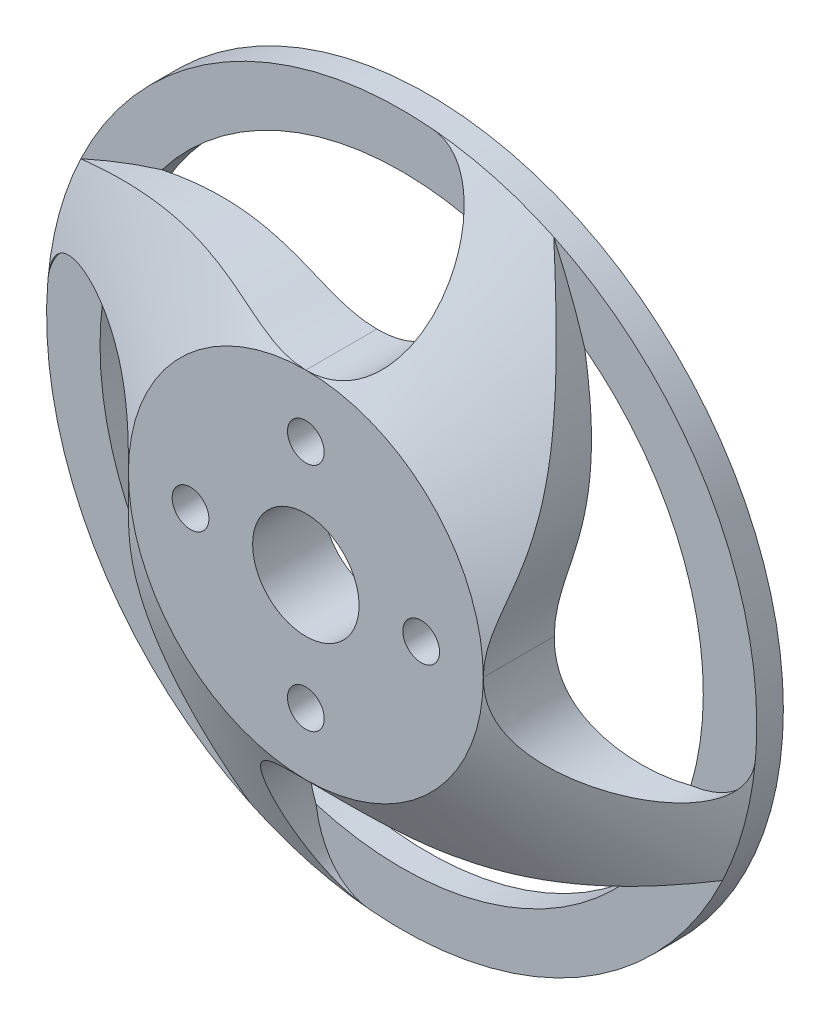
ISO-10303-21;
HEADER;
FILE_DESCRIPTION(('STEP AP214'),'2;1');
FILE_NAME('part.step','',(''),(''),'','','');
FILE_SCHEMA(('AUTOMOTIVE_DESIGN { 1 0 10303 214 1 1 1 1 }'));
ENDSEC;
DATA;
#1=APPLICATION_CONTEXT('core data for automotive mechanical design processes');
#2=APPLICATION_PROTOCOL_DEFINITION('international standard','automotive_design',2000,#1);
#3=PRODUCT_CONTEXT('',#1,'mechanical');
#4=PRODUCT('Part','Part','',(#3));
#5=PRODUCT_RELATED_PRODUCT_CATEGORY('part','',(#4));
#6=PRODUCT_DEFINITION_FORMATION('','',#4);
#7=PRODUCT_DEFINITION_CONTEXT('part definition',#1,'design');
#8=PRODUCT_DEFINITION('design','',#6,#7);
#9=PRODUCT_DEFINITION_SHAPE('','',#8);
#10=(LENGTH_UNIT() NAMED_UNIT(*) SI_UNIT(.MILLI.,.METRE.));
#11=(NAMED_UNIT(*) PLANE_ANGLE_UNIT() SI_UNIT($,.RADIAN.));
#12=(NAMED_UNIT(*) SI_UNIT($,.STERADIAN.) SOLID_ANGLE_UNIT());
#13=UNCERTAINTY_MEASURE_WITH_UNIT(LENGTH_MEASURE(1.E-05),#10,'distance_accuracy_value','');
#14=(GEOMETRIC_REPRESENTATION_CONTEXT(3) GLOBAL_UNCERTAINTY_ASSIGNED_CONTEXT((#13)) GLOBAL_UNIT_ASSIGNED_CONTEXT((#10,
#11,#12)) REPRESENTATION_CONTEXT('',''));
#15=CARTESIAN_POINT('',(0.,0.,0.));
#16=DIRECTION('',(0.,0.,1.));
#17=DIRECTION('',(1.,0.,0.));
#18=AXIS2_PLACEMENT_3D('',#15,#16,#17);
#19=CARTESIAN_POINT('',(13.,0.,13.8));
#20=DIRECTION('',(0.,0.,-1.));
#21=DIRECTION('',(-1.,0.,0.));
#22=AXIS2_PLACEMENT_3D('',#19,#20,#21);
#23=CYLINDRICAL_SURFACE('',#22,2.0701);
#24=CARTESIAN_POINT('',(13.,0.,13.8));
#25=DIRECTION('',(0.,0.,-1.));
#26=DIRECTION('',(-1.,0.,0.));
#27=AXIS2_PLACEMENT_3D('',#24,#25,#26);
#28=CIRCLE('',#27,2.0701);
#29=CARTESIAN_POINT('',(10.9299,0.,13.8));
#30=VERTEX_POINT('',#29);
#31=EDGE_CURVE('E24',#30,#30,#28,.T.);
#32=ORIENTED_EDGE('',*,*,#31,.F.);
#33=EDGE_LOOP('',(#32));
#34=FACE_BOUND('',#33,.T.);
#35=CARTESIAN_POINT('',(13.,0.,5.80000000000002));
#36=DIRECTION('',(0.,0.,-1.));
#37=DIRECTION('',(-1.,0.,0.));
#38=AXIS2_PLACEMENT_3D('',#35,#36,#37);
#39=CIRCLE('',#38,2.0701);
#40=CARTESIAN_POINT('',(10.9299,0.,5.80000000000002));
#41=VERTEX_POINT('',#40);
#42=EDGE_CURVE('E500',#41,#41,#39,.T.);
#43=ORIENTED_EDGE('',*,*,#42,.T.);
#44=EDGE_LOOP('',(#43));
#45=FACE_BOUND('',#44,.T.);
#46=ADVANCED_FACE('F17',(#34,#45),#23,.F.);
#47=CARTESIAN_POINT('',(0.,-13.,13.8));
#48=DIRECTION('',(0.,0.,-1.));
#49=DIRECTION('',(-1.,0.,0.));
#50=AXIS2_PLACEMENT_3D('',#47,#48,#49);
#51=CYLINDRICAL_SURFACE('',#50,2.0701);
#52=CARTESIAN_POINT('',(0.,-13.,13.8));
#53=DIRECTION('',(0.,0.,-1.));
#54=DIRECTION('',(-1.,0.,0.));
#55=AXIS2_PLACEMENT_3D('',#52,#53,#54);
#56=CIRCLE('',#55,2.0701);
#57=CARTESIAN_POINT('',(-2.0701,-13.,13.8));
#58=VERTEX_POINT('',#57);
#59=EDGE_CURVE('E515',#58,#58,#56,.T.);
#60=ORIENTED_EDGE('',*,*,#59,.F.);
#61=EDGE_LOOP('',(#60));
#62=FACE_BOUND('',#61,.T.);
#63=CARTESIAN_POINT('',(0.,-13.,5.80000000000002));
#64=DIRECTION('',(0.,0.,-1.));
#65=DIRECTION('',(-1.,0.,0.));
#66=AXIS2_PLACEMENT_3D('',#63,#64,#65);
#67=CIRCLE('',#66,2.0701);
#68=CARTESIAN_POINT('',(-2.0701,-13.,5.80000000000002));
#69=VERTEX_POINT('',#68);
#70=EDGE_CURVE('E526',#69,#69,#67,.T.);
#71=ORIENTED_EDGE('',*,*,#70,.T.);
#72=EDGE_LOOP('',(#71));
#73=FACE_BOUND('',#72,.T.);
#74=ADVANCED_FACE('F192',(#62,#73),#51,.F.);
#75=CARTESIAN_POINT('',(-13.,0.,13.8));
#76=DIRECTION('',(0.,0.,-1.));
#77=DIRECTION('',(-1.,0.,0.));
#78=AXIS2_PLACEMENT_3D('',#75,#76,#77);
#79=CYLINDRICAL_SURFACE('',#78,2.0701);
#80=CARTESIAN_POINT('',(-13.,0.,13.8));
#81=DIRECTION('',(0.,0.,-1.));
#82=DIRECTION('',(-1.,0.,0.));
#83=AXIS2_PLACEMENT_3D('',#80,#81,#82);
#84=CIRCLE('',#83,2.0701);
#85=CARTESIAN_POINT('',(-15.0701,0.,13.8));
#86=VERTEX_POINT('',#85);
#87=EDGE_CURVE('E509',#86,#86,#84,.T.);
#88=ORIENTED_EDGE('',*,*,#87,.F.);
#89=EDGE_LOOP('',(#88));
#90=FACE_BOUND('',#89,.T.);
#91=CARTESIAN_POINT('',(-13.,0.,5.80000000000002));
#92=DIRECTION('',(0.,0.,-1.));
#93=DIRECTION('',(-1.,0.,0.));
#94=AXIS2_PLACEMENT_3D('',#91,#92,#93);
#95=CIRCLE('',#94,2.0701);
#96=CARTESIAN_POINT('',(-15.0701,0.,5.80000000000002));
#97=VERTEX_POINT('',#96);
#98=EDGE_CURVE('E528',#97,#97,#95,.T.);
#99=ORIENTED_EDGE('',*,*,#98,.T.);
#100=EDGE_LOOP('',(#99));
#101=FACE_BOUND('',#100,.T.);
#102=ADVANCED_FACE('F196',(#90,#101),#79,.F.);
#103=CARTESIAN_POINT('',(0.,13.,13.8));
#104=DIRECTION('',(0.,0.,-1.));
#105=DIRECTION('',(-1.,0.,0.));
#106=AXIS2_PLACEMENT_3D('',#103,#104,#105);
#107=CYLINDRICAL_SURFACE('',#106,2.0701);
#108=CARTESIAN_POINT('',(0.,13.,13.8));
#109=DIRECTION('',(0.,0.,-1.));
#110=DIRECTION('',(-1.,0.,0.));
#111=AXIS2_PLACEMENT_3D('',#108,#109,#110);
#112=CIRCLE('',#111,2.0701);
#113=CARTESIAN_POINT('',(-2.0701,13.,13.8));
#114=VERTEX_POINT('',#113);
#115=EDGE_CURVE('E505',#114,#114,#112,.T.);
#116=ORIENTED_EDGE('',*,*,#115,.F.);
#117=EDGE_LOOP('',(#116));
#118=FACE_BOUND('',#117,.T.);
#119=CARTESIAN_POINT('',(0.,13.,5.80000000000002));
#120=DIRECTION('',(0.,0.,-1.));
#121=DIRECTION('',(-1.,0.,0.));
#122=AXIS2_PLACEMENT_3D('',#119,#120,#121);
#123=CIRCLE('',#122,2.0701);
#124=CARTESIAN_POINT('',(-2.0701,13.,5.80000000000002));
#125=VERTEX_POINT('',#124);
#126=EDGE_CURVE('E532',#125,#125,#123,.T.);
#127=ORIENTED_EDGE('',*,*,#126,.T.);
#128=EDGE_LOOP('',(#127));
#129=FACE_BOUND('',#128,.T.);
#130=ADVANCED_FACE('F200',(#118,#129),#107,.F.);
#131=CARTESIAN_POINT('',(0.,0.,13.8));
#132=DIRECTION('',(0.,0.,-1.));
#133=DIRECTION('',(-1.,0.,0.));
#134=AXIS2_PLACEMENT_3D('',#131,#132,#133);
#135=CYLINDRICAL_SURFACE('',#134,6.);
#136=CARTESIAN_POINT('',(0.,0.,13.8));
#137=DIRECTION('',(0.,0.,-1.));
#138=DIRECTION('',(-1.,0.,0.));
#139=AXIS2_PLACEMENT_3D('',#136,#137,#138);
#140=CIRCLE('',#139,6.);
#141=CARTESIAN_POINT('',(-6.,0.,13.8));
#142=VERTEX_POINT('',#141);
#143=EDGE_CURVE('E503',#142,#142,#140,.T.);
#144=ORIENTED_EDGE('',*,*,#143,.F.);
#145=EDGE_LOOP('',(#144));
#146=FACE_BOUND('',#145,.T.);
#147=CARTESIAN_POINT('',(0.,0.,5.80000000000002));
#148=DIRECTION('',(0.,0.,-1.));
#149=DIRECTION('',(-1.,0.,0.));
#150=AXIS2_PLACEMENT_3D('',#147,#148,#149);
#151=CIRCLE('',#150,6.);
#152=CARTESIAN_POINT('',(-6.,0.,5.80000000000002));
#153=VERTEX_POINT('',#152);
#154=EDGE_CURVE('E119',#153,#153,#151,.T.);
#155=ORIENTED_EDGE('',*,*,#154,.T.);
#156=EDGE_LOOP('',(#155));
#157=FACE_BOUND('',#156,.T.);
#158=ADVANCED_FACE('F188',(#146,#157),#135,.F.);
#159=CARTESIAN_POINT('',(0.,10.,13.8));
#160=DIRECTION('',(0.,0.,1.));
#161=DIRECTION('',(1.,0.,0.));
#162=AXIS2_PLACEMENT_3D('',#159,#160,#161);
#163=PLANE('',#162);
#164=ORIENTED_EDGE('',*,*,#143,.T.);
#165=EDGE_LOOP('',(#164));
#166=FACE_BOUND('',#165,.T.);
#167=ORIENTED_EDGE('',*,*,#115,.T.);
#168=EDGE_LOOP('',(#167));
#169=FACE_BOUND('',#168,.T.);
#170=ORIENTED_EDGE('',*,*,#87,.T.);
#171=EDGE_LOOP('',(#170));
#172=FACE_BOUND('',#171,.T.);
#173=ORIENTED_EDGE('',*,*,#59,.T.);
#174=EDGE_LOOP('',(#173));
#175=FACE_BOUND('',#174,.T.);
#176=ORIENTED_EDGE('',*,*,#31,.T.);
#177=EDGE_LOOP('',(#176));
#178=FACE_BOUND('',#177,.T.);
#179=CARTESIAN_POINT('',(0.,0.,13.8000000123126));
#180=DIRECTION('',(0.,0.,-1.));
#181=DIRECTION('',(-1.,0.,0.));
#182=AXIS2_PLACEMENT_3D('',#179,#180,#181);
#183=CIRCLE('',#182,20.0000000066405);
#184=CARTESIAN_POINT('',(0.,-20.0000000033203,13.8000000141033));
#185=VERTEX_POINT('',#184);
#186=CARTESIAN_POINT('',(-20.0000000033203,0.,13.8000000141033));
#187=VERTEX_POINT('',#186);
#188=EDGE_CURVE('E150',#185,#187,#183,.T.);
#189=ORIENTED_EDGE('',*,*,#188,.F.);
#190=CARTESIAN_POINT('',(0.,0.,13.8000000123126));
#191=DIRECTION('',(0.,0.,-1.));
#192=DIRECTION('',(-1.,0.,0.));
#193=AXIS2_PLACEMENT_3D('',#190,#191,#192);
#194=CIRCLE('',#193,20.0000000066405);
#195=CARTESIAN_POINT('',(20.0000000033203,0.,13.8000000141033));
#196=VERTEX_POINT('',#195);
#197=EDGE_CURVE('E137',#196,#185,#194,.T.);
#198=ORIENTED_EDGE('',*,*,#197,.F.);
#199=CARTESIAN_POINT('',(0.,0.,13.8000000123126));
#200=DIRECTION('',(0.,0.,-1.));
#201=DIRECTION('',(-1.,0.,0.));
#202=AXIS2_PLACEMENT_3D('',#199,#200,#201);
#203=CIRCLE('',#202,20.0000000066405);
#204=CARTESIAN_POINT('',(0.,20.0000000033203,13.8000000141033));
#205=VERTEX_POINT('',#204);
#206=EDGE_CURVE('E141',#205,#196,#203,.T.);
#207=ORIENTED_EDGE('',*,*,#206,.F.);
#208=CARTESIAN_POINT('',(0.,0.,13.8000000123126));
#209=DIRECTION('',(0.,0.,-1.));
#210=DIRECTION('',(-1.,0.,0.));
#211=AXIS2_PLACEMENT_3D('',#208,#209,#210);
#212=CIRCLE('',#211,20.0000000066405);
#213=EDGE_CURVE('E469',#187,#205,#212,.T.);
#214=ORIENTED_EDGE('',*,*,#213,.F.);
#215=EDGE_LOOP('',(#189,#198,#207,#214));
#216=FACE_BOUND('',#215,.T.);
#217=ADVANCED_FACE('F146',(#166,#169,#172,#175,#178,#216),#163,.T.);
#218=CARTESIAN_POINT('',(39.8737026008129,-3.47684712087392,13.8));
#219=CARTESIAN_POINT('',(39.8737026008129,-3.47684712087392,2.99999999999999));
#220=CARTESIAN_POINT('',(39.1151440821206,-12.1762623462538,13.8));
#221=CARTESIAN_POINT('',(39.1151440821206,-12.1762623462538,2.99999999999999));
#222=CARTESIAN_POINT('',(23.3071402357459,-11.9461481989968,13.8));
#223=CARTESIAN_POINT('',(23.3071402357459,-11.9461481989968,2.99999999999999));
#224=CARTESIAN_POINT('',(20.,-6.44263196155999,13.8));
#225=CARTESIAN_POINT('',(20.,-6.44263196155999,2.99999999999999));
#226=CARTESIAN_POINT('',(20.,0.,13.8));
#227=CARTESIAN_POINT('',(20.,0.,2.99999999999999));
#228=B_SPLINE_SURFACE_WITH_KNOTS('',4,1,((#218,#219),(#220,#221),(#222,#223),(#224,#225),(#226,
#227)),.UNSPECIFIED.,.F.,.F.,.F.,(5,5),(2,2),(-1.,0.),(0.,1.08),.UNSPECIFIED.);
#229=CARTESIAN_POINT('',(32.6005947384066,-9.65407803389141,2.99999999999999));
#230=CARTESIAN_POINT('',(32.7344219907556,-9.63560777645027,2.99999999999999));
#231=CARTESIAN_POINT('',(32.8679605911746,-9.61509893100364,2.99999999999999));
#232=CARTESIAN_POINT('',(33.1343392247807,-9.56990482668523,2.99999999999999));
#233=CARTESIAN_POINT('',(33.2671792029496,-9.54521924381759,2.99999999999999));
#234=CARTESIAN_POINT('',(33.6647702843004,-9.46468600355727,2.99999999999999));
#235=CARTESIAN_POINT('',(33.9282562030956,-9.40240767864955,2.99999999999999));
#236=CARTESIAN_POINT('',(34.4532748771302,-9.25898546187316,2.99999999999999));
#237=CARTESIAN_POINT('',(34.7147513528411,-9.17763509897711,2.99999999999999));
#238=CARTESIAN_POINT('',(35.230687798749,-8.99531375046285,2.99999999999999));
#239=CARTESIAN_POINT('',(35.4851516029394,-8.89435373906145,2.99999999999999));
#240=CARTESIAN_POINT('',(35.9260004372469,-8.69766571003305,2.99999999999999));
#241=CARTESIAN_POINT('',(36.1143286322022,-8.60628580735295,2.99999999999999));
#242=CARTESIAN_POINT('',(36.4842450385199,-8.4105882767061,2.99999999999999));
#243=CARTESIAN_POINT('',(36.6658314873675,-8.30626729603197,2.99999999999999));
#244=CARTESIAN_POINT('',(37.0199761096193,-8.08450832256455,2.99999999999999));
#245=CARTESIAN_POINT('',(37.1925631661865,-7.96711664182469,2.99999999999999));
#246=CARTESIAN_POINT('',(37.5273997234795,-7.71853348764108,2.99999999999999));
#247=CARTESIAN_POINT('',(37.6896555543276,-7.58735059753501,2.99999999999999));
#248=CARTESIAN_POINT('',(37.9744772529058,-7.33511158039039,2.99999999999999));
#249=CARTESIAN_POINT('',(38.0990241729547,-7.21629153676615,2.99999999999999));
#250=CARTESIAN_POINT('',(38.3383104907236,-6.96922996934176,2.99999999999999));
#251=CARTESIAN_POINT('',(38.4530546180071,-6.84099304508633,2.99999999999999));
#252=CARTESIAN_POINT('',(38.671467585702,-6.5753666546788,2.99999999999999));
#253=CARTESIAN_POINT('',(38.7751353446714,-6.43797629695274,2.99999999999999));
#254=CARTESIAN_POINT('',(38.9701059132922,-6.15467292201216,2.99999999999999));
#255=CARTESIAN_POINT('',(39.0614091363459,-6.00876018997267,2.99999999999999));
#256=CARTESIAN_POINT('',(39.2309574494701,-5.70861549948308,2.99999999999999));
#257=CARTESIAN_POINT('',(39.3091389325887,-5.55434755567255,2.99999999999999));
#258=CARTESIAN_POINT('',(39.4511140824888,-5.23930069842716,2.99999999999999));
#259=CARTESIAN_POINT('',(39.5149059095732,-5.07852095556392,2.99999999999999));
#260=CARTESIAN_POINT('',(39.6276226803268,-4.75198031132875,2.99999999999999));
#261=CARTESIAN_POINT('',(39.6765585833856,-4.58622318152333,2.99999999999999));
#262=CARTESIAN_POINT('',(39.7596072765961,-4.25111572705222,2.99999999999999));
#263=CARTESIAN_POINT('',(39.7937274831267,-4.08176724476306,2.99999999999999));
#264=CARTESIAN_POINT('',(39.8320389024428,-3.83918520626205,2.99999999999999));
#265=CARTESIAN_POINT('',(39.8421429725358,-3.76683822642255,2.99999999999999));
#266=CARTESIAN_POINT('',(39.8598059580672,-3.62198097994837,2.99999999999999));
#267=CARTESIAN_POINT('',(39.8673699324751,-3.54947133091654,2.99999999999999));
#268=CARTESIAN_POINT('',(39.8737026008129,-3.47684712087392,2.99999999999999));
#269=B_SPLINE_CURVE_WITH_KNOTS('',3,(#229,#230,#231,#232,#233,#234,#235,#236,#237,#238,#239,
#240,#241,#242,#243,#244,#245,#246,#247,#248,#249,#250,#251,#252,#253,#254,#255,#256,#257,#258,
#259,#260,#261,#262,#263,#264,#265,#266,#267,#268),.UNSPECIFIED.,.F.,.F.,(4,2,2,2,2,2,2,2,2,2,2,
2,2,2,2,2,2,2,2,4),(0.,0.405255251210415,0.810541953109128,1.62213182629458,2.44295043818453,
3.26331100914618,3.89084571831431,4.51854334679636,5.14408373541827,5.76923708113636,
6.28514961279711,6.80081180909,7.31652430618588,7.83221955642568,8.35034660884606,
8.86853986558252,9.38634991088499,9.90390045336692,10.1230127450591,10.3416860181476),.UNSPECIFIED.);
#270=CARTESIAN_POINT('',(32.6005947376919,-9.65407803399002,2.99999999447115));
#271=VERTEX_POINT('',#270);
#272=CARTESIAN_POINT('',(39.8737026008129,-3.47684712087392,2.99999999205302));
#273=VERTEX_POINT('',#272);
#274=EDGE_CURVE('E225',#271,#273,#269,.T.);
#275=CARTESIAN_POINT('',(32.600594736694,-9.65407803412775,2.9999999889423));
#276=CARTESIAN_POINT('',(32.3380291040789,-9.6902743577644,3.04829499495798));
#277=CARTESIAN_POINT('',(32.0745118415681,-9.7186546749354,3.09711335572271));
#278=CARTESIAN_POINT('',(31.5463742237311,-9.76016374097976,3.19568329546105));
#279=CARTESIAN_POINT('',(31.2817535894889,-9.77328836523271,3.24543512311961));
#280=CARTESIAN_POINT('',(30.7522993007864,-9.78464846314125,3.34574229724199));
#281=CARTESIAN_POINT('',(30.48746561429,-9.78288095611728,3.39629780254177));
#282=CARTESIAN_POINT('',(29.9561777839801,-9.7645171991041,3.49853031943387));
#283=CARTESIAN_POINT('',(29.6897291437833,-9.74779430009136,3.55021322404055));
#284=CARTESIAN_POINT('',(29.1583388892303,-9.6993367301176,3.65416492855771));
#285=CARTESIAN_POINT('',(28.8933971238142,-9.66760359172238,3.70643366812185));
#286=CARTESIAN_POINT('',(28.3659188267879,-9.58895588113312,3.81144010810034));
#287=CARTESIAN_POINT('',(28.103381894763,-9.54204388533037,3.8641777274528));
#288=CARTESIAN_POINT('',(27.5275777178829,-9.42138316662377,3.98096764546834));
#289=CARTESIAN_POINT('',(27.2150599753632,-9.34408921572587,4.0451021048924));
#290=CARTESIAN_POINT('',(26.59681866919,-9.16605635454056,4.1736083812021));
#291=CARTESIAN_POINT('',(26.2910946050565,-9.06531917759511,4.23798018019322));
#292=CARTESIAN_POINT('',(25.6895958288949,-8.83961507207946,4.36642279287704));
#293=CARTESIAN_POINT('',(25.3937962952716,-8.7147148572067,4.43049394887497));
#294=CARTESIAN_POINT('',(24.8142064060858,-8.43931665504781,4.55799469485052));
#295=CARTESIAN_POINT('',(24.5304127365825,-8.28882578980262,4.62142445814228));
#296=CARTESIAN_POINT('',(24.0453773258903,-8.00092601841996,4.73169683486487));
#297=CARTESIAN_POINT('',(23.8408166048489,-7.86920651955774,4.77882892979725));
#298=CARTESIAN_POINT('',(23.4424042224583,-7.59012381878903,4.87191207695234));
#299=CARTESIAN_POINT('',(23.2485496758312,-7.44276486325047,4.91786344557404));
#300=CARTESIAN_POINT('',(22.8736394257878,-7.1324088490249,5.00806396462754));
#301=CARTESIAN_POINT('',(22.6925719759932,-6.9694264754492,5.05231465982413));
#302=CARTESIAN_POINT('',(22.3450823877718,-6.62794549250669,5.13858585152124));
#303=CARTESIAN_POINT('',(22.1786603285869,-6.44944679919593,5.18060633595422));
#304=CARTESIAN_POINT('',(21.8613541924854,-6.07634958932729,5.26206119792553));
#305=CARTESIAN_POINT('',(21.7105859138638,-5.88164797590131,5.30147561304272));
#306=CARTESIAN_POINT('',(21.4276742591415,-5.47850362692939,5.3767251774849));
#307=CARTESIAN_POINT('',(21.2955301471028,-5.27006143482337,5.41256046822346));
#308=CARTESIAN_POINT('',(21.0510705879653,-4.84116921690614,5.48003676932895));
#309=CARTESIAN_POINT('',(20.9387585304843,-4.62071714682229,5.51167706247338));
#310=CARTESIAN_POINT('',(20.7345084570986,-4.16998836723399,5.57025349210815));
#311=CARTESIAN_POINT('',(20.6425715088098,-3.93971114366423,5.59718938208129));
#312=CARTESIAN_POINT('',(20.4692863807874,-3.44438277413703,5.64886764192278));
#313=CARTESIAN_POINT('',(20.3904139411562,-3.17840252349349,5.67299037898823));
#314=CARTESIAN_POINT('',(20.2563013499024,-2.64006822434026,5.71479906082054));
#315=CARTESIAN_POINT('',(20.2010674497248,-2.36771250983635,5.73248330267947));
#316=CARTESIAN_POINT('',(20.111924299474,-1.81914263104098,5.76155086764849));
#317=CARTESIAN_POINT('',(20.0780258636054,-1.54292658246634,5.77293099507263));
#318=CARTESIAN_POINT('',(20.0287691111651,-0.988683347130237,5.78974596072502));
#319=CARTESIAN_POINT('',(20.0134129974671,-0.710655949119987,5.7951800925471));
#320=CARTESIAN_POINT('',(20.0038317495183,-0.360336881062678,5.79861070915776));
#321=CARTESIAN_POINT('',(20.0023798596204,-0.288197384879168,5.79913488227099));
#322=CARTESIAN_POINT('',(20.0004650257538,-0.144039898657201,5.79982913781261));
#323=CARTESIAN_POINT('',(20.0000002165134,-0.0720219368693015,5.79999988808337));
#324=CARTESIAN_POINT('',(20.,0.,5.8000000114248));
#325=B_SPLINE_CURVE_WITH_KNOTS('',3,(#275,#276,#277,#278,#279,#280,#281,#282,#283,#284,#285,
#286,#287,#288,#289,#290,#291,#292,#293,#294,#295,#296,#297,#298,#299,#300,#301,#302,#303,#304,
#305,#306,#307,#308,#309,#310,#311,#312,#313,#314,#315,#316,#317,#318,#319,#320,#321,#322,#323,
#324),.UNSPECIFIED.,.F.,.F.,(4,2,2,2,2,2,2,2,2,2,2,2,2,2,2,2,2,2,2,2,2,2,2,2,4),(0.,
0.808080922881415,1.61638027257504,2.4248414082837,3.24021447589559,4.05550431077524,
4.87065583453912,5.85456105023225,6.83839354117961,7.81954748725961,8.80042881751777,
9.54325038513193,10.2858707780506,11.0277998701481,11.7697329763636,12.5168129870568,
13.2638634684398,14.0110415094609,14.7582586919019,15.5923948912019,16.4267515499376,
17.2615307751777,18.0964091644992,18.312874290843,18.5289300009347),.UNSPECIFIED.);
#326=CARTESIAN_POINT('',(20.0000000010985,0.,5.80000001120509));
#327=VERTEX_POINT('',#326);
#328=EDGE_CURVE('E114',#271,#327,#325,.T.);
#329=DIRECTION('',(0.,0.,1.));
#330=VECTOR('',#329,1.);
#331=CARTESIAN_POINT('',(20.,0.,8.39999999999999));
#332=LINE('',#331,#330);
#333=EDGE_CURVE('E107',#327,#196,#332,.T.);
#334=CARTESIAN_POINT('',(39.8737026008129,-3.47684712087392,2.99999998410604));
#335=CARTESIAN_POINT('',(39.8647382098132,-3.57974985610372,2.99999629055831));
#336=CARTESIAN_POINT('',(39.8532840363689,-3.6824460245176,3.00112277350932));
#337=CARTESIAN_POINT('',(39.8252856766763,-3.88713130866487,3.00571456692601));
#338=CARTESIAN_POINT('',(39.8087393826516,-3.98912011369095,3.00918084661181));
#339=CARTESIAN_POINT('',(39.7704522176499,-4.19201816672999,3.01853117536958));
#340=CARTESIAN_POINT('',(39.7487109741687,-4.29292733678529,3.0244153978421));
#341=CARTESIAN_POINT('',(39.700124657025,-4.49279129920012,3.03861199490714));
#342=CARTESIAN_POINT('',(39.6733060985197,-4.59175342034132,3.04691187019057));
#343=CARTESIAN_POINT('',(39.6145220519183,-4.78788220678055,3.06596939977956));
#344=CARTESIAN_POINT('',(39.5825573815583,-4.88504915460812,3.07672666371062));
#345=CARTESIAN_POINT('',(39.5135737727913,-5.07724787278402,3.10068618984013));
#346=CARTESIAN_POINT('',(39.4765552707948,-5.17227982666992,3.1138882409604));
#347=CARTESIAN_POINT('',(39.3777431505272,-5.407094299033,3.14994920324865));
#348=CARTESIAN_POINT('',(39.3128503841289,-5.54535579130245,3.17432623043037));
#349=CARTESIAN_POINT('',(39.1726473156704,-5.81550015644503,3.22828971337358));
#350=CARTESIAN_POINT('',(39.0973311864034,-5.94737940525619,3.25787908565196));
#351=CARTESIAN_POINT('',(38.9372176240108,-6.20402273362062,3.32190723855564));
#352=CARTESIAN_POINT('',(38.8524191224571,-6.32878600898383,3.35634656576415));
#353=CARTESIAN_POINT('',(38.6743664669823,-6.5707625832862,3.42965294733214));
#354=CARTESIAN_POINT('',(38.5811101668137,-6.68797395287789,3.46852112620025));
#355=CARTESIAN_POINT('',(38.3565181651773,-6.95047849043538,3.56316219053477));
#356=CARTESIAN_POINT('',(38.2224663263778,-7.09293077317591,3.62039399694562));
#357=CARTESIAN_POINT('',(37.9438433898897,-7.36437311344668,3.74072632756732));
#358=CARTESIAN_POINT('',(37.799268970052,-7.49335888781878,3.80382870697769));
#359=CARTESIAN_POINT('',(37.3521913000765,-7.86125324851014,4.00082677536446));
#360=CARTESIAN_POINT('',(37.0367508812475,-8.08062846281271,4.14223718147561));
#361=CARTESIAN_POINT('',(36.4602411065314,-8.42688502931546,4.40447908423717));
#362=CARTESIAN_POINT('',(36.2034605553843,-8.56342479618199,4.52251052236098));
#363=CARTESIAN_POINT('',(35.6808686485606,-8.81159173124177,4.76502336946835));
#364=CARTESIAN_POINT('',(35.4150525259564,-8.92320550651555,4.88950820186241));
#365=CARTESIAN_POINT('',(34.8770723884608,-9.12386261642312,5.14362873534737));
#366=CARTESIAN_POINT('',(34.6049006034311,-9.21287655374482,5.27327089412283));
#367=CARTESIAN_POINT('',(34.0566069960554,-9.3701156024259,5.53655523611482));
#368=CARTESIAN_POINT('',(33.7804853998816,-9.43834189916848,5.67019719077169));
#369=CARTESIAN_POINT('',(33.0850744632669,-9.58534303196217,6.00941315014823));
#370=CARTESIAN_POINT('',(32.6642066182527,-9.6519152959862,6.21708987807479));
#371=CARTESIAN_POINT('',(31.8208362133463,-9.74522161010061,6.63816577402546));
#372=CARTESIAN_POINT('',(31.3983329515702,-9.77193606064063,6.85156770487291));
#373=CARTESIAN_POINT('',(30.5539381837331,-9.78763752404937,7.28329263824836));
#374=CARTESIAN_POINT('',(30.1320503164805,-9.77653767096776,7.50162582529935));
#375=CARTESIAN_POINT('',(29.2927861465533,-9.71725242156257,7.94167888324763));
#376=CARTESIAN_POINT('',(28.8754089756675,-9.66907429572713,8.16339808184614));
#377=CARTESIAN_POINT('',(28.0391322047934,-9.53385771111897,8.61407098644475));
#378=CARTESIAN_POINT('',(27.6203906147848,-9.44601094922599,8.84307804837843));
#379=CARTESIAN_POINT('',(26.7940465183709,-9.22970636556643,9.30248140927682));
#380=CARTESIAN_POINT('',(26.3864480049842,-9.10123418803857,9.53287817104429));
#381=CARTESIAN_POINT('',(25.5885558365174,-8.80156571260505,9.99238198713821));
#382=CARTESIAN_POINT('',(25.198199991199,-8.63054078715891,10.2214905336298));
#383=CARTESIAN_POINT('',(24.6292877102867,-8.3393170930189,10.5625387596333));
#384=CARTESIAN_POINT('',(24.4424828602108,-8.23650342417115,10.6757466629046));
#385=CARTESIAN_POINT('',(24.0751904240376,-8.01874923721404,10.9008850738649));
#386=CARTESIAN_POINT('',(23.894703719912,-7.90380703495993,11.0128154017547));
#387=CARTESIAN_POINT('',(23.5275071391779,-7.65196094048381,11.2433306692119));
#388=CARTESIAN_POINT('',(23.3413910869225,-7.51404691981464,11.3617629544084));
#389=CARTESIAN_POINT('',(22.9793434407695,-7.2230695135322,11.5954129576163));
#390=CARTESIAN_POINT('',(22.8034082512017,-7.07001152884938,11.7106318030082));
#391=CARTESIAN_POINT('',(22.4634746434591,-6.74838503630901,11.936623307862));
#392=CARTESIAN_POINT('',(22.2994678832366,-6.57982755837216,12.0473990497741));
#393=CARTESIAN_POINT('',(21.9850969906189,-6.22693415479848,12.2631471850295));
#394=CARTESIAN_POINT('',(21.834733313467,-6.04259770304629,12.3681193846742));
#395=CARTESIAN_POINT('',(21.5479737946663,-5.65626148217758,12.5716977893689));
#396=CARTESIAN_POINT('',(21.4117503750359,-5.45408926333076,12.6702209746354));
#397=CARTESIAN_POINT('',(21.1570282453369,-5.03467687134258,12.8577250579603));
#398=CARTESIAN_POINT('',(21.0385288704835,-4.81743726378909,12.9467063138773));
#399=CARTESIAN_POINT('',(20.82080448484,-4.36956479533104,13.1131800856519));
#400=CARTESIAN_POINT('',(20.7215626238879,-4.1389438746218,13.1906826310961));
#401=CARTESIAN_POINT('',(20.543057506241,-3.66626893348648,13.3326547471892));
#402=CARTESIAN_POINT('',(20.4637915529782,-3.42421646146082,13.3971260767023));
#403=CARTESIAN_POINT('',(20.3346652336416,-2.9649063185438,13.5040751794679));
#404=CARTESIAN_POINT('',(20.2822685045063,-2.74877097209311,13.5483534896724));
#405=CARTESIAN_POINT('',(20.1917901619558,-2.31162106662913,13.6260227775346));
#406=CARTESIAN_POINT('',(20.1537083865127,-2.09060656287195,13.6594138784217));
#407=CARTESIAN_POINT('',(20.0908775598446,-1.64534877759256,13.7153525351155));
#408=CARTESIAN_POINT('',(20.0661301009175,-1.42110511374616,13.737898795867));
#409=CARTESIAN_POINT('',(20.0286508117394,-0.970888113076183,13.7725360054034));
#410=CARTESIAN_POINT('',(20.0159160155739,-0.744915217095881,13.7846295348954));
#411=CARTESIAN_POINT('',(20.005543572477,-0.43219516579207,13.7945935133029));
#412=CARTESIAN_POINT('',(20.0034394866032,-0.345683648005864,13.7966351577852));
#413=CARTESIAN_POINT('',(20.0006692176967,-0.172782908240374,13.7993370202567));
#414=CARTESIAN_POINT('',(20.000000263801,-0.0863937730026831,13.7999999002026));
#415=CARTESIAN_POINT('',(20.,0.,13.800000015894));
#416=B_SPLINE_CURVE_WITH_KNOTS('',3,(#334,#335,#336,#337,#338,#339,#340,#341,#342,#343,#344,
#345,#346,#347,#348,#349,#350,#351,#352,#353,#354,#355,#356,#357,#358,#359,#360,#361,#362,#363,
#364,#365,#366,#367,#368,#369,#370,#371,#372,#373,#374,#375,#376,#377,#378,#379,#380,#381,#382,
#383,#384,#385,#386,#387,#388,#389,#390,#391,#392,#393,#394,#395,#396,#397,#398,#399,#400,#401,
#402,#403,#404,#405,#406,#407,#408,#409,#410,#411,#412,#413,#414,#415),.UNSPECIFIED.,.F.,.F.,(4,
2,2,2,2,2,2,2,2,2,2,2,2,2,2,2,2,2,2,2,2,2,2,2,2,2,2,2,2,2,2,2,2,2,2,2,2,2,2,2,4),(0.,
0.309856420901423,0.619841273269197,0.929848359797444,1.23827905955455,1.54666079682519,
1.85501592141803,2.31839250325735,2.78202919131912,3.24571817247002,3.70952515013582,
4.32000069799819,4.93066982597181,6.15394307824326,7.09442204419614,8.03540512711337,
8.97760601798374,9.91975317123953,11.3397806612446,12.7605062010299,14.1844975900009,
15.608209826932,17.0623413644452,18.5169873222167,19.9658672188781,20.6898017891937,
21.4138370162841,22.1937202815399,22.973326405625,23.7523819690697,24.5314635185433,
25.3191411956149,26.1067893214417,26.8937451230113,27.680594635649,28.3600995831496,
29.0395968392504,29.7191752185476,30.3985857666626,30.6582531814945,30.9174187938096),.UNSPECIFIED.);
#417=EDGE_CURVE('E111',#273,#196,#416,.T.);
#418=ORIENTED_EDGE('',*,*,#274,.F.);
#419=ORIENTED_EDGE('',*,*,#328,.T.);
#420=ORIENTED_EDGE('',*,*,#333,.T.);
#421=ORIENTED_EDGE('',*,*,#417,.F.);
#422=EDGE_LOOP('',(#418,#419,#420,#421));
#423=FACE_BOUND('',#422,.T.);
#424=ADVANCED_FACE('F109',(#423),#228,.F.);
#425=CARTESIAN_POINT('',(0.,-20.,13.8));
#426=CARTESIAN_POINT('',(0.,-20.,2.99999999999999));
#427=CARTESIAN_POINT('',(8.4514270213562,-20.,13.8));
#428=CARTESIAN_POINT('',(8.4514270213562,-20.,2.99999999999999));
#429=CARTESIAN_POINT('',(13.891574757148,-27.1885180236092,13.8));
#430=CARTESIAN_POINT('',(13.891574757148,-27.1885180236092,2.99999999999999));
#431=CARTESIAN_POINT('',(36.1670102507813,-17.1449116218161,13.8));
#432=CARTESIAN_POINT('',(36.1670102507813,-17.1449116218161,2.99999999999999));
#433=B_SPLINE_SURFACE_WITH_KNOTS('',3,1,((#425,#426),(#427,#428),(#429,#430),(#431,#432)),
.UNSPECIFIED.,.F.,.F.,.F.,(4,4),(2,2),(-1.,0.),(0.,1.08),.UNSPECIFIED.);
#434=DIRECTION('',(0.,0.,-1.));
#435=VECTOR('',#434,1.);
#436=CARTESIAN_POINT('',(0.,-20.,8.39999999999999));
#437=LINE('',#436,#435);
#438=CARTESIAN_POINT('',(0.,-20.0000000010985,5.80000001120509));
#439=VERTEX_POINT('',#438);
#440=EDGE_CURVE('E280',#185,#439,#437,.T.);
#441=CARTESIAN_POINT('',(0.,-20.,5.8000000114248));
#442=CARTESIAN_POINT('',(0.211357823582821,-19.9999634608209,5.80001135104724));
#443=CARTESIAN_POINT('',(0.422690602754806,-20.0044946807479,5.79843108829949));
#444=CARTESIAN_POINT('',(0.843502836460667,-20.0220792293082,5.79224971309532));
#445=CARTESIAN_POINT('',(1.0529850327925,-20.0350736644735,5.7876694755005));
#446=CARTESIAN_POINT('',(1.4702533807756,-20.0689084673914,5.77567424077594));
#447=CARTESIAN_POINT('',(1.67804290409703,-20.0897125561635,5.76827234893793));
#448=CARTESIAN_POINT('',(2.09211659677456,-20.1383533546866,5.75085794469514));
#449=CARTESIAN_POINT('',(2.29840330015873,-20.1661712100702,5.74085242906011));
#450=CARTESIAN_POINT('',(2.70966805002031,-20.2279726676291,5.71846546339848));
#451=CARTESIAN_POINT('',(2.91464732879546,-20.261949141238,5.70608675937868));
#452=CARTESIAN_POINT('',(3.32350325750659,-20.3351466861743,5.67919789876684));
#453=CARTESIAN_POINT('',(3.52737998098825,-20.3743674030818,5.66468788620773));
#454=CARTESIAN_POINT('',(3.93667830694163,-20.4575981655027,5.63359767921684));
#455=CARTESIAN_POINT('',(4.14208699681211,-20.5016623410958,5.61699369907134));
#456=CARTESIAN_POINT('',(4.55220671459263,-20.5931908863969,5.58210707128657));
#457=CARTESIAN_POINT('',(4.75691687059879,-20.6406585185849,5.5638228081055));
#458=CARTESIAN_POINT('',(5.16585755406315,-20.7380088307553,5.52581749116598));
#459=CARTESIAN_POINT('',(5.37008733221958,-20.7878940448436,5.5060949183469));
#460=CARTESIAN_POINT('',(5.77827629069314,-20.8891248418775,5.46544077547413));
#461=CARTESIAN_POINT('',(5.98223500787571,-20.9404718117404,5.44450803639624));
#462=CARTESIAN_POINT('',(6.3900779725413,-21.04371780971,5.40164412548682));
#463=CARTESIAN_POINT('',(6.59396203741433,-21.0956172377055,5.37971218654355));
#464=CARTESIAN_POINT('',(7.00183302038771,-21.1991233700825,5.33503999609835));
#465=CARTESIAN_POINT('',(7.20581993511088,-21.2507299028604,5.31229931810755));
#466=CARTESIAN_POINT('',(7.74268807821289,-21.385047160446,5.25165065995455));
#467=CARTESIAN_POINT('',(8.07573976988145,-21.4668522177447,5.21322048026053));
#468=CARTESIAN_POINT('',(8.74300568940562,-21.6246484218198,5.13529829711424));
#469=CARTESIAN_POINT('',(9.07721955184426,-21.7006412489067,5.09580660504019));
#470=CARTESIAN_POINT('',(9.74705293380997,-21.8444563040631,5.01624577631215));
#471=CARTESIAN_POINT('',(10.0826710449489,-21.9122853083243,4.97617714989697));
#472=CARTESIAN_POINT('',(10.7554290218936,-22.0380009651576,4.89581365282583));
#473=CARTESIAN_POINT('',(11.0925672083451,-22.0958966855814,4.85551902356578));
#474=CARTESIAN_POINT('',(11.7683675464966,-22.2005137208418,4.77493874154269));
#475=CARTESIAN_POINT('',(12.1070286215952,-22.2472419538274,4.73465309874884));
#476=CARTESIAN_POINT('',(12.7857825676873,-22.3287559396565,4.65423210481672));
#477=CARTESIAN_POINT('',(13.1258753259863,-22.3635426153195,4.6140967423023));
#478=CARTESIAN_POINT('',(13.8034809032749,-22.4204656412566,4.53449643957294));
#479=CARTESIAN_POINT('',(14.1409823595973,-22.4427334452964,4.49502892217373));
#480=CARTESIAN_POINT('',(14.8169382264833,-22.4751344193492,4.41633034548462));
#481=CARTESIAN_POINT('',(15.1553932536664,-22.4852553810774,4.37709956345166));
#482=CARTESIAN_POINT('',(15.8327417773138,-22.4935086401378,4.29888336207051));
#483=CARTESIAN_POINT('',(16.1716354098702,-22.4916315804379,4.25989815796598));
#484=CARTESIAN_POINT('',(16.8493501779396,-22.4762355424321,4.18215478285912));
#485=CARTESIAN_POINT('',(17.1881711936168,-22.4627107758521,4.14339673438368));
#486=CARTESIAN_POINT('',(17.8652313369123,-22.4245124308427,4.0660741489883));
#487=CARTESIAN_POINT('',(18.2034704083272,-22.399837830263,4.02750963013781));
#488=CARTESIAN_POINT('',(18.8788637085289,-22.3399356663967,3.95053383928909));
#489=CARTESIAN_POINT('',(19.216018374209,-22.3047130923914,3.91212250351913));
#490=CARTESIAN_POINT('',(19.8035902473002,-22.2345497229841,3.8451231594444));
#491=CARTESIAN_POINT('',(20.0542723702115,-22.2018128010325,3.81651983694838));
#492=CARTESIAN_POINT('',(20.5547471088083,-22.1310964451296,3.75933892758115));
#493=CARTESIAN_POINT('',(20.8045401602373,-22.0931200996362,3.73076133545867));
#494=CARTESIAN_POINT('',(21.3032253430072,-22.012185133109,3.67359702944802));
#495=CARTESIAN_POINT('',(21.5521177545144,-21.9692282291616,3.64501032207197));
#496=CARTESIAN_POINT('',(22.0489922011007,-21.8785842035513,3.58779524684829));
#497=CARTESIAN_POINT('',(22.2969743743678,-21.8308978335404,3.55916688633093));
#498=CARTESIAN_POINT('',(22.7920168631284,-21.7310380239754,3.50183890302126));
#499=CARTESIAN_POINT('',(23.0390772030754,-21.6788647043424,3.4731392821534));
#500=CARTESIAN_POINT('',(23.5368126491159,-21.5692629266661,3.41511173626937));
#501=CARTESIAN_POINT('',(23.7874700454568,-21.5117550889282,3.38578201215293));
#502=CARTESIAN_POINT('',(24.2878004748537,-21.3925643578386,3.3269959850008));
#503=CARTESIAN_POINT('',(24.5374734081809,-21.3308810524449,3.29753966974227));
#504=CARTESIAN_POINT('',(25.0358160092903,-21.2035661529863,3.23847895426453));
#505=CARTESIAN_POINT('',(25.2844855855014,-21.1379342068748,3.20887454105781));
#506=CARTESIAN_POINT('',(25.7807999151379,-21.0029399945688,3.14949916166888));
#507=CARTESIAN_POINT('',(26.0284446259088,-20.9335775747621,3.11972818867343));
#508=CARTESIAN_POINT('',(26.5226869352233,-20.7913277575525,3.06000479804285));
#509=CARTESIAN_POINT('',(26.769284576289,-20.7184405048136,3.0300523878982));
#510=CARTESIAN_POINT('',(27.0153628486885,-20.6438894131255,2.99999998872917));
#511=B_SPLINE_CURVE_WITH_KNOTS('',3,(#441,#442,#443,#444,#445,#446,#447,#448,#449,#450,#451,
#452,#453,#454,#455,#456,#457,#458,#459,#460,#461,#462,#463,#464,#465,#466,#467,#468,#469,#470,
#471,#472,#473,#474,#475,#476,#477,#478,#479,#480,#481,#482,#483,#484,#485,#486,#487,#488,#489,
#490,#491,#492,#493,#494,#495,#496,#497,#498,#499,#500,#501,#502,#503,#504,#505,#506,#507,#508,
#509,#510),.UNSPECIFIED.,.F.,.F.,(4,2,2,2,2,2,2,2,2,2,2,2,2,2,2,2,2,2,2,2,2,2,2,2,2,2,2,2,2,2,2,
2,2,2,4),(0.,0.633980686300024,1.2635961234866,1.89032222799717,2.51538120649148,
3.1397212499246,3.76401912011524,4.39618498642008,5.02896515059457,5.66242357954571,
6.29650450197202,6.93108070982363,7.56599667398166,8.60125897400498,9.63622084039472,
10.6703176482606,11.7034653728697,12.7359714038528,13.7683976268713,14.7897701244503,
15.8121683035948,16.8353639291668,17.8590683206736,18.8828665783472,19.9061813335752,
20.6693983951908,21.4321674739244,22.1946743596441,22.9570602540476,23.7194257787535,
24.4958987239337,25.2724484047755,26.0490674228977,26.8257184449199,27.6023376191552),.UNSPECIFIED.);
#512=CARTESIAN_POINT('',(27.0153628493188,-20.6438894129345,2.99999999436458));
#513=VERTEX_POINT('',#512);
#514=EDGE_CURVE('E240',#439,#513,#511,.T.);
#515=CARTESIAN_POINT('',(36.1670102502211,-17.1449116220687,2.99999999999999));
#516=CARTESIAN_POINT('',(35.8688160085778,-17.2793596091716,2.99999999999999));
#517=CARTESIAN_POINT('',(35.5699744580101,-17.4123767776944,2.99999999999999));
#518=CARTESIAN_POINT('',(34.9711287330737,-17.6752931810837,2.99999999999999));
#519=CARTESIAN_POINT('',(34.6711253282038,-17.8051941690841,2.99999999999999));
#520=CARTESIAN_POINT('',(34.0698867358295,-18.0617165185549,2.99999999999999));
#521=CARTESIAN_POINT('',(33.7686521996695,-18.1883394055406,2.99999999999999));
#522=CARTESIAN_POINT('',(33.1648760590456,-18.4381257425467,2.99999999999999));
#523=CARTESIAN_POINT('',(32.8623349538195,-18.5612903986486,2.99999999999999));
#524=CARTESIAN_POINT('',(32.255863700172,-18.8039656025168,2.99999999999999));
#525=CARTESIAN_POINT('',(31.951933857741,-18.9234769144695,2.99999999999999));
#526=CARTESIAN_POINT('',(31.3425357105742,-19.1586558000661,2.99999999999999));
#527=CARTESIAN_POINT('',(31.0370671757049,-19.2743227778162,2.99999999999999));
#528=CARTESIAN_POINT('',(30.4245656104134,-19.5015510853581,2.99999999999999));
#529=CARTESIAN_POINT('',(30.1175324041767,-19.6131119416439,2.99999999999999));
#530=CARTESIAN_POINT('',(29.5018111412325,-19.8318670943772,2.99999999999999));
#531=CARTESIAN_POINT('',(29.1931226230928,-19.9390600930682,2.99999999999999));
#532=CARTESIAN_POINT('',(28.5739912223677,-20.1487961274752,2.99999999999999));
#533=CARTESIAN_POINT('',(28.2635475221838,-20.2513367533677,2.99999999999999));
#534=CARTESIAN_POINT('',(27.6407986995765,-20.4514493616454,2.99999999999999));
#535=CARTESIAN_POINT('',(27.3284923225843,-20.5490174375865,2.99999999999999));
#536=CARTESIAN_POINT('',(27.0153628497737,-20.6438894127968,2.99999999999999));
#537=B_SPLINE_CURVE_WITH_KNOTS('',3,(#515,#516,#517,#518,#519,#520,#521,#522,#523,#524,#525,
#526,#527,#528,#529,#530,#531,#532,#533,#534,#535,#536),.UNSPECIFIED.,.F.,.F.,(4,2,2,2,2,2,2,2,
2,2,4),(0.,0.981306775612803,1.96204787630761,2.94232405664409,3.92225400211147,
4.90197754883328,5.88185225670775,6.86183960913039,7.84211603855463,8.8228945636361,
9.80443207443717),.UNSPECIFIED.);
#538=CARTESIAN_POINT('',(36.1670102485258,-17.144911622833,2.99999999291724));
#539=VERTEX_POINT('',#538);
#540=EDGE_CURVE('E279',#539,#513,#537,.T.);
#541=CARTESIAN_POINT('',(0.,-20.,13.800000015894));
#542=CARTESIAN_POINT('',(0.183550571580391,-19.9999749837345,13.8000215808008));
#543=CARTESIAN_POINT('',(0.36707913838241,-20.0033899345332,13.7968091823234));
#544=CARTESIAN_POINT('',(0.732447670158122,-20.0166834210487,13.7842201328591));
#545=CARTESIAN_POINT('',(0.914290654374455,-20.0265180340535,13.7748853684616));
#546=CARTESIAN_POINT('',(1.2763618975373,-20.0521892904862,13.7504008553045));
#547=CARTESIAN_POINT('',(1.45659373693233,-20.0680000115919,13.7352762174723));
#548=CARTESIAN_POINT('',(1.81554430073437,-20.1050789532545,13.6996263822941));
#549=CARTESIAN_POINT('',(1.99426548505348,-20.1263350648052,13.679113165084));
#550=CARTESIAN_POINT('',(2.35029975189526,-20.1737327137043,13.6331160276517));
#551=CARTESIAN_POINT('',(2.52761358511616,-20.1998714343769,13.6076349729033));
#552=CARTESIAN_POINT('',(2.8814600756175,-20.2565138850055,13.5520681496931));
#553=CARTESIAN_POINT('',(3.05798782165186,-20.2870325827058,13.5219665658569));
#554=CARTESIAN_POINT('',(3.4098257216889,-20.3517460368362,13.4576748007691));
#555=CARTESIAN_POINT('',(3.58513425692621,-20.3859449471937,13.4234799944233));
#556=CARTESIAN_POINT('',(3.93463108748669,-20.4573792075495,13.3514612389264));
#557=CARTESIAN_POINT('',(4.10881755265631,-20.4946185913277,13.3136324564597));
#558=CARTESIAN_POINT('',(4.45616617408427,-20.5714945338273,13.2347972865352));
#559=CARTESIAN_POINT('',(4.62932681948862,-20.6111339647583,13.1937870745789));
#560=CARTESIAN_POINT('',(4.97471183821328,-20.6921868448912,13.1090208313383));
#561=CARTESIAN_POINT('',(5.14693532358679,-20.7336017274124,13.065262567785));
#562=CARTESIAN_POINT('',(5.73538754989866,-20.877435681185,12.9114073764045));
#563=CARTESIAN_POINT('',(6.14944929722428,-20.982652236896,12.7956706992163));
#564=CARTESIAN_POINT('',(6.97504855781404,-21.1923970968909,12.5553507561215));
#565=CARTESIAN_POINT('',(7.38658643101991,-21.2969254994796,12.4307687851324));
#566=CARTESIAN_POINT('',(8.20928490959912,-21.4992687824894,12.1763105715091));
#567=CARTESIAN_POINT('',(8.62044553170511,-21.5970894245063,12.0464390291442));
#568=CARTESIAN_POINT('',(9.44386609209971,-21.7813396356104,11.7839754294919));
#569=CARTESIAN_POINT('',(9.85612391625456,-21.8677837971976,11.6513871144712));
#570=CARTESIAN_POINT('',(10.6826634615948,-22.025903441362,11.385215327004));
#571=CARTESIAN_POINT('',(11.0969424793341,-22.0975949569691,11.2516331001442));
#572=CARTESIAN_POINT('',(11.9279849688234,-22.2239792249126,10.9845219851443));
#573=CARTESIAN_POINT('',(12.3447476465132,-22.2786771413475,10.8509930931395));
#574=CARTESIAN_POINT('',(13.1784892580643,-22.3695459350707,10.5852752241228));
#575=CARTESIAN_POINT('',(13.5954574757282,-22.4058048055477,10.4530828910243));
#576=CARTESIAN_POINT('',(14.4316654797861,-22.4597479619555,10.1894738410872));
#577=CARTESIAN_POINT('',(14.8509079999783,-22.4773987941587,10.0580589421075));
#578=CARTESIAN_POINT('',(15.6906990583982,-22.4941872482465,9.79611221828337));
#579=CARTESIAN_POINT('',(16.1112486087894,-22.4932980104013,9.66558194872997));
#580=CARTESIAN_POINT('',(16.9526497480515,-22.4735785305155,9.40533189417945));
#581=CARTESIAN_POINT('',(17.3735011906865,-22.4547294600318,9.27561310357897));
#582=CARTESIAN_POINT('',(18.214486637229,-22.4000190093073,9.01682031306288));
#583=CARTESIAN_POINT('',(18.6346202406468,-22.3641500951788,8.88774662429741));
#584=CARTESIAN_POINT('',(19.4731479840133,-22.2765656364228,8.63005075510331));
#585=CARTESIAN_POINT('',(19.8915428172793,-22.2248571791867,8.50142839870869));
#586=CARTESIAN_POINT('',(20.7609825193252,-22.1018999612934,8.23355050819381));
#587=CARTESIAN_POINT('',(21.2118490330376,-22.0293837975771,8.09430024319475));
#588=CARTESIAN_POINT('',(22.1102505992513,-21.8688120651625,7.81559222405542));
#589=CARTESIAN_POINT('',(22.5577883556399,-21.7807709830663,7.67613478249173));
#590=CARTESIAN_POINT('',(23.4494964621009,-21.5906096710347,7.39654557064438));
#591=CARTESIAN_POINT('',(23.8936677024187,-21.488493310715,7.25641399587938));
#592=CARTESIAN_POINT('',(24.7786020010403,-21.2715240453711,6.9750934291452));
#593=CARTESIAN_POINT('',(25.2193646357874,-21.1566695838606,6.83390430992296));
#594=CARTESIAN_POINT('',(26.0974393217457,-20.9154505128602,6.550165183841));
#595=CARTESIAN_POINT('',(26.534750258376,-20.7890823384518,6.40761476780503));
#596=CARTESIAN_POINT('',(27.4058751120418,-20.5259528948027,6.12092384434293));
#597=CARTESIAN_POINT('',(27.8396878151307,-20.3891881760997,5.97678282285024));
#598=CARTESIAN_POINT('',(28.7224493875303,-20.1001659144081,5.68047657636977));
#599=CARTESIAN_POINT('',(29.1712364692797,-19.94749333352,5.52823491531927));
#600=CARTESIAN_POINT('',(30.0648896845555,-19.6329938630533,5.22172676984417));
#601=CARTESIAN_POINT('',(30.5097558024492,-19.471166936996,5.06746027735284));
#602=CARTESIAN_POINT('',(31.3954626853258,-19.1393271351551,4.75685989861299));
#603=CARTESIAN_POINT('',(31.8363050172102,-18.9693176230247,4.60052688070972));
#604=CARTESIAN_POINT('',(32.7138477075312,-18.6220013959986,4.28580682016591));
#605=CARTESIAN_POINT('',(33.1505514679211,-18.4447014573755,4.12742177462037));
#606=CARTESIAN_POINT('',(34.019689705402,-18.0836292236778,3.80865696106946));
#607=CARTESIAN_POINT('',(34.4521295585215,-17.8998669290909,3.6482805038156));
#608=CARTESIAN_POINT('',(35.3126041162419,-17.5266155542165,3.3256378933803));
#609=CARTESIAN_POINT('',(35.7406462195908,-17.3371394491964,3.16337647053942));
#610=CARTESIAN_POINT('',(36.1670102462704,-17.14491162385,2.99999998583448));
#611=B_SPLINE_CURVE_WITH_KNOTS('',3,(#541,#542,#543,#544,#545,#546,#547,#548,#549,#550,#551,
#552,#553,#554,#555,#556,#557,#558,#559,#560,#561,#562,#563,#564,#565,#566,#567,#568,#569,#570,
#571,#572,#573,#574,#575,#576,#577,#578,#579,#580,#581,#582,#583,#584,#585,#586,#587,#588,#589,
#590,#591,#592,#593,#594,#595,#596,#597,#598,#599,#600,#601,#602,#603,#604,#605,#606,#607,#608,
#609,#610),.UNSPECIFIED.,.F.,.F.,(4,2,2,2,2,2,2,2,2,2,2,2,2,2,2,2,2,2,2,2,2,2,2,2,2,2,2,2,2,2,2,
2,2,2,4),(0.,0.550558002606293,1.09738807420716,1.64187290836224,2.18515731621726,
2.72812927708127,3.27300299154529,3.81849829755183,4.3647294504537,4.91162773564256,
5.45897616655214,6.78663561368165,8.11410109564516,9.44041169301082,10.7650041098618,
12.0881492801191,13.4108919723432,14.7272617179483,16.0459940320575,17.3666369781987,
18.688665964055,20.011280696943,21.3333044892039,22.7652708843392,24.1959080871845,
25.6261527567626,27.056572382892,28.4874364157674,29.9187772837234,31.4123389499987,
32.9059065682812,34.3988653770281,35.8904665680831,37.3798531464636,38.8660802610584),.UNSPECIFIED.);
#612=EDGE_CURVE('E152',#185,#539,#611,.T.);
#613=ORIENTED_EDGE('',*,*,#440,.T.);
#614=ORIENTED_EDGE('',*,*,#514,.T.);
#615=ORIENTED_EDGE('',*,*,#540,.F.);
#616=ORIENTED_EDGE('',*,*,#612,.F.);
#617=EDGE_LOOP('',(#613,#614,#615,#616));
#618=FACE_BOUND('',#617,.T.);
#619=ADVANCED_FACE('F212',(#618),#433,.F.);
#620=CARTESIAN_POINT('',(-3.47684712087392,-39.8737026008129,13.8));
#621=CARTESIAN_POINT('',(-3.47684712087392,-39.8737026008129,2.99999999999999));
#622=CARTESIAN_POINT('',(-12.1762623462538,-39.1151440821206,13.8));
#623=CARTESIAN_POINT('',(-12.1762623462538,-39.1151440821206,2.99999999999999));
#624=CARTESIAN_POINT('',(-11.9461481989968,-23.3071402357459,13.8));
#625=CARTESIAN_POINT('',(-11.9461481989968,-23.3071402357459,2.99999999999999));
#626=CARTESIAN_POINT('',(-6.44263196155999,-20.,13.8));
#627=CARTESIAN_POINT('',(-6.44263196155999,-20.,2.99999999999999));
#628=CARTESIAN_POINT('',(0.,-20.,13.8));
#629=CARTESIAN_POINT('',(0.,-20.,2.99999999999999));
#630=B_SPLINE_SURFACE_WITH_KNOTS('',4,1,((#620,#621),(#622,#623),(#624,#625),(#626,#627),(#628,
#629)),.UNSPECIFIED.,.F.,.F.,.F.,(5,5),(2,2),(-1.,0.),(0.,1.08),.UNSPECIFIED.);
#631=CARTESIAN_POINT('',(-9.6540780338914,-32.6005947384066,2.99999999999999));
#632=CARTESIAN_POINT('',(-9.63560777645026,-32.7344219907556,2.99999999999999));
#633=CARTESIAN_POINT('',(-9.61509893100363,-32.8679605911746,2.99999999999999));
#634=CARTESIAN_POINT('',(-9.56990482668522,-33.1343392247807,2.99999999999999));
#635=CARTESIAN_POINT('',(-9.54521924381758,-33.2671792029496,2.99999999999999));
#636=CARTESIAN_POINT('',(-9.46468600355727,-33.6647702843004,2.99999999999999));
#637=CARTESIAN_POINT('',(-9.40240767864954,-33.9282562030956,2.99999999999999));
#638=CARTESIAN_POINT('',(-9.25898546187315,-34.4532748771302,2.99999999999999));
#639=CARTESIAN_POINT('',(-9.17763509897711,-34.7147513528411,2.99999999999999));
#640=CARTESIAN_POINT('',(-8.99531375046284,-35.230687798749,2.99999999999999));
#641=CARTESIAN_POINT('',(-8.89435373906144,-35.4851516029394,2.99999999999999));
#642=CARTESIAN_POINT('',(-8.69766571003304,-35.9260004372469,2.99999999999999));
#643=CARTESIAN_POINT('',(-8.60628580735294,-36.1143286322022,2.99999999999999));
#644=CARTESIAN_POINT('',(-8.41058827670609,-36.4842450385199,2.99999999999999));
#645=CARTESIAN_POINT('',(-8.30626729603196,-36.6658314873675,2.99999999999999));
#646=CARTESIAN_POINT('',(-8.08450832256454,-37.0199761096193,2.99999999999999));
#647=CARTESIAN_POINT('',(-7.96711664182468,-37.1925631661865,2.99999999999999));
#648=CARTESIAN_POINT('',(-7.71853348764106,-37.5273997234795,2.99999999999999));
#649=CARTESIAN_POINT('',(-7.58735059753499,-37.6896555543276,2.99999999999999));
#650=CARTESIAN_POINT('',(-7.33511158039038,-37.9744772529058,2.99999999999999));
#651=CARTESIAN_POINT('',(-7.21629153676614,-38.0990241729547,2.99999999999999));
#652=CARTESIAN_POINT('',(-6.96922996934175,-38.3383104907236,2.99999999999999));
#653=CARTESIAN_POINT('',(-6.84099304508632,-38.4530546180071,2.99999999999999));
#654=CARTESIAN_POINT('',(-6.57536665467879,-38.671467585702,2.99999999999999));
#655=CARTESIAN_POINT('',(-6.43797629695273,-38.7751353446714,2.99999999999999));
#656=CARTESIAN_POINT('',(-6.15467292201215,-38.9701059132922,2.99999999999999));
#657=CARTESIAN_POINT('',(-6.00876018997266,-39.0614091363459,2.99999999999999));
#658=CARTESIAN_POINT('',(-5.70861549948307,-39.2309574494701,2.99999999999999));
#659=CARTESIAN_POINT('',(-5.55434755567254,-39.3091389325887,2.99999999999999));
#660=CARTESIAN_POINT('',(-5.23930069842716,-39.4511140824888,2.99999999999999));
#661=CARTESIAN_POINT('',(-5.07852095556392,-39.5149059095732,2.99999999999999));
#662=CARTESIAN_POINT('',(-4.75198031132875,-39.6276226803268,2.99999999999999));
#663=CARTESIAN_POINT('',(-4.58622318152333,-39.6765585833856,2.99999999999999));
#664=CARTESIAN_POINT('',(-4.25111572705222,-39.7596072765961,2.99999999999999));
#665=CARTESIAN_POINT('',(-4.08176724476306,-39.7937274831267,2.99999999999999));
#666=CARTESIAN_POINT('',(-3.83918520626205,-39.8320389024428,2.99999999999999));
#667=CARTESIAN_POINT('',(-3.76683822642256,-39.8421429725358,2.99999999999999));
#668=CARTESIAN_POINT('',(-3.62198097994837,-39.8598059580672,2.99999999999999));
#669=CARTESIAN_POINT('',(-3.54947133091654,-39.8673699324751,2.99999999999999));
#670=CARTESIAN_POINT('',(-3.47684712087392,-39.8737026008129,2.99999999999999));
#671=B_SPLINE_CURVE_WITH_KNOTS('',3,(#631,#632,#633,#634,#635,#636,#637,#638,#639,#640,#641,
#642,#643,#644,#645,#646,#647,#648,#649,#650,#651,#652,#653,#654,#655,#656,#657,#658,#659,#660,
#661,#662,#663,#664,#665,#666,#667,#668,#669,#670),.UNSPECIFIED.,.F.,.F.,(4,2,2,2,2,2,2,2,2,2,2,
2,2,2,2,2,2,2,2,4),(0.,0.405255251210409,0.810541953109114,1.62213182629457,2.44295043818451,
3.26331100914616,3.8908457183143,4.51854334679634,5.14408373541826,5.76923708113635,
6.2851496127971,6.80081180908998,7.31652430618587,7.83221955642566,8.35034660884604,
8.8685398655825,9.38634991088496,9.90390045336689,10.1230127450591,10.3416860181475),.UNSPECIFIED.);
#672=CARTESIAN_POINT('',(-9.65407803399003,-32.6005947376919,2.99999999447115));
#673=VERTEX_POINT('',#672);
#674=CARTESIAN_POINT('',(-3.47684712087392,-39.8737026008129,2.99999999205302));
#675=VERTEX_POINT('',#674);
#676=EDGE_CURVE('E239',#673,#675,#671,.T.);
#677=CARTESIAN_POINT('',(-9.65407803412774,-32.600594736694,2.99999998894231));
#678=CARTESIAN_POINT('',(-9.69027435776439,-32.3380291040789,3.04829499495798));
#679=CARTESIAN_POINT('',(-9.71865467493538,-32.0745118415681,3.09711335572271));
#680=CARTESIAN_POINT('',(-9.76016374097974,-31.5463742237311,3.19568329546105));
#681=CARTESIAN_POINT('',(-9.7732883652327,-31.2817535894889,3.24543512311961));
#682=CARTESIAN_POINT('',(-9.78464846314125,-30.7522993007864,3.34574229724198));
#683=CARTESIAN_POINT('',(-9.78288095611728,-30.48746561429,3.39629780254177));
#684=CARTESIAN_POINT('',(-9.76451719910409,-29.9561777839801,3.49853031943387));
#685=CARTESIAN_POINT('',(-9.74779430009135,-29.6897291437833,3.55021322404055));
#686=CARTESIAN_POINT('',(-9.69933673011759,-29.1583388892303,3.65416492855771));
#687=CARTESIAN_POINT('',(-9.66760359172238,-28.8933971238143,3.70643366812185));
#688=CARTESIAN_POINT('',(-9.58895588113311,-28.3659188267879,3.81144010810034));
#689=CARTESIAN_POINT('',(-9.54204388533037,-28.103381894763,3.8641777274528));
#690=CARTESIAN_POINT('',(-9.42138316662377,-27.5275777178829,3.98096764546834));
#691=CARTESIAN_POINT('',(-9.34408921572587,-27.2150599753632,4.0451021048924));
#692=CARTESIAN_POINT('',(-9.16605635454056,-26.5968186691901,4.1736083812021));
#693=CARTESIAN_POINT('',(-9.06531917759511,-26.2910946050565,4.23798018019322));
#694=CARTESIAN_POINT('',(-8.83961507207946,-25.689595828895,4.36642279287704));
#695=CARTESIAN_POINT('',(-8.7147148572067,-25.3937962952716,4.43049394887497));
#696=CARTESIAN_POINT('',(-8.43931665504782,-24.8142064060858,4.55799469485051));
#697=CARTESIAN_POINT('',(-8.28882578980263,-24.5304127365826,4.62142445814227));
#698=CARTESIAN_POINT('',(-8.00092601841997,-24.0453773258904,4.73169683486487));
#699=CARTESIAN_POINT('',(-7.86920651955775,-23.8408166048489,4.77882892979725));
#700=CARTESIAN_POINT('',(-7.59012381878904,-23.4424042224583,4.87191207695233));
#701=CARTESIAN_POINT('',(-7.44276486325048,-23.2485496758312,4.91786344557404));
#702=CARTESIAN_POINT('',(-7.13240884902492,-22.8736394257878,5.00806396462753));
#703=CARTESIAN_POINT('',(-6.96942647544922,-22.6925719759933,5.05231465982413));
#704=CARTESIAN_POINT('',(-6.62794549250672,-22.3450823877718,5.13858585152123));
#705=CARTESIAN_POINT('',(-6.44944679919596,-22.1786603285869,5.18060633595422));
#706=CARTESIAN_POINT('',(-6.07634958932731,-21.8613541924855,5.26206119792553));
#707=CARTESIAN_POINT('',(-5.88164797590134,-21.7105859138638,5.30147561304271));
#708=CARTESIAN_POINT('',(-5.47850362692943,-21.4276742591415,5.37672517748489));
#709=CARTESIAN_POINT('',(-5.27006143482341,-21.2955301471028,5.41256046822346));
#710=CARTESIAN_POINT('',(-4.84116921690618,-21.0510705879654,5.48003676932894));
#711=CARTESIAN_POINT('',(-4.62071714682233,-20.9387585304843,5.51167706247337));
#712=CARTESIAN_POINT('',(-4.16998836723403,-20.7345084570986,5.57025349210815));
#713=CARTESIAN_POINT('',(-3.93971114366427,-20.6425715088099,5.59718938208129));
#714=CARTESIAN_POINT('',(-3.44438277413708,-20.4692863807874,5.64886764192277));
#715=CARTESIAN_POINT('',(-3.17840252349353,-20.3904139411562,5.67299037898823));
#716=CARTESIAN_POINT('',(-2.64006822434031,-20.2563013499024,5.71479906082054));
#717=CARTESIAN_POINT('',(-2.3677125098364,-20.2010674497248,5.73248330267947));
#718=CARTESIAN_POINT('',(-1.81914263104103,-20.111924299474,5.76155086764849));
#719=CARTESIAN_POINT('',(-1.5429265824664,-20.0780258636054,5.77293099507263));
#720=CARTESIAN_POINT('',(-0.988683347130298,-20.0287691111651,5.78974596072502));
#721=CARTESIAN_POINT('',(-0.710655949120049,-20.0134129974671,5.79518009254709));
#722=CARTESIAN_POINT('',(-0.360336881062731,-20.0038317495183,5.79861070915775));
#723=CARTESIAN_POINT('',(-0.288197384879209,-20.0023798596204,5.79913488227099));
#724=CARTESIAN_POINT('',(-0.144039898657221,-20.0004650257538,5.79982913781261));
#725=CARTESIAN_POINT('',(-0.0720219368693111,-20.0000002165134,5.79999988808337));
#726=CARTESIAN_POINT('',(0.,-20.,5.8000000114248));
#727=B_SPLINE_CURVE_WITH_KNOTS('',3,(#677,#678,#679,#680,#681,#682,#683,#684,#685,#686,#687,
#688,#689,#690,#691,#692,#693,#694,#695,#696,#697,#698,#699,#700,#701,#702,#703,#704,#705,#706,
#707,#708,#709,#710,#711,#712,#713,#714,#715,#716,#717,#718,#719,#720,#721,#722,#723,#724,#725,
#726),.UNSPECIFIED.,.F.,.F.,(4,2,2,2,2,2,2,2,2,2,2,2,2,2,2,2,2,2,2,2,2,2,2,2,4),(0.,
0.808080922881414,1.61638027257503,2.42484140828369,3.24021447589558,4.05550431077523,
4.87065583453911,5.85456105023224,6.8383935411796,7.8195474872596,8.80042881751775,
9.5432503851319,10.2858707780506,11.0277998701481,11.7697329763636,12.5168129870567,
13.2638634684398,14.0110415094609,14.7582586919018,15.5923948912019,16.4267515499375,
17.2615307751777,18.0964091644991,18.312874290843,18.5289300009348),.UNSPECIFIED.);
#728=EDGE_CURVE('E414',#673,#439,#727,.T.);
#729=CARTESIAN_POINT('',(-3.47684712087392,-39.8737026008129,2.99999998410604));
#730=CARTESIAN_POINT('',(-3.57974985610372,-39.8647382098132,2.99999629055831));
#731=CARTESIAN_POINT('',(-3.6824460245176,-39.8532840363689,3.00112277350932));
#732=CARTESIAN_POINT('',(-3.88713130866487,-39.8252856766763,3.00571456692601));
#733=CARTESIAN_POINT('',(-3.98912011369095,-39.8087393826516,3.00918084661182));
#734=CARTESIAN_POINT('',(-4.19201816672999,-39.7704522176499,3.01853117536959));
#735=CARTESIAN_POINT('',(-4.29292733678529,-39.7487109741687,3.0244153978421));
#736=CARTESIAN_POINT('',(-4.49279129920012,-39.700124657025,3.03861199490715));
#737=CARTESIAN_POINT('',(-4.59175342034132,-39.6733060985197,3.04691187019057));
#738=CARTESIAN_POINT('',(-4.78788220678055,-39.6145220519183,3.06596939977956));
#739=CARTESIAN_POINT('',(-4.88504915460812,-39.5825573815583,3.07672666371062));
#740=CARTESIAN_POINT('',(-5.07724787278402,-39.5135737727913,3.10068618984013));
#741=CARTESIAN_POINT('',(-5.17227982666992,-39.4765552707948,3.11388824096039));
#742=CARTESIAN_POINT('',(-5.407094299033,-39.3777431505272,3.14994920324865));
#743=CARTESIAN_POINT('',(-5.54535579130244,-39.3128503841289,3.17432623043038));
#744=CARTESIAN_POINT('',(-5.81550015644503,-39.1726473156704,3.22828971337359));
#745=CARTESIAN_POINT('',(-5.94737940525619,-39.0973311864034,3.25787908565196));
#746=CARTESIAN_POINT('',(-6.20402273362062,-38.9372176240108,3.32190723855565));
#747=CARTESIAN_POINT('',(-6.32878600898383,-38.8524191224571,3.35634656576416));
#748=CARTESIAN_POINT('',(-6.5707625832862,-38.6743664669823,3.42965294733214));
#749=CARTESIAN_POINT('',(-6.68797395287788,-38.5811101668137,3.46852112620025));
#750=CARTESIAN_POINT('',(-6.95047849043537,-38.3565181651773,3.56316219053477));
#751=CARTESIAN_POINT('',(-7.09293077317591,-38.2224663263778,3.62039399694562));
#752=CARTESIAN_POINT('',(-7.36437311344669,-37.9438433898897,3.74072632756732));
#753=CARTESIAN_POINT('',(-7.49335888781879,-37.799268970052,3.8038287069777));
#754=CARTESIAN_POINT('',(-7.86125324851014,-37.3521913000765,4.00082677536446));
#755=CARTESIAN_POINT('',(-8.08062846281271,-37.0367508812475,4.1422371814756));
#756=CARTESIAN_POINT('',(-8.42688502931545,-36.4602411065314,4.40447908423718));
#757=CARTESIAN_POINT('',(-8.56342479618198,-36.2034605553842,4.52251052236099));
#758=CARTESIAN_POINT('',(-8.81159173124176,-35.6808686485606,4.76502336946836));
#759=CARTESIAN_POINT('',(-8.92320550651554,-35.4150525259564,4.88950820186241));
#760=CARTESIAN_POINT('',(-9.12386261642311,-34.8770723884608,5.14362873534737));
#761=CARTESIAN_POINT('',(-9.21287655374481,-34.6049006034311,5.27327089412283));
#762=CARTESIAN_POINT('',(-9.37011560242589,-34.0566069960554,5.53655523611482));
#763=CARTESIAN_POINT('',(-9.43834189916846,-33.7804853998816,5.6701971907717));
#764=CARTESIAN_POINT('',(-9.58534303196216,-33.0850744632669,6.00941315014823));
#765=CARTESIAN_POINT('',(-9.65191529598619,-32.6642066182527,6.21708987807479));
#766=CARTESIAN_POINT('',(-9.7452216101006,-31.8208362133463,6.63816577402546));
#767=CARTESIAN_POINT('',(-9.77193606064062,-31.3983329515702,6.85156770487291));
#768=CARTESIAN_POINT('',(-9.78763752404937,-30.5539381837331,7.28329263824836));
#769=CARTESIAN_POINT('',(-9.77653767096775,-30.1320503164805,7.50162582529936));
#770=CARTESIAN_POINT('',(-9.71725242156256,-29.2927861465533,7.94167888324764));
#771=CARTESIAN_POINT('',(-9.66907429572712,-28.8754089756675,8.16339808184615));
#772=CARTESIAN_POINT('',(-9.53385771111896,-28.0391322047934,8.61407098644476));
#773=CARTESIAN_POINT('',(-9.44601094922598,-27.6203906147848,8.84307804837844));
#774=CARTESIAN_POINT('',(-9.22970636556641,-26.7940465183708,9.30248140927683));
#775=CARTESIAN_POINT('',(-9.10123418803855,-26.3864480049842,9.53287817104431));
#776=CARTESIAN_POINT('',(-8.80156571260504,-25.5885558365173,9.99238198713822));
#777=CARTESIAN_POINT('',(-8.63054078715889,-25.198199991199,10.2214905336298));
#778=CARTESIAN_POINT('',(-8.33931709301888,-24.6292877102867,10.5625387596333));
#779=CARTESIAN_POINT('',(-8.23650342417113,-24.4424828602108,10.6757466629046));
#780=CARTESIAN_POINT('',(-8.01874923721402,-24.0751904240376,10.9008850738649));
#781=CARTESIAN_POINT('',(-7.9038070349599,-23.894703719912,11.0128154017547));
#782=CARTESIAN_POINT('',(-7.65196094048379,-23.5275071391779,11.2433306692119));
#783=CARTESIAN_POINT('',(-7.51404691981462,-23.3413910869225,11.3617629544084));
#784=CARTESIAN_POINT('',(-7.22306951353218,-22.9793434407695,11.5954129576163));
#785=CARTESIAN_POINT('',(-7.07001152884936,-22.8034082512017,11.7106318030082));
#786=CARTESIAN_POINT('',(-6.74838503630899,-22.4634746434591,11.936623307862));
#787=CARTESIAN_POINT('',(-6.57982755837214,-22.2994678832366,12.0473990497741));
#788=CARTESIAN_POINT('',(-6.22693415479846,-21.9850969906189,12.2631471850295));
#789=CARTESIAN_POINT('',(-6.04259770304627,-21.834733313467,12.3681193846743));
#790=CARTESIAN_POINT('',(-5.65626148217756,-21.5479737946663,12.5716977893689));
#791=CARTESIAN_POINT('',(-5.45408926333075,-21.4117503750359,12.6702209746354));
#792=CARTESIAN_POINT('',(-5.03467687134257,-21.1570282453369,12.8577250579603));
#793=CARTESIAN_POINT('',(-4.81743726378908,-21.0385288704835,12.9467063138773));
#794=CARTESIAN_POINT('',(-4.36956479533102,-20.8208044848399,13.1131800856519));
#795=CARTESIAN_POINT('',(-4.13894387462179,-20.7215626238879,13.1906826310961));
#796=CARTESIAN_POINT('',(-3.66626893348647,-20.543057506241,13.3326547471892));
#797=CARTESIAN_POINT('',(-3.42421646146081,-20.4637915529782,13.3971260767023));
#798=CARTESIAN_POINT('',(-2.9649063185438,-20.3346652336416,13.5040751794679));
#799=CARTESIAN_POINT('',(-2.7487709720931,-20.2822685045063,13.5483534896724));
#800=CARTESIAN_POINT('',(-2.31162106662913,-20.1917901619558,13.6260227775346));
#801=CARTESIAN_POINT('',(-2.09060656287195,-20.1537083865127,13.6594138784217));
#802=CARTESIAN_POINT('',(-1.64534877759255,-20.0908775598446,13.7153525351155));
#803=CARTESIAN_POINT('',(-1.42110511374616,-20.0661301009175,13.737898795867));
#804=CARTESIAN_POINT('',(-0.97088811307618,-20.0286508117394,13.7725360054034));
#805=CARTESIAN_POINT('',(-0.744915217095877,-20.0159160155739,13.7846295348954));
#806=CARTESIAN_POINT('',(-0.432195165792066,-20.005543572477,13.7945935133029));
#807=CARTESIAN_POINT('',(-0.34568364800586,-20.0034394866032,13.7966351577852));
#808=CARTESIAN_POINT('',(-0.172782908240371,-20.0006692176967,13.7993370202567));
#809=CARTESIAN_POINT('',(-0.0863937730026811,-20.000000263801,13.7999999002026));
#810=CARTESIAN_POINT('',(0.,-20.,13.800000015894));
#811=B_SPLINE_CURVE_WITH_KNOTS('',3,(#729,#730,#731,#732,#733,#734,#735,#736,#737,#738,#739,
#740,#741,#742,#743,#744,#745,#746,#747,#748,#749,#750,#751,#752,#753,#754,#755,#756,#757,#758,
#759,#760,#761,#762,#763,#764,#765,#766,#767,#768,#769,#770,#771,#772,#773,#774,#775,#776,#777,
#778,#779,#780,#781,#782,#783,#784,#785,#786,#787,#788,#789,#790,#791,#792,#793,#794,#795,#796,
#797,#798,#799,#800,#801,#802,#803,#804,#805,#806,#807,#808,#809,#810),.UNSPECIFIED.,.F.,.F.,(4,
2,2,2,2,2,2,2,2,2,2,2,2,2,2,2,2,2,2,2,2,2,2,2,2,2,2,2,2,2,2,2,2,2,2,2,2,2,2,2,4),(0.,
0.309856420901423,0.619841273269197,0.929848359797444,1.23827905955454,1.54666079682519,
1.85501592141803,2.31839250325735,2.78202919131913,3.24571817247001,3.70952515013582,
4.32000069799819,4.93066982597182,6.15394307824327,7.09442204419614,8.03540512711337,
8.97760601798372,9.91975317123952,11.3397806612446,12.7605062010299,14.1844975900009,
15.608209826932,17.0623413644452,18.5169873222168,19.9658672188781,20.6898017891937,
21.4138370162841,22.1937202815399,22.973326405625,23.7523819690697,24.5314635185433,
25.3191411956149,26.1067893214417,26.8937451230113,27.680594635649,28.3600995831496,
29.0395968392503,29.7191752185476,30.3985857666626,30.6582531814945,30.9174187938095),.UNSPECIFIED.);
#812=EDGE_CURVE('E443',#675,#185,#811,.T.);
#813=ORIENTED_EDGE('',*,*,#676,.F.);
#814=ORIENTED_EDGE('',*,*,#728,.T.);
#815=ORIENTED_EDGE('',*,*,#440,.F.);
#816=ORIENTED_EDGE('',*,*,#812,.F.);
#817=EDGE_LOOP('',(#813,#814,#815,#816));
#818=FACE_BOUND('',#817,.T.);
#819=ADVANCED_FACE('F425',(#818),#630,.F.);
#820=CARTESIAN_POINT('',(-20.,0.,13.8));
#821=CARTESIAN_POINT('',(-20.,0.,2.99999999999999));
#822=CARTESIAN_POINT('',(-20.,-8.4514270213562,13.8));
#823=CARTESIAN_POINT('',(-20.,-8.4514270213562,2.99999999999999));
#824=CARTESIAN_POINT('',(-27.1885180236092,-13.891574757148,13.8));
#825=CARTESIAN_POINT('',(-27.1885180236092,-13.891574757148,2.99999999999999));
#826=CARTESIAN_POINT('',(-17.1449116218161,-36.1670102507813,13.8));
#827=CARTESIAN_POINT('',(-17.1449116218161,-36.1670102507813,2.99999999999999));
#828=B_SPLINE_SURFACE_WITH_KNOTS('',3,1,((#820,#821),(#822,#823),(#824,#825),(#826,#827)),
.UNSPECIFIED.,.F.,.F.,.F.,(4,4),(2,2),(-1.,0.),(0.,1.08),.UNSPECIFIED.);
#829=DIRECTION('',(0.,0.,-1.));
#830=VECTOR('',#829,1.);
#831=CARTESIAN_POINT('',(-20.,0.,8.39999999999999));
#832=LINE('',#831,#830);
#833=CARTESIAN_POINT('',(-20.0000000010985,0.,5.80000001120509));
#834=VERTEX_POINT('',#833);
#835=EDGE_CURVE('E501',#187,#834,#832,.T.);
#836=CARTESIAN_POINT('',(-20.,0.,5.8000000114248));
#837=CARTESIAN_POINT('',(-19.9999634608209,-0.211357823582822,5.80001135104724));
#838=CARTESIAN_POINT('',(-20.0044946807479,-0.422690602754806,5.79843108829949));
#839=CARTESIAN_POINT('',(-20.0220792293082,-0.843502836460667,5.79224971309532));
#840=CARTESIAN_POINT('',(-20.0350736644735,-1.0529850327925,5.7876694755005));
#841=CARTESIAN_POINT('',(-20.0689084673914,-1.4702533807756,5.77567424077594));
#842=CARTESIAN_POINT('',(-20.0897125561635,-1.67804290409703,5.76827234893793));
#843=CARTESIAN_POINT('',(-20.1383533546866,-2.09211659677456,5.75085794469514));
#844=CARTESIAN_POINT('',(-20.1661712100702,-2.29840330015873,5.74085242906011));
#845=CARTESIAN_POINT('',(-20.2279726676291,-2.70966805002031,5.71846546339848));
#846=CARTESIAN_POINT('',(-20.261949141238,-2.91464732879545,5.70608675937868));
#847=CARTESIAN_POINT('',(-20.3351466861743,-3.32350325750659,5.67919789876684));
#848=CARTESIAN_POINT('',(-20.3743674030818,-3.52737998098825,5.66468788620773));
#849=CARTESIAN_POINT('',(-20.4575981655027,-3.93667830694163,5.63359767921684));
#850=CARTESIAN_POINT('',(-20.5016623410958,-4.14208699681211,5.61699369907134));
#851=CARTESIAN_POINT('',(-20.5931908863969,-4.55220671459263,5.58210707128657));
#852=CARTESIAN_POINT('',(-20.6406585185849,-4.75691687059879,5.5638228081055));
#853=CARTESIAN_POINT('',(-20.7380088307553,-5.16585755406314,5.52581749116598));
#854=CARTESIAN_POINT('',(-20.7878940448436,-5.37008733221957,5.5060949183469));
#855=CARTESIAN_POINT('',(-20.8891248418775,-5.77827629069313,5.46544077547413));
#856=CARTESIAN_POINT('',(-20.9404718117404,-5.9822350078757,5.44450803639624));
#857=CARTESIAN_POINT('',(-21.04371780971,-6.3900779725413,5.40164412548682));
#858=CARTESIAN_POINT('',(-21.0956172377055,-6.59396203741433,5.37971218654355));
#859=CARTESIAN_POINT('',(-21.1991233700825,-7.0018330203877,5.33503999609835));
#860=CARTESIAN_POINT('',(-21.2507299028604,-7.20581993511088,5.31229931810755));
#861=CARTESIAN_POINT('',(-21.385047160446,-7.74268807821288,5.25165065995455));
#862=CARTESIAN_POINT('',(-21.4668522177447,-8.07573976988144,5.21322048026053));
#863=CARTESIAN_POINT('',(-21.6246484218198,-8.74300568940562,5.13529829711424));
#864=CARTESIAN_POINT('',(-21.7006412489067,-9.07721955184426,5.09580660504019));
#865=CARTESIAN_POINT('',(-21.8444563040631,-9.74705293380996,5.01624577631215));
#866=CARTESIAN_POINT('',(-21.9122853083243,-10.0826710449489,4.97617714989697));
#867=CARTESIAN_POINT('',(-22.0380009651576,-10.7554290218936,4.89581365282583));
#868=CARTESIAN_POINT('',(-22.0958966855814,-11.0925672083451,4.85551902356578));
#869=CARTESIAN_POINT('',(-22.2005137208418,-11.7683675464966,4.77493874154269));
#870=CARTESIAN_POINT('',(-22.2472419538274,-12.1070286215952,4.73465309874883));
#871=CARTESIAN_POINT('',(-22.3287559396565,-12.7857825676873,4.65423210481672));
#872=CARTESIAN_POINT('',(-22.3635426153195,-13.1258753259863,4.6140967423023));
#873=CARTESIAN_POINT('',(-22.4204656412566,-13.8034809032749,4.53449643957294));
#874=CARTESIAN_POINT('',(-22.4427334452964,-14.1409823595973,4.49502892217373));
#875=CARTESIAN_POINT('',(-22.4751344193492,-14.8169382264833,4.41633034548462));
#876=CARTESIAN_POINT('',(-22.4852553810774,-15.1553932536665,4.37709956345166));
#877=CARTESIAN_POINT('',(-22.4935086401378,-15.8327417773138,4.29888336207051));
#878=CARTESIAN_POINT('',(-22.4916315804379,-16.1716354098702,4.25989815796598));
#879=CARTESIAN_POINT('',(-22.4762355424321,-16.8493501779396,4.18215478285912));
#880=CARTESIAN_POINT('',(-22.4627107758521,-17.1881711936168,4.14339673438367));
#881=CARTESIAN_POINT('',(-22.4245124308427,-17.8652313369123,4.0660741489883));
#882=CARTESIAN_POINT('',(-22.3998378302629,-18.2034704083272,4.02750963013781));
#883=CARTESIAN_POINT('',(-22.3399356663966,-18.878863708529,3.95053383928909));
#884=CARTESIAN_POINT('',(-22.3047130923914,-19.216018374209,3.91212250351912));
#885=CARTESIAN_POINT('',(-22.2345497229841,-19.8035902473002,3.8451231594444));
#886=CARTESIAN_POINT('',(-22.2018128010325,-20.0542723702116,3.81651983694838));
#887=CARTESIAN_POINT('',(-22.1310964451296,-20.5547471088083,3.75933892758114));
#888=CARTESIAN_POINT('',(-22.0931200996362,-20.8045401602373,3.73076133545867));
#889=CARTESIAN_POINT('',(-22.0121851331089,-21.3032253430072,3.67359702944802));
#890=CARTESIAN_POINT('',(-21.9692282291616,-21.5521177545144,3.64501032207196));
#891=CARTESIAN_POINT('',(-21.8785842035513,-22.0489922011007,3.58779524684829));
#892=CARTESIAN_POINT('',(-21.8308978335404,-22.2969743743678,3.55916688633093));
#893=CARTESIAN_POINT('',(-21.7310380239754,-22.7920168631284,3.50183890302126));
#894=CARTESIAN_POINT('',(-21.6788647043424,-23.0390772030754,3.4731392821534));
#895=CARTESIAN_POINT('',(-21.5692629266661,-23.5368126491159,3.41511173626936));
#896=CARTESIAN_POINT('',(-21.5117550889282,-23.7874700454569,3.38578201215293));
#897=CARTESIAN_POINT('',(-21.3925643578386,-24.2878004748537,3.3269959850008));
#898=CARTESIAN_POINT('',(-21.3308810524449,-24.537473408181,3.29753966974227));
#899=CARTESIAN_POINT('',(-21.2035661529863,-25.0358160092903,3.23847895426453));
#900=CARTESIAN_POINT('',(-21.1379342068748,-25.2844855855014,3.20887454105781));
#901=CARTESIAN_POINT('',(-21.0029399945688,-25.7807999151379,3.14949916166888));
#902=CARTESIAN_POINT('',(-20.9335775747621,-26.0284446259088,3.11972818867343));
#903=CARTESIAN_POINT('',(-20.7913277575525,-26.5226869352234,3.06000479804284));
#904=CARTESIAN_POINT('',(-20.7184405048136,-26.769284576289,3.0300523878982));
#905=CARTESIAN_POINT('',(-20.6438894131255,-27.0153628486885,2.99999998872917));
#906=B_SPLINE_CURVE_WITH_KNOTS('',3,(#836,#837,#838,#839,#840,#841,#842,#843,#844,#845,#846,
#847,#848,#849,#850,#851,#852,#853,#854,#855,#856,#857,#858,#859,#860,#861,#862,#863,#864,#865,
#866,#867,#868,#869,#870,#871,#872,#873,#874,#875,#876,#877,#878,#879,#880,#881,#882,#883,#884,
#885,#886,#887,#888,#889,#890,#891,#892,#893,#894,#895,#896,#897,#898,#899,#900,#901,#902,#903,
#904,#905),.UNSPECIFIED.,.F.,.F.,(4,2,2,2,2,2,2,2,2,2,2,2,2,2,2,2,2,2,2,2,2,2,2,2,2,2,2,2,2,2,2,
2,2,2,4),(0.,0.633980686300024,1.2635961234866,1.89032222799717,2.51538120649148,
3.1397212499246,3.76401912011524,4.39618498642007,5.02896515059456,5.66242357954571,
6.29650450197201,6.93108070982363,7.56599667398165,8.60125897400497,9.63622084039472,
10.6703176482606,11.7034653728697,12.7359714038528,13.7683976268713,14.7897701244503,
15.8121683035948,16.8353639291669,17.8590683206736,18.8828665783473,19.9061813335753,
20.6693983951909,21.4321674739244,22.1946743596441,22.9570602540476,23.7194257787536,
24.4958987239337,25.2724484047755,26.0490674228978,26.8257184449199,27.6023376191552),.UNSPECIFIED.);
#907=CARTESIAN_POINT('',(-20.6438894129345,-27.0153628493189,2.99999999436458));
#908=VERTEX_POINT('',#907);
#909=EDGE_CURVE('E420',#834,#908,#906,.T.);
#910=CARTESIAN_POINT('',(-17.1449116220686,-36.1670102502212,2.99999999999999));
#911=CARTESIAN_POINT('',(-17.2793596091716,-35.8688160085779,2.99999999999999));
#912=CARTESIAN_POINT('',(-17.4123767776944,-35.5699744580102,2.99999999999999));
#913=CARTESIAN_POINT('',(-17.6752931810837,-34.9711287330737,2.99999999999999));
#914=CARTESIAN_POINT('',(-17.8051941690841,-34.6711253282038,2.99999999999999));
#915=CARTESIAN_POINT('',(-18.0617165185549,-34.0698867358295,2.99999999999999));
#916=CARTESIAN_POINT('',(-18.1883394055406,-33.7686521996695,2.99999999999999));
#917=CARTESIAN_POINT('',(-18.4381257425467,-33.1648760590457,2.99999999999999));
#918=CARTESIAN_POINT('',(-18.5612903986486,-32.8623349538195,2.99999999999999));
#919=CARTESIAN_POINT('',(-18.8039656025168,-32.255863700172,2.99999999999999));
#920=CARTESIAN_POINT('',(-18.9234769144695,-31.951933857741,2.99999999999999));
#921=CARTESIAN_POINT('',(-19.1586558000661,-31.3425357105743,2.99999999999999));
#922=CARTESIAN_POINT('',(-19.2743227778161,-31.0370671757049,2.99999999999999));
#923=CARTESIAN_POINT('',(-19.5015510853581,-30.4245656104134,2.99999999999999));
#924=CARTESIAN_POINT('',(-19.6131119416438,-30.1175324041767,2.99999999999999));
#925=CARTESIAN_POINT('',(-19.8318670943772,-29.5018111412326,2.99999999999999));
#926=CARTESIAN_POINT('',(-19.9390600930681,-29.1931226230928,2.99999999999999));
#927=CARTESIAN_POINT('',(-20.1487961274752,-28.5739912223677,2.99999999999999));
#928=CARTESIAN_POINT('',(-20.2513367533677,-28.2635475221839,2.99999999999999));
#929=CARTESIAN_POINT('',(-20.4514493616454,-27.6407986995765,2.99999999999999));
#930=CARTESIAN_POINT('',(-20.5490174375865,-27.3284923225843,2.99999999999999));
#931=CARTESIAN_POINT('',(-20.6438894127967,-27.0153628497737,2.99999999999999));
#932=B_SPLINE_CURVE_WITH_KNOTS('',3,(#910,#911,#912,#913,#914,#915,#916,#917,#918,#919,#920,
#921,#922,#923,#924,#925,#926,#927,#928,#929,#930,#931),.UNSPECIFIED.,.F.,.F.,(4,2,2,2,2,2,2,2,
2,2,4),(0.,0.981306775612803,1.96204787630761,2.94232405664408,3.92225400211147,
4.90197754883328,5.88185225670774,6.86183960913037,7.84211603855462,8.8228945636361,
9.80443207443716),.UNSPECIFIED.);
#933=CARTESIAN_POINT('',(-17.144911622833,-36.1670102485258,2.99999999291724));
#934=VERTEX_POINT('',#933);
#935=EDGE_CURVE('E403',#934,#908,#932,.T.);
#936=CARTESIAN_POINT('',(-20.,0.,13.800000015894));
#937=CARTESIAN_POINT('',(-19.9999749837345,-0.183550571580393,13.8000215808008));
#938=CARTESIAN_POINT('',(-20.0033899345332,-0.367079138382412,13.7968091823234));
#939=CARTESIAN_POINT('',(-20.0166834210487,-0.732447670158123,13.7842201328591));
#940=CARTESIAN_POINT('',(-20.0265180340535,-0.914290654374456,13.7748853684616));
#941=CARTESIAN_POINT('',(-20.0521892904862,-1.2763618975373,13.7504008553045));
#942=CARTESIAN_POINT('',(-20.0680000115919,-1.45659373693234,13.7352762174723));
#943=CARTESIAN_POINT('',(-20.1050789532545,-1.81554430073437,13.6996263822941));
#944=CARTESIAN_POINT('',(-20.1263350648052,-1.99426548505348,13.679113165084));
#945=CARTESIAN_POINT('',(-20.1737327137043,-2.35029975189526,13.6331160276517));
#946=CARTESIAN_POINT('',(-20.1998714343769,-2.52761358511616,13.6076349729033));
#947=CARTESIAN_POINT('',(-20.2565138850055,-2.8814600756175,13.5520681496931));
#948=CARTESIAN_POINT('',(-20.2870325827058,-3.05798782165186,13.5219665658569));
#949=CARTESIAN_POINT('',(-20.3517460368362,-3.4098257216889,13.4576748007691));
#950=CARTESIAN_POINT('',(-20.3859449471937,-3.58513425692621,13.4234799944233));
#951=CARTESIAN_POINT('',(-20.4573792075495,-3.9346310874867,13.3514612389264));
#952=CARTESIAN_POINT('',(-20.4946185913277,-4.10881755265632,13.3136324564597));
#953=CARTESIAN_POINT('',(-20.5714945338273,-4.45616617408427,13.2347972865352));
#954=CARTESIAN_POINT('',(-20.6111339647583,-4.62932681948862,13.1937870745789));
#955=CARTESIAN_POINT('',(-20.6921868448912,-4.97471183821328,13.1090208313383));
#956=CARTESIAN_POINT('',(-20.7336017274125,-5.14693532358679,13.065262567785));
#957=CARTESIAN_POINT('',(-20.877435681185,-5.73538754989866,12.9114073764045));
#958=CARTESIAN_POINT('',(-20.982652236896,-6.14944929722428,12.7956706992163));
#959=CARTESIAN_POINT('',(-21.1923970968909,-6.97504855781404,12.5553507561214));
#960=CARTESIAN_POINT('',(-21.2969254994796,-7.38658643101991,12.4307687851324));
#961=CARTESIAN_POINT('',(-21.4992687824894,-8.20928490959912,12.1763105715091));
#962=CARTESIAN_POINT('',(-21.5970894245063,-8.62044553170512,12.0464390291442));
#963=CARTESIAN_POINT('',(-21.7813396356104,-9.44386609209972,11.7839754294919));
#964=CARTESIAN_POINT('',(-21.8677837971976,-9.85612391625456,11.6513871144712));
#965=CARTESIAN_POINT('',(-22.025903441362,-10.6826634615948,11.385215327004));
#966=CARTESIAN_POINT('',(-22.0975949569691,-11.0969424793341,11.2516331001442));
#967=CARTESIAN_POINT('',(-22.2239792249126,-11.9279849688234,10.9845219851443));
#968=CARTESIAN_POINT('',(-22.2786771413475,-12.3447476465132,10.8509930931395));
#969=CARTESIAN_POINT('',(-22.3695459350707,-13.1784892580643,10.5852752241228));
#970=CARTESIAN_POINT('',(-22.4058048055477,-13.5954574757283,10.4530828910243));
#971=CARTESIAN_POINT('',(-22.4597479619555,-14.4316654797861,10.1894738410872));
#972=CARTESIAN_POINT('',(-22.4773987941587,-14.8509079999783,10.0580589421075));
#973=CARTESIAN_POINT('',(-22.4941872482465,-15.6906990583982,9.79611221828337));
#974=CARTESIAN_POINT('',(-22.4932980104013,-16.1112486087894,9.66558194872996));
#975=CARTESIAN_POINT('',(-22.4735785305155,-16.9526497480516,9.40533189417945));
#976=CARTESIAN_POINT('',(-22.4547294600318,-17.3735011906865,9.27561310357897));
#977=CARTESIAN_POINT('',(-22.4000190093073,-18.214486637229,9.01682031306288));
#978=CARTESIAN_POINT('',(-22.3641500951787,-18.6346202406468,8.88774662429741));
#979=CARTESIAN_POINT('',(-22.2765656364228,-19.4731479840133,8.63005075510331));
#980=CARTESIAN_POINT('',(-22.2248571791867,-19.8915428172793,8.50142839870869));
#981=CARTESIAN_POINT('',(-22.1018999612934,-20.7609825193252,8.23355050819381));
#982=CARTESIAN_POINT('',(-22.0293837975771,-21.2118490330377,8.09430024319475));
#983=CARTESIAN_POINT('',(-21.8688120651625,-22.1102505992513,7.81559222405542));
#984=CARTESIAN_POINT('',(-21.7807709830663,-22.5577883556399,7.67613478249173));
#985=CARTESIAN_POINT('',(-21.5906096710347,-23.4494964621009,7.39654557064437));
#986=CARTESIAN_POINT('',(-21.488493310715,-23.8936677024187,7.25641399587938));
#987=CARTESIAN_POINT('',(-21.2715240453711,-24.7786020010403,6.9750934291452));
#988=CARTESIAN_POINT('',(-21.1566695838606,-25.2193646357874,6.83390430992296));
#989=CARTESIAN_POINT('',(-20.9154505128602,-26.0974393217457,6.550165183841));
#990=CARTESIAN_POINT('',(-20.7890823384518,-26.534750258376,6.40761476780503));
#991=CARTESIAN_POINT('',(-20.5259528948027,-27.4058751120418,6.12092384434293));
#992=CARTESIAN_POINT('',(-20.3891881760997,-27.8396878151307,5.97678282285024));
#993=CARTESIAN_POINT('',(-20.1001659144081,-28.7224493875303,5.68047657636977));
#994=CARTESIAN_POINT('',(-19.94749333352,-29.1712364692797,5.52823491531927));
#995=CARTESIAN_POINT('',(-19.6329938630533,-30.0648896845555,5.22172676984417));
#996=CARTESIAN_POINT('',(-19.471166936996,-30.5097558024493,5.06746027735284));
#997=CARTESIAN_POINT('',(-19.1393271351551,-31.3954626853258,4.75685989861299));
#998=CARTESIAN_POINT('',(-18.9693176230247,-31.8363050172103,4.60052688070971));
#999=CARTESIAN_POINT('',(-18.6220013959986,-32.7138477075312,4.28580682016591));
#1000=CARTESIAN_POINT('',(-18.4447014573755,-33.1505514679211,4.12742177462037));
#1001=CARTESIAN_POINT('',(-18.0836292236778,-34.019689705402,3.80865696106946));
#1002=CARTESIAN_POINT('',(-17.899866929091,-34.4521295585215,3.6482805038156));
#1003=CARTESIAN_POINT('',(-17.5266155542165,-35.3126041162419,3.32563789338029));
#1004=CARTESIAN_POINT('',(-17.3371394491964,-35.7406462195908,3.16337647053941));
#1005=CARTESIAN_POINT('',(-17.14491162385,-36.1670102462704,2.99999998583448));
#1006=B_SPLINE_CURVE_WITH_KNOTS('',3,(#936,#937,#938,#939,#940,#941,#942,#943,#944,#945,#946,
#947,#948,#949,#950,#951,#952,#953,#954,#955,#956,#957,#958,#959,#960,#961,#962,#963,#964,#965,
#966,#967,#968,#969,#970,#971,#972,#973,#974,#975,#976,#977,#978,#979,#980,#981,#982,#983,#984,
#985,#986,#987,#988,#989,#990,#991,#992,#993,#994,#995,#996,#997,#998,#999,#1000,#1001,#1002,
#1003,#1004,#1005),.UNSPECIFIED.,.F.,.F.,(4,2,2,2,2,2,2,2,2,2,2,2,2,2,2,2,2,2,2,2,2,2,2,2,2,2,2,
2,2,2,2,2,2,2,4),(0.,0.550558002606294,1.09738807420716,1.64187290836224,2.18515731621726,
2.72812927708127,3.27300299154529,3.81849829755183,4.3647294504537,4.91162773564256,
5.45897616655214,6.78663561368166,8.11410109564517,9.44041169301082,10.7650041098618,
12.0881492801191,13.4108919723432,14.7272617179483,16.0459940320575,17.3666369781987,
18.688665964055,20.011280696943,21.3333044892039,22.7652708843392,24.1959080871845,
25.6261527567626,27.056572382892,28.4874364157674,29.9187772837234,31.4123389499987,
32.9059065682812,34.3988653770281,35.8904665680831,37.3798531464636,38.8660802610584),.UNSPECIFIED.);
#1007=EDGE_CURVE('E458',#187,#934,#1006,.T.);
#1008=ORIENTED_EDGE('',*,*,#835,.T.);
#1009=ORIENTED_EDGE('',*,*,#909,.T.);
#1010=ORIENTED_EDGE('',*,*,#935,.F.);
#1011=ORIENTED_EDGE('',*,*,#1007,.F.);
#1012=EDGE_LOOP('',(#1008,#1009,#1010,#1011));
#1013=FACE_BOUND('',#1012,.T.);
#1014=ADVANCED_FACE('F430',(#1013),#828,.F.);
#1015=CARTESIAN_POINT('',(-39.8737026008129,3.47684712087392,13.8));
#1016=CARTESIAN_POINT('',(-39.8737026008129,3.47684712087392,2.99999999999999));
#1017=CARTESIAN_POINT('',(-39.1151440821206,12.1762623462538,13.8));
#1018=CARTESIAN_POINT('',(-39.1151440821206,12.1762623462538,2.99999999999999));
#1019=CARTESIAN_POINT('',(-23.3071402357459,11.9461481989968,13.8));
#1020=CARTESIAN_POINT('',(-23.3071402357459,11.9461481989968,2.99999999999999));
#1021=CARTESIAN_POINT('',(-20.,6.44263196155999,13.8));
#1022=CARTESIAN_POINT('',(-20.,6.44263196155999,2.99999999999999));
#1023=CARTESIAN_POINT('',(-20.,0.,13.8));
#1024=CARTESIAN_POINT('',(-20.,0.,2.99999999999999));
#1025=B_SPLINE_SURFACE_WITH_KNOTS('',4,1,((#1015,#1016),(#1017,#1018),(#1019,#1020),(#1021,
#1022),(#1023,#1024)),.UNSPECIFIED.,.F.,.F.,.F.,(5,5),(2,2),(-1.,0.),(0.,1.08),.UNSPECIFIED.);
#1026=CARTESIAN_POINT('',(-32.6005947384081,9.65407803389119,2.99999999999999));
#1027=CARTESIAN_POINT('',(-32.7344219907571,9.63560777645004,2.99999999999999));
#1028=CARTESIAN_POINT('',(-32.8679605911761,9.61509893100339,2.99999999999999));
#1029=CARTESIAN_POINT('',(-33.1343392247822,9.56990482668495,2.99999999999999));
#1030=CARTESIAN_POINT('',(-33.2671792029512,9.54521924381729,2.99999999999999));
#1031=CARTESIAN_POINT('',(-33.6647702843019,9.46468600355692,2.99999999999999));
#1032=CARTESIAN_POINT('',(-33.9282562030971,9.40240767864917,2.99999999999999));
#1033=CARTESIAN_POINT('',(-34.4532748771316,9.25898546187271,2.99999999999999));
#1034=CARTESIAN_POINT('',(-34.7147513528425,9.17763509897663,2.99999999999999));
#1035=CARTESIAN_POINT('',(-35.2306877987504,8.99531375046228,2.99999999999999));
#1036=CARTESIAN_POINT('',(-35.4851516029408,8.89435373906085,2.99999999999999));
#1037=CARTESIAN_POINT('',(-35.9260004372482,8.6976657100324,2.99999999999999));
#1038=CARTESIAN_POINT('',(-36.1143286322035,8.60628580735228,2.99999999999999));
#1039=CARTESIAN_POINT('',(-36.4842450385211,8.4105882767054,2.99999999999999));
#1040=CARTESIAN_POINT('',(-36.6658314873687,8.30626729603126,2.99999999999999));
#1041=CARTESIAN_POINT('',(-37.0199761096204,8.08450832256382,2.99999999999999));
#1042=CARTESIAN_POINT('',(-37.1925631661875,7.96711664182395,2.99999999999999));
#1043=CARTESIAN_POINT('',(-37.5273997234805,7.71853348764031,2.99999999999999));
#1044=CARTESIAN_POINT('',(-37.6896555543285,7.58735059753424,2.99999999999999));
#1045=CARTESIAN_POINT('',(-37.9744772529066,7.33511158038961,2.99999999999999));
#1046=CARTESIAN_POINT('',(-38.0990241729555,7.21629153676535,2.99999999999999));
#1047=CARTESIAN_POINT('',(-38.3383104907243,6.96922996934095,2.99999999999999));
#1048=CARTESIAN_POINT('',(-38.4530546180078,6.8409930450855,2.99999999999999));
#1049=CARTESIAN_POINT('',(-38.6714675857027,6.57536665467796,2.99999999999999));
#1050=CARTESIAN_POINT('',(-38.775135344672,6.43797629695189,2.99999999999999));
#1051=CARTESIAN_POINT('',(-38.9701059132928,6.1546729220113,2.99999999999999));
#1052=CARTESIAN_POINT('',(-39.0614091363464,6.0087601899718,2.99999999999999));
#1053=CARTESIAN_POINT('',(-39.2309574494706,5.7086154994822,2.99999999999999));
#1054=CARTESIAN_POINT('',(-39.3091389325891,5.55434755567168,2.99999999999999));
#1055=CARTESIAN_POINT('',(-39.4511140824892,5.2393006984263,2.99999999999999));
#1056=CARTESIAN_POINT('',(-39.5149059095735,5.07852095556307,2.99999999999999));
#1057=CARTESIAN_POINT('',(-39.6276226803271,4.75198031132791,2.99999999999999));
#1058=CARTESIAN_POINT('',(-39.6765585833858,4.5862231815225,2.99999999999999));
#1059=CARTESIAN_POINT('',(-39.7596072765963,4.25111572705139,2.99999999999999));
#1060=CARTESIAN_POINT('',(-39.7937274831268,4.08176724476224,2.99999999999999));
#1061=CARTESIAN_POINT('',(-39.8320389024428,3.83918520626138,2.99999999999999));
#1062=CARTESIAN_POINT('',(-39.8421429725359,3.76683822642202,2.99999999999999));
#1063=CARTESIAN_POINT('',(-39.8598059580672,3.6219809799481,2.99999999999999));
#1064=CARTESIAN_POINT('',(-39.8673699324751,3.5494713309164,2.99999999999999));
#1065=CARTESIAN_POINT('',(-39.8737026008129,3.47684712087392,2.99999999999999));
#1066=B_SPLINE_CURVE_WITH_KNOTS('',3,(#1026,#1027,#1028,#1029,#1030,#1031,#1032,#1033,#1034,
#1035,#1036,#1037,#1038,#1039,#1040,#1041,#1042,#1043,#1044,#1045,#1046,#1047,#1048,#1049,#1050,
#1051,#1052,#1053,#1054,#1055,#1056,#1057,#1058,#1059,#1060,#1061,#1062,#1063,#1064,#1065),
.UNSPECIFIED.,.F.,.F.,(4,2,2,2,2,2,2,2,2,2,2,2,2,2,2,2,2,2,2,4),(0.,0.405255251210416,
0.810541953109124,1.62213182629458,2.44295043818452,3.26331100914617,3.89084571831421,
4.51854334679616,5.14408373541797,5.76923708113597,6.28514961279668,6.80081180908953,
7.31652430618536,7.83221955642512,8.35034660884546,8.86853986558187,9.38634991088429,
9.90390045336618,10.1230127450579,10.341686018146),.UNSPECIFIED.);
#1067=CARTESIAN_POINT('',(-32.6005947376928,9.65407803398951,2.99999999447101));
#1068=VERTEX_POINT('',#1067);
#1069=CARTESIAN_POINT('',(-39.8737026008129,3.47684712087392,2.99999999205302));
#1070=VERTEX_POINT('',#1069);
#1071=EDGE_CURVE('E408',#1068,#1070,#1066,.T.);
#1072=CARTESIAN_POINT('',(-32.6005947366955,9.65407803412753,2.99999998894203));
#1073=CARTESIAN_POINT('',(-32.3380291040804,9.69027435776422,3.04829499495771));
#1074=CARTESIAN_POINT('',(-32.0745118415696,9.71865467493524,3.09711335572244));
#1075=CARTESIAN_POINT('',(-31.5463742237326,9.76016374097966,3.19568329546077));
#1076=CARTESIAN_POINT('',(-31.2817535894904,9.77328836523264,3.24543512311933));
#1077=CARTESIAN_POINT('',(-30.7522993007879,9.78464846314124,3.34574229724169));
#1078=CARTESIAN_POINT('',(-30.4874656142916,9.7828809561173,3.39629780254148));
#1079=CARTESIAN_POINT('',(-29.9561777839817,9.76451719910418,3.49853031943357));
#1080=CARTESIAN_POINT('',(-29.6897291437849,9.74779430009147,3.55021322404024));
#1081=CARTESIAN_POINT('',(-29.1583388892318,9.69933673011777,3.6541649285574));
#1082=CARTESIAN_POINT('',(-28.8933971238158,9.66760359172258,3.70643366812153));
#1083=CARTESIAN_POINT('',(-28.3659188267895,9.58895588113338,3.81144010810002));
#1084=CARTESIAN_POINT('',(-28.1033818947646,9.54204388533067,3.86417772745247));
#1085=CARTESIAN_POINT('',(-27.5275777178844,9.42138316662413,3.98096764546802));
#1086=CARTESIAN_POINT('',(-27.2150599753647,9.34408921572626,4.04510210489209));
#1087=CARTESIAN_POINT('',(-26.5968186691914,9.166056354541,4.17360838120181));
#1088=CARTESIAN_POINT('',(-26.2910946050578,9.06531917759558,4.23798018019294));
#1089=CARTESIAN_POINT('',(-25.6895958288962,8.83961507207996,4.36642279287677));
#1090=CARTESIAN_POINT('',(-25.3937962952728,8.71471485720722,4.43049394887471));
#1091=CARTESIAN_POINT('',(-24.8142064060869,8.43931665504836,4.55799469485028));
#1092=CARTESIAN_POINT('',(-24.5304127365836,8.28882578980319,4.62142445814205));
#1093=CARTESIAN_POINT('',(-24.0453773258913,8.00092601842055,4.73169683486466));
#1094=CARTESIAN_POINT('',(-23.8408166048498,7.86920651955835,4.77882892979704));
#1095=CARTESIAN_POINT('',(-23.4424042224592,7.59012381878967,4.87191207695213));
#1096=CARTESIAN_POINT('',(-23.248549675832,7.44276486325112,4.91786344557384));
#1097=CARTESIAN_POINT('',(-22.8736394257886,7.13240884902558,5.00806396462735));
#1098=CARTESIAN_POINT('',(-22.692571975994,6.9694264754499,5.05231465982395));
#1099=CARTESIAN_POINT('',(-22.3450823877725,6.62794549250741,5.13858585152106));
#1100=CARTESIAN_POINT('',(-22.1786603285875,6.44944679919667,5.18060633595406));
#1101=CARTESIAN_POINT('',(-21.861354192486,6.07634958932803,5.26206119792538));
#1102=CARTESIAN_POINT('',(-21.7105859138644,5.88164797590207,5.30147561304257));
#1103=CARTESIAN_POINT('',(-21.427674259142,5.47850362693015,5.37672517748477));
#1104=CARTESIAN_POINT('',(-21.2955301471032,5.27006143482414,5.41256046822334));
#1105=CARTESIAN_POINT('',(-21.0510705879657,4.84116921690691,5.48003676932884));
#1106=CARTESIAN_POINT('',(-20.9387585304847,4.62071714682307,5.51167706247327));
#1107=CARTESIAN_POINT('',(-20.7345084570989,4.16998836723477,5.57025349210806));
#1108=CARTESIAN_POINT('',(-20.6425715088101,3.939711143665,5.59718938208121));
#1109=CARTESIAN_POINT('',(-20.4692863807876,3.44438277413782,5.6488676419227));
#1110=CARTESIAN_POINT('',(-20.3904139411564,3.17840252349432,5.67299037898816));
#1111=CARTESIAN_POINT('',(-20.2563013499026,2.64006822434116,5.71479906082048));
#1112=CARTESIAN_POINT('',(-20.201067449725,2.36771250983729,5.73248330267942));
#1113=CARTESIAN_POINT('',(-20.1119242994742,1.81914263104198,5.76155086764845));
#1114=CARTESIAN_POINT('',(-20.0780258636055,1.54292658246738,5.77293099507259));
#1115=CARTESIAN_POINT('',(-20.0287691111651,0.988683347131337,5.789745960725));
#1116=CARTESIAN_POINT('',(-20.0134129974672,0.710655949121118,5.79518009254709));
#1117=CARTESIAN_POINT('',(-20.0038317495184,0.360336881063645,5.79861070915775));
#1118=CARTESIAN_POINT('',(-20.0023798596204,0.28819738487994,5.79913488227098));
#1119=CARTESIAN_POINT('',(-20.0004650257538,0.144039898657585,5.7998291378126));
#1120=CARTESIAN_POINT('',(-20.0000002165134,0.0720219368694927,5.79999988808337));
#1121=CARTESIAN_POINT('',(-20.,0.,5.8000000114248));
#1122=B_SPLINE_CURVE_WITH_KNOTS('',3,(#1072,#1073,#1074,#1075,#1076,#1077,#1078,#1079,#1080,
#1081,#1082,#1083,#1084,#1085,#1086,#1087,#1088,#1089,#1090,#1091,#1092,#1093,#1094,#1095,#1096,
#1097,#1098,#1099,#1100,#1101,#1102,#1103,#1104,#1105,#1106,#1107,#1108,#1109,#1110,#1111,#1112,
#1113,#1114,#1115,#1116,#1117,#1118,#1119,#1120,#1121),.UNSPECIFIED.,.F.,.F.,(4,2,2,2,2,2,2,2,2,
2,2,2,2,2,2,2,2,2,2,2,2,2,2,2,4),(0.,0.808080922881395,1.61638027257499,2.42484140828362,
3.24021447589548,4.05550431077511,4.87065583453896,5.85456105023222,6.83839354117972,
7.81954748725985,8.80042881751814,9.54325038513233,10.2858707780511,11.0277998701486,
11.7697329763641,12.5168129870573,13.2638634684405,14.0110415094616,14.7582586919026,
15.5923948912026,16.4267515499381,17.2615307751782,18.0964091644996,18.3128742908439,
18.5289300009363),.UNSPECIFIED.);
#1123=EDGE_CURVE('E384',#1068,#834,#1122,.T.);
#1124=CARTESIAN_POINT('',(-39.8737026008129,3.47684712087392,2.99999998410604));
#1125=CARTESIAN_POINT('',(-39.8647382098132,3.57974985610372,2.99999629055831));
#1126=CARTESIAN_POINT('',(-39.8532840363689,3.6824460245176,3.00112277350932));
#1127=CARTESIAN_POINT('',(-39.8252856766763,3.88713130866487,3.00571456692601));
#1128=CARTESIAN_POINT('',(-39.8087393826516,3.98912011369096,3.00918084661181));
#1129=CARTESIAN_POINT('',(-39.7704522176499,4.19201816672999,3.01853117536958));
#1130=CARTESIAN_POINT('',(-39.7487109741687,4.29292733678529,3.0244153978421));
#1131=CARTESIAN_POINT('',(-39.700124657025,4.49279129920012,3.03861199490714));
#1132=CARTESIAN_POINT('',(-39.6733060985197,4.59175342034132,3.04691187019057));
#1133=CARTESIAN_POINT('',(-39.6145220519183,4.78788220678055,3.06596939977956));
#1134=CARTESIAN_POINT('',(-39.5825573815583,4.88504915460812,3.07672666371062));
#1135=CARTESIAN_POINT('',(-39.5135737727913,5.07724787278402,3.10068618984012));
#1136=CARTESIAN_POINT('',(-39.4765552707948,5.17227982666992,3.11388824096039));
#1137=CARTESIAN_POINT('',(-39.3777431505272,5.407094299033,3.14994920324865));
#1138=CARTESIAN_POINT('',(-39.3128503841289,5.54535579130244,3.17432623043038));
#1139=CARTESIAN_POINT('',(-39.1726473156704,5.81550015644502,3.22828971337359));
#1140=CARTESIAN_POINT('',(-39.0973311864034,5.94737940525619,3.25787908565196));
#1141=CARTESIAN_POINT('',(-38.9372176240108,6.20402273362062,3.32190723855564));
#1142=CARTESIAN_POINT('',(-38.8524191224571,6.32878600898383,3.35634656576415));
#1143=CARTESIAN_POINT('',(-38.6743664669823,6.5707625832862,3.42965294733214));
#1144=CARTESIAN_POINT('',(-38.5811101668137,6.68797395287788,3.46852112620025));
#1145=CARTESIAN_POINT('',(-38.3565181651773,6.95047849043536,3.56316219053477));
#1146=CARTESIAN_POINT('',(-38.2224663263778,7.0929307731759,3.62039399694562));
#1147=CARTESIAN_POINT('',(-37.9438433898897,7.36437311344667,3.74072632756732));
#1148=CARTESIAN_POINT('',(-37.799268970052,7.49335888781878,3.80382870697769));
#1149=CARTESIAN_POINT('',(-37.3521913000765,7.86125324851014,4.00082677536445));
#1150=CARTESIAN_POINT('',(-37.0367508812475,8.0806284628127,4.1422371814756));
#1151=CARTESIAN_POINT('',(-36.4602411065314,8.42688502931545,4.40447908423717));
#1152=CARTESIAN_POINT('',(-36.2034605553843,8.56342479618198,4.52251052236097));
#1153=CARTESIAN_POINT('',(-35.6808686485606,8.81159173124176,4.76502336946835));
#1154=CARTESIAN_POINT('',(-35.4150525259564,8.92320550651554,4.88950820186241));
#1155=CARTESIAN_POINT('',(-34.8770723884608,9.1238626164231,5.14362873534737));
#1156=CARTESIAN_POINT('',(-34.6049006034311,9.21287655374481,5.27327089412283));
#1157=CARTESIAN_POINT('',(-34.0566069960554,9.37011560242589,5.53655523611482));
#1158=CARTESIAN_POINT('',(-33.7804853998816,9.43834189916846,5.67019719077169));
#1159=CARTESIAN_POINT('',(-33.0850744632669,9.58534303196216,6.00941315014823));
#1160=CARTESIAN_POINT('',(-32.6642066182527,9.65191529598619,6.21708987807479));
#1161=CARTESIAN_POINT('',(-31.8208362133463,9.7452216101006,6.63816577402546));
#1162=CARTESIAN_POINT('',(-31.3983329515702,9.77193606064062,6.85156770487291));
#1163=CARTESIAN_POINT('',(-30.5539381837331,9.78763752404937,7.28329263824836));
#1164=CARTESIAN_POINT('',(-30.1320503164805,9.77653767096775,7.50162582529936));
#1165=CARTESIAN_POINT('',(-29.2927861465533,9.71725242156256,7.94167888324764));
#1166=CARTESIAN_POINT('',(-28.8754089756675,9.66907429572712,8.16339808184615));
#1167=CARTESIAN_POINT('',(-28.0391322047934,9.53385771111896,8.61407098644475));
#1168=CARTESIAN_POINT('',(-27.6203906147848,9.44601094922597,8.84307804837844));
#1169=CARTESIAN_POINT('',(-26.7940465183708,9.22970636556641,9.30248140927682));
#1170=CARTESIAN_POINT('',(-26.3864480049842,9.10123418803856,9.5328781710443));
#1171=CARTESIAN_POINT('',(-25.5885558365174,8.80156571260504,9.99238198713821));
#1172=CARTESIAN_POINT('',(-25.198199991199,8.63054078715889,10.2214905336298));
#1173=CARTESIAN_POINT('',(-24.6292877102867,8.33931709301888,10.5625387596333));
#1174=CARTESIAN_POINT('',(-24.4424828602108,8.23650342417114,10.6757466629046));
#1175=CARTESIAN_POINT('',(-24.0751904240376,8.01874923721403,10.9008850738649));
#1176=CARTESIAN_POINT('',(-23.894703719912,7.90380703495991,11.0128154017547));
#1177=CARTESIAN_POINT('',(-23.5275071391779,7.6519609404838,11.2433306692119));
#1178=CARTESIAN_POINT('',(-23.3413910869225,7.51404691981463,11.3617629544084));
#1179=CARTESIAN_POINT('',(-22.9793434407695,7.22306951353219,11.5954129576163));
#1180=CARTESIAN_POINT('',(-22.8034082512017,7.07001152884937,11.7106318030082));
#1181=CARTESIAN_POINT('',(-22.4634746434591,6.74838503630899,11.936623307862));
#1182=CARTESIAN_POINT('',(-22.2994678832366,6.57982755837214,12.0473990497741));
#1183=CARTESIAN_POINT('',(-21.9850969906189,6.22693415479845,12.2631471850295));
#1184=CARTESIAN_POINT('',(-21.834733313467,6.04259770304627,12.3681193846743));
#1185=CARTESIAN_POINT('',(-21.5479737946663,5.65626148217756,12.5716977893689));
#1186=CARTESIAN_POINT('',(-21.4117503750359,5.45408926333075,12.6702209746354));
#1187=CARTESIAN_POINT('',(-21.1570282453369,5.03467687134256,12.8577250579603));
#1188=CARTESIAN_POINT('',(-21.0385288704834,4.81743726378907,12.9467063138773));
#1189=CARTESIAN_POINT('',(-20.8208044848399,4.36956479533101,13.1131800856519));
#1190=CARTESIAN_POINT('',(-20.7215626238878,4.13894387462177,13.1906826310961));
#1191=CARTESIAN_POINT('',(-20.543057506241,3.66626893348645,13.3326547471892));
#1192=CARTESIAN_POINT('',(-20.4637915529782,3.42421646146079,13.3971260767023));
#1193=CARTESIAN_POINT('',(-20.3346652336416,2.96490631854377,13.5040751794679));
#1194=CARTESIAN_POINT('',(-20.2822685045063,2.74877097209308,13.5483534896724));
#1195=CARTESIAN_POINT('',(-20.1917901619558,2.3116210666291,13.6260227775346));
#1196=CARTESIAN_POINT('',(-20.1537083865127,2.09060656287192,13.6594138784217));
#1197=CARTESIAN_POINT('',(-20.0908775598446,1.64534877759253,13.7153525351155));
#1198=CARTESIAN_POINT('',(-20.0661301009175,1.42110511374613,13.737898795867));
#1199=CARTESIAN_POINT('',(-20.0286508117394,0.97088811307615,13.7725360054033));
#1200=CARTESIAN_POINT('',(-20.0159160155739,0.744915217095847,13.7846295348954));
#1201=CARTESIAN_POINT('',(-20.005543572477,0.432195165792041,13.7945935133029));
#1202=CARTESIAN_POINT('',(-20.0034394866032,0.34568364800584,13.7966351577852));
#1203=CARTESIAN_POINT('',(-20.0006692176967,0.172782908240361,13.7993370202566));
#1204=CARTESIAN_POINT('',(-20.000000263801,0.0863937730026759,13.7999999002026));
#1205=CARTESIAN_POINT('',(-20.,0.,13.800000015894));
#1206=B_SPLINE_CURVE_WITH_KNOTS('',3,(#1124,#1125,#1126,#1127,#1128,#1129,#1130,#1131,#1132,
#1133,#1134,#1135,#1136,#1137,#1138,#1139,#1140,#1141,#1142,#1143,#1144,#1145,#1146,#1147,#1148,
#1149,#1150,#1151,#1152,#1153,#1154,#1155,#1156,#1157,#1158,#1159,#1160,#1161,#1162,#1163,#1164,
#1165,#1166,#1167,#1168,#1169,#1170,#1171,#1172,#1173,#1174,#1175,#1176,#1177,#1178,#1179,#1180,
#1181,#1182,#1183,#1184,#1185,#1186,#1187,#1188,#1189,#1190,#1191,#1192,#1193,#1194,#1195,#1196,
#1197,#1198,#1199,#1200,#1201,#1202,#1203,#1204,#1205),.UNSPECIFIED.,.F.,.F.,(4,2,2,2,2,2,2,2,2,
2,2,2,2,2,2,2,2,2,2,2,2,2,2,2,2,2,2,2,2,2,2,2,2,2,2,2,2,2,2,2,4),(0.,0.309856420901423,
0.619841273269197,0.929848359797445,1.23827905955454,1.54666079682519,1.85501592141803,
2.31839250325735,2.78202919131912,3.24571817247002,3.70952515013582,4.32000069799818,
4.9306698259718,6.15394307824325,7.09442204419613,8.03540512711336,8.97760601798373,
9.91975317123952,11.3397806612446,12.7605062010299,14.1844975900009,15.608209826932,
17.0623413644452,18.5169873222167,19.9658672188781,20.6898017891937,21.4138370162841,
22.1937202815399,22.973326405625,23.7523819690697,24.5314635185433,25.3191411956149,
26.1067893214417,26.8937451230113,27.680594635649,28.3600995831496,29.0395968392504,
29.7191752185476,30.3985857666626,30.6582531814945,30.9174187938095),.UNSPECIFIED.);
#1207=EDGE_CURVE('E464',#1070,#187,#1206,.T.);
#1208=ORIENTED_EDGE('',*,*,#1071,.F.);
#1209=ORIENTED_EDGE('',*,*,#1123,.T.);
#1210=ORIENTED_EDGE('',*,*,#835,.F.);
#1211=ORIENTED_EDGE('',*,*,#1207,.F.);
#1212=EDGE_LOOP('',(#1208,#1209,#1210,#1211));
#1213=FACE_BOUND('',#1212,.T.);
#1214=ADVANCED_FACE('F365',(#1213),#1025,.F.);
#1215=CARTESIAN_POINT('',(0.,20.,13.8));
#1216=CARTESIAN_POINT('',(0.,20.,2.99999999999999));
#1217=CARTESIAN_POINT('',(-8.4514270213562,20.,13.8));
#1218=CARTESIAN_POINT('',(-8.4514270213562,20.,2.99999999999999));
#1219=CARTESIAN_POINT('',(-13.891574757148,27.1885180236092,13.8));
#1220=CARTESIAN_POINT('',(-13.891574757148,27.1885180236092,2.99999999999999));
#1221=CARTESIAN_POINT('',(-36.1670102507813,17.1449116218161,13.8));
#1222=CARTESIAN_POINT('',(-36.1670102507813,17.1449116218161,2.99999999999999));
#1223=B_SPLINE_SURFACE_WITH_KNOTS('',3,1,((#1215,#1216),(#1217,#1218),(#1219,#1220),(#1221,
#1222)),.UNSPECIFIED.,.F.,.F.,.F.,(4,4),(2,2),(-1.,0.),(0.,1.08),.UNSPECIFIED.);
#1224=CARTESIAN_POINT('',(-36.1670102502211,17.1449116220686,2.99999999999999));
#1225=CARTESIAN_POINT('',(-35.8688160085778,17.2793596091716,2.99999999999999));
#1226=CARTESIAN_POINT('',(-35.5699744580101,17.4123767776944,2.99999999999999));
#1227=CARTESIAN_POINT('',(-34.9711287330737,17.6752931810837,2.99999999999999));
#1228=CARTESIAN_POINT('',(-34.6711253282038,17.8051941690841,2.99999999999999));
#1229=CARTESIAN_POINT('',(-34.0698867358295,18.0617165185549,2.99999999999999));
#1230=CARTESIAN_POINT('',(-33.7686521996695,18.1883394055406,2.99999999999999));
#1231=CARTESIAN_POINT('',(-33.1648760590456,18.4381257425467,2.99999999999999));
#1232=CARTESIAN_POINT('',(-32.8623349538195,18.5612903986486,2.99999999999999));
#1233=CARTESIAN_POINT('',(-32.255863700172,18.8039656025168,2.99999999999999));
#1234=CARTESIAN_POINT('',(-31.951933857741,18.9234769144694,2.99999999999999));
#1235=CARTESIAN_POINT('',(-31.3425357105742,19.158655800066,2.99999999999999));
#1236=CARTESIAN_POINT('',(-31.0370671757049,19.2743227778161,2.99999999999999));
#1237=CARTESIAN_POINT('',(-30.4245656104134,19.5015510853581,2.99999999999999));
#1238=CARTESIAN_POINT('',(-30.1175324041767,19.6131119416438,2.99999999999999));
#1239=CARTESIAN_POINT('',(-29.5018111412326,19.8318670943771,2.99999999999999));
#1240=CARTESIAN_POINT('',(-29.1931226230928,19.9390600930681,2.99999999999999));
#1241=CARTESIAN_POINT('',(-28.5739912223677,20.1487961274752,2.99999999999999));
#1242=CARTESIAN_POINT('',(-28.2635475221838,20.2513367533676,2.99999999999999));
#1243=CARTESIAN_POINT('',(-27.6407986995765,20.4514493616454,2.99999999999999));
#1244=CARTESIAN_POINT('',(-27.3284923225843,20.5490174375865,2.99999999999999));
#1245=CARTESIAN_POINT('',(-27.0153628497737,20.6438894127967,2.99999999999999));
#1246=B_SPLINE_CURVE_WITH_KNOTS('',3,(#1224,#1225,#1226,#1227,#1228,#1229,#1230,#1231,#1232,
#1233,#1234,#1235,#1236,#1237,#1238,#1239,#1240,#1241,#1242,#1243,#1244,#1245),.UNSPECIFIED.,
.F.,.F.,(4,2,2,2,2,2,2,2,2,2,4),(0.,0.981306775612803,1.96204787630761,2.94232405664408,
3.92225400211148,4.90197754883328,5.88185225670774,6.86183960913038,7.84211603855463,
8.8228945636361,9.80443207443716),.UNSPECIFIED.);
#1247=CARTESIAN_POINT('',(-36.1670102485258,17.144911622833,2.99999999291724));
#1248=VERTEX_POINT('',#1247);
#1249=CARTESIAN_POINT('',(-27.0153628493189,20.6438894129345,2.99999999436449));
#1250=VERTEX_POINT('',#1249);
#1251=EDGE_CURVE('E349',#1248,#1250,#1246,.T.);
#1252=CARTESIAN_POINT('',(0.,20.,13.800000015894));
#1253=CARTESIAN_POINT('',(-0.183550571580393,19.9999749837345,13.8000215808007));
#1254=CARTESIAN_POINT('',(-0.367079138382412,20.0033899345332,13.7968091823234));
#1255=CARTESIAN_POINT('',(-0.732447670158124,20.0166834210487,13.7842201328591));
#1256=CARTESIAN_POINT('',(-0.914290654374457,20.0265180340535,13.7748853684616));
#1257=CARTESIAN_POINT('',(-1.2763618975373,20.0521892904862,13.7504008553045));
#1258=CARTESIAN_POINT('',(-1.45659373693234,20.0680000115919,13.7352762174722));
#1259=CARTESIAN_POINT('',(-1.81554430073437,20.1050789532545,13.6996263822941));
#1260=CARTESIAN_POINT('',(-1.99426548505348,20.1263350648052,13.679113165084));
#1261=CARTESIAN_POINT('',(-2.35029975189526,20.1737327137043,13.6331160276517));
#1262=CARTESIAN_POINT('',(-2.52761358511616,20.1998714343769,13.6076349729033));
#1263=CARTESIAN_POINT('',(-2.8814600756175,20.2565138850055,13.5520681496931));
#1264=CARTESIAN_POINT('',(-3.05798782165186,20.2870325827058,13.5219665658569));
#1265=CARTESIAN_POINT('',(-3.40982572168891,20.3517460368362,13.4576748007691));
#1266=CARTESIAN_POINT('',(-3.58513425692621,20.3859449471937,13.4234799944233));
#1267=CARTESIAN_POINT('',(-3.9346310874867,20.4573792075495,13.3514612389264));
#1268=CARTESIAN_POINT('',(-4.10881755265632,20.4946185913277,13.3136324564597));
#1269=CARTESIAN_POINT('',(-4.45616617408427,20.5714945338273,13.2347972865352));
#1270=CARTESIAN_POINT('',(-4.62932681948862,20.6111339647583,13.1937870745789));
#1271=CARTESIAN_POINT('',(-4.97471183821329,20.6921868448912,13.1090208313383));
#1272=CARTESIAN_POINT('',(-5.1469353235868,20.7336017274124,13.065262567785));
#1273=CARTESIAN_POINT('',(-5.73538754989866,20.877435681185,12.9114073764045));
#1274=CARTESIAN_POINT('',(-6.14944929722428,20.982652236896,12.7956706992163));
#1275=CARTESIAN_POINT('',(-6.97504855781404,21.1923970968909,12.5553507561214));
#1276=CARTESIAN_POINT('',(-7.38658643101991,21.2969254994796,12.4307687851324));
#1277=CARTESIAN_POINT('',(-8.20928490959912,21.4992687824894,12.1763105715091));
#1278=CARTESIAN_POINT('',(-8.62044553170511,21.5970894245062,12.0464390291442));
#1279=CARTESIAN_POINT('',(-9.44386609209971,21.7813396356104,11.7839754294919));
#1280=CARTESIAN_POINT('',(-9.85612391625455,21.8677837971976,11.6513871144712));
#1281=CARTESIAN_POINT('',(-10.6826634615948,22.025903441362,11.385215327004));
#1282=CARTESIAN_POINT('',(-11.0969424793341,22.0975949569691,11.2516331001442));
#1283=CARTESIAN_POINT('',(-11.9279849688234,22.2239792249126,10.9845219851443));
#1284=CARTESIAN_POINT('',(-12.3447476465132,22.2786771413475,10.8509930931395));
#1285=CARTESIAN_POINT('',(-13.1784892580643,22.3695459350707,10.5852752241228));
#1286=CARTESIAN_POINT('',(-13.5954574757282,22.4058048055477,10.4530828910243));
#1287=CARTESIAN_POINT('',(-14.4316654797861,22.4597479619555,10.1894738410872));
#1288=CARTESIAN_POINT('',(-14.8509079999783,22.4773987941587,10.0580589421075));
#1289=CARTESIAN_POINT('',(-15.6906990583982,22.4941872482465,9.79611221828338));
#1290=CARTESIAN_POINT('',(-16.1112486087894,22.4932980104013,9.66558194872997));
#1291=CARTESIAN_POINT('',(-16.9526497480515,22.4735785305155,9.40533189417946));
#1292=CARTESIAN_POINT('',(-17.3735011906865,22.4547294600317,9.27561310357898));
#1293=CARTESIAN_POINT('',(-18.214486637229,22.4000190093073,9.01682031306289));
#1294=CARTESIAN_POINT('',(-18.6346202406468,22.3641500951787,8.88774662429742));
#1295=CARTESIAN_POINT('',(-19.4731479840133,22.2765656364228,8.63005075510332));
#1296=CARTESIAN_POINT('',(-19.8915428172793,22.2248571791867,8.5014283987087));
#1297=CARTESIAN_POINT('',(-20.7609825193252,22.1018999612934,8.23355050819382));
#1298=CARTESIAN_POINT('',(-21.2118490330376,22.0293837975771,8.09430024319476));
#1299=CARTESIAN_POINT('',(-22.1102505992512,21.8688120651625,7.81559222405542));
#1300=CARTESIAN_POINT('',(-22.5577883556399,21.7807709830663,7.67613478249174));
#1301=CARTESIAN_POINT('',(-23.4494964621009,21.5906096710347,7.39654557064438));
#1302=CARTESIAN_POINT('',(-23.8936677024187,21.488493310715,7.25641399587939));
#1303=CARTESIAN_POINT('',(-24.7786020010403,21.2715240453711,6.97509342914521));
#1304=CARTESIAN_POINT('',(-25.2193646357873,21.1566695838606,6.83390430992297));
#1305=CARTESIAN_POINT('',(-26.0974393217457,20.9154505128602,6.55016518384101));
#1306=CARTESIAN_POINT('',(-26.534750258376,20.7890823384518,6.40761476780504));
#1307=CARTESIAN_POINT('',(-27.4058751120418,20.5259528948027,6.12092384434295));
#1308=CARTESIAN_POINT('',(-27.8396878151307,20.3891881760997,5.97678282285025));
#1309=CARTESIAN_POINT('',(-28.7224493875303,20.1001659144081,5.68047657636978));
#1310=CARTESIAN_POINT('',(-29.1712364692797,19.94749333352,5.52823491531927));
#1311=CARTESIAN_POINT('',(-30.0648896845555,19.6329938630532,5.22172676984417));
#1312=CARTESIAN_POINT('',(-30.5097558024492,19.471166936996,5.06746027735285));
#1313=CARTESIAN_POINT('',(-31.3954626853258,19.139327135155,4.756859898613));
#1314=CARTESIAN_POINT('',(-31.8363050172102,18.9693176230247,4.60052688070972));
#1315=CARTESIAN_POINT('',(-32.7138477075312,18.6220013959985,4.28580682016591));
#1316=CARTESIAN_POINT('',(-33.1505514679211,18.4447014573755,4.12742177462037));
#1317=CARTESIAN_POINT('',(-34.019689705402,18.0836292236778,3.80865696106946));
#1318=CARTESIAN_POINT('',(-34.4521295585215,17.8998669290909,3.64828050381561));
#1319=CARTESIAN_POINT('',(-35.3126041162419,17.5266155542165,3.3256378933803));
#1320=CARTESIAN_POINT('',(-35.7406462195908,17.3371394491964,3.16337647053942));
#1321=CARTESIAN_POINT('',(-36.1670102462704,17.1449116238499,2.99999998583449));
#1322=B_SPLINE_CURVE_WITH_KNOTS('',3,(#1252,#1253,#1254,#1255,#1256,#1257,#1258,#1259,#1260,
#1261,#1262,#1263,#1264,#1265,#1266,#1267,#1268,#1269,#1270,#1271,#1272,#1273,#1274,#1275,#1276,
#1277,#1278,#1279,#1280,#1281,#1282,#1283,#1284,#1285,#1286,#1287,#1288,#1289,#1290,#1291,#1292,
#1293,#1294,#1295,#1296,#1297,#1298,#1299,#1300,#1301,#1302,#1303,#1304,#1305,#1306,#1307,#1308,
#1309,#1310,#1311,#1312,#1313,#1314,#1315,#1316,#1317,#1318,#1319,#1320,#1321),.UNSPECIFIED.,
.F.,.F.,(4,2,2,2,2,2,2,2,2,2,2,2,2,2,2,2,2,2,2,2,2,2,2,2,2,2,2,2,2,2,2,2,2,2,4),(0.,
0.550558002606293,1.09738807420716,1.64187290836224,2.18515731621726,2.72812927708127,
3.27300299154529,3.81849829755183,4.3647294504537,4.91162773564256,5.45897616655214,
6.78663561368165,8.11410109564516,9.44041169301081,10.7650041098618,12.0881492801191,
13.4108919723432,14.7272617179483,16.0459940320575,17.3666369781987,18.688665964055,
20.011280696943,21.3333044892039,22.7652708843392,24.1959080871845,25.6261527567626,
27.056572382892,28.4874364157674,29.9187772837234,31.4123389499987,32.9059065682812,
34.3988653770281,35.8904665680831,37.3798531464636,38.8660802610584),.UNSPECIFIED.);
#1323=EDGE_CURVE('E470',#205,#1248,#1322,.T.);
#1324=DIRECTION('',(0.,0.,-1.));
#1325=VECTOR('',#1324,1.);
#1326=CARTESIAN_POINT('',(0.,20.,8.39999999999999));
#1327=LINE('',#1326,#1325);
#1328=CARTESIAN_POINT('',(0.,20.0000000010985,5.80000001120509));
#1329=VERTEX_POINT('',#1328);
#1330=EDGE_CURVE('E498',#205,#1329,#1327,.T.);
#1331=CARTESIAN_POINT('',(0.,20.,5.8000000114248));
#1332=CARTESIAN_POINT('',(-0.211357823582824,19.9999634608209,5.80001135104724));
#1333=CARTESIAN_POINT('',(-0.422690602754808,20.0044946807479,5.79843108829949));
#1334=CARTESIAN_POINT('',(-0.84350283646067,20.0220792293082,5.79224971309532));
#1335=CARTESIAN_POINT('',(-1.0529850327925,20.0350736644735,5.7876694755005));
#1336=CARTESIAN_POINT('',(-1.47025338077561,20.0689084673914,5.77567424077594));
#1337=CARTESIAN_POINT('',(-1.67804290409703,20.0897125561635,5.76827234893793));
#1338=CARTESIAN_POINT('',(-2.09211659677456,20.1383533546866,5.75085794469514));
#1339=CARTESIAN_POINT('',(-2.29840330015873,20.1661712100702,5.74085242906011));
#1340=CARTESIAN_POINT('',(-2.70966805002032,20.2279726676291,5.71846546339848));
#1341=CARTESIAN_POINT('',(-2.91464732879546,20.261949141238,5.70608675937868));
#1342=CARTESIAN_POINT('',(-3.32350325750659,20.3351466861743,5.67919789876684));
#1343=CARTESIAN_POINT('',(-3.52737998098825,20.3743674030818,5.66468788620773));
#1344=CARTESIAN_POINT('',(-3.93667830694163,20.4575981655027,5.63359767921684));
#1345=CARTESIAN_POINT('',(-4.14208699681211,20.5016623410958,5.61699369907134));
#1346=CARTESIAN_POINT('',(-4.55220671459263,20.5931908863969,5.58210707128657));
#1347=CARTESIAN_POINT('',(-4.75691687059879,20.6406585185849,5.5638228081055));
#1348=CARTESIAN_POINT('',(-5.16585755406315,20.7380088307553,5.52581749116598));
#1349=CARTESIAN_POINT('',(-5.37008733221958,20.7878940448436,5.5060949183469));
#1350=CARTESIAN_POINT('',(-5.77827629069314,20.8891248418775,5.46544077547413));
#1351=CARTESIAN_POINT('',(-5.98223500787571,20.9404718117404,5.44450803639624));
#1352=CARTESIAN_POINT('',(-6.3900779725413,21.04371780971,5.40164412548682));
#1353=CARTESIAN_POINT('',(-6.59396203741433,21.0956172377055,5.37971218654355));
#1354=CARTESIAN_POINT('',(-7.00183302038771,21.1991233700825,5.33503999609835));
#1355=CARTESIAN_POINT('',(-7.20581993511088,21.2507299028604,5.31229931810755));
#1356=CARTESIAN_POINT('',(-7.74268807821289,21.385047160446,5.25165065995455));
#1357=CARTESIAN_POINT('',(-8.07573976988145,21.4668522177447,5.21322048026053));
#1358=CARTESIAN_POINT('',(-8.74300568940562,21.6246484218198,5.13529829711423));
#1359=CARTESIAN_POINT('',(-9.07721955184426,21.7006412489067,5.09580660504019));
#1360=CARTESIAN_POINT('',(-9.74705293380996,21.8444563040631,5.01624577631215));
#1361=CARTESIAN_POINT('',(-10.0826710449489,21.9122853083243,4.97617714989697));
#1362=CARTESIAN_POINT('',(-10.7554290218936,22.0380009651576,4.89581365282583));
#1363=CARTESIAN_POINT('',(-11.0925672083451,22.0958966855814,4.85551902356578));
#1364=CARTESIAN_POINT('',(-11.7683675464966,22.2005137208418,4.77493874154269));
#1365=CARTESIAN_POINT('',(-12.1070286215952,22.2472419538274,4.73465309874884));
#1366=CARTESIAN_POINT('',(-12.7857825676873,22.3287559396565,4.65423210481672));
#1367=CARTESIAN_POINT('',(-13.1258753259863,22.3635426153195,4.6140967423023));
#1368=CARTESIAN_POINT('',(-13.8034809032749,22.4204656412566,4.53449643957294));
#1369=CARTESIAN_POINT('',(-14.1409823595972,22.4427334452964,4.49502892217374));
#1370=CARTESIAN_POINT('',(-14.8169382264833,22.4751344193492,4.41633034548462));
#1371=CARTESIAN_POINT('',(-15.1553932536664,22.4852553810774,4.37709956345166));
#1372=CARTESIAN_POINT('',(-15.8327417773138,22.4935086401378,4.29888336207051));
#1373=CARTESIAN_POINT('',(-16.1716354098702,22.4916315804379,4.25989815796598));
#1374=CARTESIAN_POINT('',(-16.8493501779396,22.4762355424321,4.18215478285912));
#1375=CARTESIAN_POINT('',(-17.1881711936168,22.4627107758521,4.14339673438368));
#1376=CARTESIAN_POINT('',(-17.8652313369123,22.4245124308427,4.0660741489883));
#1377=CARTESIAN_POINT('',(-18.2034704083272,22.399837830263,4.02750963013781));
#1378=CARTESIAN_POINT('',(-18.8788637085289,22.3399356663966,3.95053383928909));
#1379=CARTESIAN_POINT('',(-19.2160183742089,22.3047130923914,3.91212250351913));
#1380=CARTESIAN_POINT('',(-19.8035902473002,22.2345497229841,3.8451231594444));
#1381=CARTESIAN_POINT('',(-20.0542723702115,22.2018128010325,3.81651983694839));
#1382=CARTESIAN_POINT('',(-20.5547471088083,22.1310964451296,3.75933892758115));
#1383=CARTESIAN_POINT('',(-20.8045401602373,22.0931200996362,3.73076133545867));
#1384=CARTESIAN_POINT('',(-21.3032253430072,22.0121851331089,3.67359702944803));
#1385=CARTESIAN_POINT('',(-21.5521177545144,21.9692282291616,3.64501032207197));
#1386=CARTESIAN_POINT('',(-22.0489922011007,21.8785842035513,3.5877952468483));
#1387=CARTESIAN_POINT('',(-22.2969743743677,21.8308978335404,3.55916688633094));
#1388=CARTESIAN_POINT('',(-22.7920168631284,21.7310380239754,3.50183890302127));
#1389=CARTESIAN_POINT('',(-23.0390772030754,21.6788647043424,3.4731392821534));
#1390=CARTESIAN_POINT('',(-23.5368126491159,21.5692629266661,3.41511173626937));
#1391=CARTESIAN_POINT('',(-23.7874700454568,21.5117550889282,3.38578201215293));
#1392=CARTESIAN_POINT('',(-24.2878004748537,21.3925643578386,3.3269959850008));
#1393=CARTESIAN_POINT('',(-24.5374734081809,21.3308810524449,3.29753966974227));
#1394=CARTESIAN_POINT('',(-25.0358160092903,21.2035661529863,3.23847895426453));
#1395=CARTESIAN_POINT('',(-25.2844855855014,21.1379342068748,3.20887454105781));
#1396=CARTESIAN_POINT('',(-25.7807999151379,21.0029399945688,3.14949916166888));
#1397=CARTESIAN_POINT('',(-26.0284446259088,20.9335775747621,3.11972818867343));
#1398=CARTESIAN_POINT('',(-26.5226869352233,20.7913277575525,3.06000479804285));
#1399=CARTESIAN_POINT('',(-26.769284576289,20.7184405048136,3.0300523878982));
#1400=CARTESIAN_POINT('',(-27.0153628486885,20.6438894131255,2.99999998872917));
#1401=B_SPLINE_CURVE_WITH_KNOTS('',3,(#1331,#1332,#1333,#1334,#1335,#1336,#1337,#1338,#1339,
#1340,#1341,#1342,#1343,#1344,#1345,#1346,#1347,#1348,#1349,#1350,#1351,#1352,#1353,#1354,#1355,
#1356,#1357,#1358,#1359,#1360,#1361,#1362,#1363,#1364,#1365,#1366,#1367,#1368,#1369,#1370,#1371,
#1372,#1373,#1374,#1375,#1376,#1377,#1378,#1379,#1380,#1381,#1382,#1383,#1384,#1385,#1386,#1387,
#1388,#1389,#1390,#1391,#1392,#1393,#1394,#1395,#1396,#1397,#1398,#1399,#1400),.UNSPECIFIED.,
.F.,.F.,(4,2,2,2,2,2,2,2,2,2,2,2,2,2,2,2,2,2,2,2,2,2,2,2,2,2,2,2,2,2,2,2,2,2,4),(0.,
0.633980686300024,1.2635961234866,1.89032222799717,2.51538120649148,3.1397212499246,
3.76401912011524,4.39618498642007,5.02896515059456,5.66242357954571,6.29650450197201,
6.93108070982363,7.56599667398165,8.60125897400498,9.63622084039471,10.6703176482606,
11.7034653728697,12.7359714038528,13.7683976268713,14.7897701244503,15.8121683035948,
16.8353639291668,17.8590683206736,18.8828665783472,19.9061813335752,20.6693983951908,
21.4321674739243,22.1946743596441,22.9570602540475,23.7194257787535,24.4958987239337,
25.2724484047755,26.0490674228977,26.8257184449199,27.6023376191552),.UNSPECIFIED.);
#1402=EDGE_CURVE('E379',#1329,#1250,#1401,.T.);
#1403=ORIENTED_EDGE('',*,*,#1251,.F.);
#1404=ORIENTED_EDGE('',*,*,#1323,.F.);
#1405=ORIENTED_EDGE('',*,*,#1330,.T.);
#1406=ORIENTED_EDGE('',*,*,#1402,.T.);
#1407=EDGE_LOOP('',(#1403,#1404,#1405,#1406));
#1408=FACE_BOUND('',#1407,.T.);
#1409=ADVANCED_FACE('F359',(#1408),#1223,.F.);
#1410=CARTESIAN_POINT('',(3.47684712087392,39.8737026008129,13.8));
#1411=CARTESIAN_POINT('',(3.47684712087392,39.8737026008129,2.99999999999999));
#1412=CARTESIAN_POINT('',(12.1762623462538,39.1151440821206,13.8));
#1413=CARTESIAN_POINT('',(12.1762623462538,39.1151440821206,2.99999999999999));
#1414=CARTESIAN_POINT('',(11.9461481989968,23.3071402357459,13.8));
#1415=CARTESIAN_POINT('',(11.9461481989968,23.3071402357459,2.99999999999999));
#1416=CARTESIAN_POINT('',(6.44263196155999,20.,13.8));
#1417=CARTESIAN_POINT('',(6.44263196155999,20.,2.99999999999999));
#1418=CARTESIAN_POINT('',(0.,20.,13.8));
#1419=CARTESIAN_POINT('',(0.,20.,2.99999999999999));
#1420=B_SPLINE_SURFACE_WITH_KNOTS('',4,1,((#1410,#1411),(#1412,#1413),(#1414,#1415),(#1416,
#1417),(#1418,#1419)),.UNSPECIFIED.,.F.,.F.,.F.,(5,5),(2,2),(-1.,0.),(0.,1.08),.UNSPECIFIED.);
#1421=CARTESIAN_POINT('',(3.47684712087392,39.8737026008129,2.99999998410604));
#1422=CARTESIAN_POINT('',(3.57974985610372,39.8647382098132,2.99999629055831));
#1423=CARTESIAN_POINT('',(3.6824460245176,39.8532840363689,3.00112277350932));
#1424=CARTESIAN_POINT('',(3.88713130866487,39.8252856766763,3.00571456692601));
#1425=CARTESIAN_POINT('',(3.98912011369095,39.8087393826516,3.00918084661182));
#1426=CARTESIAN_POINT('',(4.19201816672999,39.7704522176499,3.01853117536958));
#1427=CARTESIAN_POINT('',(4.29292733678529,39.7487109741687,3.0244153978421));
#1428=CARTESIAN_POINT('',(4.49279129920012,39.700124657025,3.03861199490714));
#1429=CARTESIAN_POINT('',(4.59175342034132,39.6733060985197,3.04691187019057));
#1430=CARTESIAN_POINT('',(4.78788220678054,39.6145220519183,3.06596939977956));
#1431=CARTESIAN_POINT('',(4.88504915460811,39.5825573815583,3.07672666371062));
#1432=CARTESIAN_POINT('',(5.07724787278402,39.5135737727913,3.10068618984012));
#1433=CARTESIAN_POINT('',(5.17227982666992,39.4765552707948,3.11388824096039));
#1434=CARTESIAN_POINT('',(5.40709429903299,39.3777431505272,3.14994920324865));
#1435=CARTESIAN_POINT('',(5.54535579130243,39.3128503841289,3.17432623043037));
#1436=CARTESIAN_POINT('',(5.81550015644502,39.1726473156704,3.22828971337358));
#1437=CARTESIAN_POINT('',(5.94737940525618,39.0973311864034,3.25787908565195));
#1438=CARTESIAN_POINT('',(6.20402273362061,38.9372176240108,3.32190723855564));
#1439=CARTESIAN_POINT('',(6.32878600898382,38.8524191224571,3.35634656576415));
#1440=CARTESIAN_POINT('',(6.57076258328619,38.6743664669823,3.42965294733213));
#1441=CARTESIAN_POINT('',(6.68797395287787,38.5811101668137,3.46852112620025));
#1442=CARTESIAN_POINT('',(6.95047849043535,38.3565181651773,3.56316219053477));
#1443=CARTESIAN_POINT('',(7.09293077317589,38.2224663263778,3.62039399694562));
#1444=CARTESIAN_POINT('',(7.36437311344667,37.9438433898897,3.74072632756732));
#1445=CARTESIAN_POINT('',(7.49335888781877,37.799268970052,3.80382870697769));
#1446=CARTESIAN_POINT('',(7.86125324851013,37.3521913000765,4.00082677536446));
#1447=CARTESIAN_POINT('',(8.0806284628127,37.0367508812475,4.1422371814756));
#1448=CARTESIAN_POINT('',(8.42688502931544,36.4602411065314,4.40447908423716));
#1449=CARTESIAN_POINT('',(8.56342479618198,36.2034605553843,4.52251052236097));
#1450=CARTESIAN_POINT('',(8.81159173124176,35.6808686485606,4.76502336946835));
#1451=CARTESIAN_POINT('',(8.92320550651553,35.4150525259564,4.88950820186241));
#1452=CARTESIAN_POINT('',(9.12386261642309,34.8770723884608,5.14362873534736));
#1453=CARTESIAN_POINT('',(9.2128765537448,34.6049006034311,5.27327089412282));
#1454=CARTESIAN_POINT('',(9.37011560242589,34.0566069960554,5.5365552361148));
#1455=CARTESIAN_POINT('',(9.43834189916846,33.7804853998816,5.67019719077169));
#1456=CARTESIAN_POINT('',(9.58534303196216,33.0850744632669,6.00941315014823));
#1457=CARTESIAN_POINT('',(9.65191529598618,32.6642066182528,6.21708987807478));
#1458=CARTESIAN_POINT('',(9.7452216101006,31.8208362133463,6.63816577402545));
#1459=CARTESIAN_POINT('',(9.77193606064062,31.3983329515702,6.8515677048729));
#1460=CARTESIAN_POINT('',(9.78763752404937,30.5539381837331,7.28329263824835));
#1461=CARTESIAN_POINT('',(9.77653767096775,30.1320503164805,7.50162582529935));
#1462=CARTESIAN_POINT('',(9.71725242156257,29.2927861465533,7.94167888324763));
#1463=CARTESIAN_POINT('',(9.66907429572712,28.8754089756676,8.16339808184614));
#1464=CARTESIAN_POINT('',(9.53385771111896,28.0391322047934,8.61407098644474));
#1465=CARTESIAN_POINT('',(9.44601094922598,27.6203906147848,8.84307804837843));
#1466=CARTESIAN_POINT('',(9.22970636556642,26.7940465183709,9.30248140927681));
#1467=CARTESIAN_POINT('',(9.10123418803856,26.3864480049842,9.53287817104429));
#1468=CARTESIAN_POINT('',(8.80156571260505,25.5885558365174,9.99238198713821));
#1469=CARTESIAN_POINT('',(8.6305407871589,25.198199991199,10.2214905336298));
#1470=CARTESIAN_POINT('',(8.33931709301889,24.6292877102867,10.5625387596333));
#1471=CARTESIAN_POINT('',(8.23650342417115,24.4424828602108,10.6757466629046));
#1472=CARTESIAN_POINT('',(8.01874923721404,24.0751904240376,10.9008850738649));
#1473=CARTESIAN_POINT('',(7.90380703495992,23.894703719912,11.0128154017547));
#1474=CARTESIAN_POINT('',(7.65196094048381,23.5275071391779,11.2433306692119));
#1475=CARTESIAN_POINT('',(7.51404691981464,23.3413910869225,11.3617629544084));
#1476=CARTESIAN_POINT('',(7.2230695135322,22.9793434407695,11.5954129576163));
#1477=CARTESIAN_POINT('',(7.07001152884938,22.8034082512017,11.7106318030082));
#1478=CARTESIAN_POINT('',(6.74838503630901,22.4634746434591,11.936623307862));
#1479=CARTESIAN_POINT('',(6.57982755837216,22.2994678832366,12.0473990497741));
#1480=CARTESIAN_POINT('',(6.22693415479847,21.9850969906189,12.2631471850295));
#1481=CARTESIAN_POINT('',(6.04259770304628,21.834733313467,12.3681193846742));
#1482=CARTESIAN_POINT('',(5.65626148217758,21.5479737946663,12.5716977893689));
#1483=CARTESIAN_POINT('',(5.45408926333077,21.4117503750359,12.6702209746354));
#1484=CARTESIAN_POINT('',(5.03467687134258,21.1570282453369,12.8577250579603));
#1485=CARTESIAN_POINT('',(4.8174372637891,21.0385288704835,12.9467063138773));
#1486=CARTESIAN_POINT('',(4.36956479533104,20.8208044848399,13.1131800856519));
#1487=CARTESIAN_POINT('',(4.1389438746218,20.7215626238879,13.1906826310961));
#1488=CARTESIAN_POINT('',(3.66626893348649,20.543057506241,13.3326547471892));
#1489=CARTESIAN_POINT('',(3.42421646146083,20.4637915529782,13.3971260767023));
#1490=CARTESIAN_POINT('',(2.96490631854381,20.3346652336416,13.5040751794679));
#1491=CARTESIAN_POINT('',(2.74877097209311,20.2822685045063,13.5483534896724));
#1492=CARTESIAN_POINT('',(2.31162106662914,20.1917901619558,13.6260227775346));
#1493=CARTESIAN_POINT('',(2.09060656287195,20.1537083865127,13.6594138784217));
#1494=CARTESIAN_POINT('',(1.64534877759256,20.0908775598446,13.7153525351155));
#1495=CARTESIAN_POINT('',(1.42110511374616,20.0661301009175,13.737898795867));
#1496=CARTESIAN_POINT('',(0.970888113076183,20.0286508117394,13.7725360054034));
#1497=CARTESIAN_POINT('',(0.744915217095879,20.0159160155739,13.7846295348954));
#1498=CARTESIAN_POINT('',(0.432195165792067,20.005543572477,13.7945935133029));
#1499=CARTESIAN_POINT('',(0.345683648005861,20.0034394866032,13.7966351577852));
#1500=CARTESIAN_POINT('',(0.172782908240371,20.0006692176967,13.7993370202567));
#1501=CARTESIAN_POINT('',(0.086393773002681,20.000000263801,13.7999999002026));
#1502=CARTESIAN_POINT('',(0.,20.,13.800000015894));
#1503=B_SPLINE_CURVE_WITH_KNOTS('',3,(#1421,#1422,#1423,#1424,#1425,#1426,#1427,#1428,#1429,
#1430,#1431,#1432,#1433,#1434,#1435,#1436,#1437,#1438,#1439,#1440,#1441,#1442,#1443,#1444,#1445,
#1446,#1447,#1448,#1449,#1450,#1451,#1452,#1453,#1454,#1455,#1456,#1457,#1458,#1459,#1460,#1461,
#1462,#1463,#1464,#1465,#1466,#1467,#1468,#1469,#1470,#1471,#1472,#1473,#1474,#1475,#1476,#1477,
#1478,#1479,#1480,#1481,#1482,#1483,#1484,#1485,#1486,#1487,#1488,#1489,#1490,#1491,#1492,#1493,
#1494,#1495,#1496,#1497,#1498,#1499,#1500,#1501,#1502),.UNSPECIFIED.,.F.,.F.,(4,2,2,2,2,2,2,2,2,
2,2,2,2,2,2,2,2,2,2,2,2,2,2,2,2,2,2,2,2,2,2,2,2,2,2,2,2,2,2,2,4),(0.,0.309856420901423,
0.619841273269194,0.929848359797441,1.23827905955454,1.54666079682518,1.85501592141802,
2.31839250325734,2.78202919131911,3.24571817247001,3.70952515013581,4.32000069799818,
4.93066982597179,6.15394307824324,7.09442204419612,8.03540512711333,8.9776060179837,
9.9197531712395,11.3397806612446,12.7605062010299,14.1844975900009,15.6082098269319,
17.0623413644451,18.5169873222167,19.9658672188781,20.6898017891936,21.4138370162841,
22.1937202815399,22.9733264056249,23.7523819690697,24.5314635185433,25.3191411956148,
26.1067893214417,26.8937451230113,27.680594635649,28.3600995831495,29.0395968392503,
29.7191752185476,30.3985857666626,30.6582531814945,30.9174187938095),.UNSPECIFIED.);
#1504=CARTESIAN_POINT('',(3.47684712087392,39.8737026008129,2.99999999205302));
#1505=VERTEX_POINT('',#1504);
#1506=EDGE_CURVE('E129',#1505,#205,#1503,.T.);
#1507=CARTESIAN_POINT('',(9.6540780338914,32.6005947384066,2.99999999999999));
#1508=CARTESIAN_POINT('',(9.63560777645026,32.7344219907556,2.99999999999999));
#1509=CARTESIAN_POINT('',(9.61509893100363,32.8679605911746,2.99999999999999));
#1510=CARTESIAN_POINT('',(9.56990482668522,33.1343392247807,2.99999999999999));
#1511=CARTESIAN_POINT('',(9.54521924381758,33.2671792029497,2.99999999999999));
#1512=CARTESIAN_POINT('',(9.46468600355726,33.6647702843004,2.99999999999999));
#1513=CARTESIAN_POINT('',(9.40240767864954,33.9282562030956,2.99999999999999));
#1514=CARTESIAN_POINT('',(9.25898546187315,34.4532748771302,2.99999999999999));
#1515=CARTESIAN_POINT('',(9.17763509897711,34.7147513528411,2.99999999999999));
#1516=CARTESIAN_POINT('',(8.99531375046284,35.230687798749,2.99999999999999));
#1517=CARTESIAN_POINT('',(8.89435373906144,35.4851516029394,2.99999999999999));
#1518=CARTESIAN_POINT('',(8.69766571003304,35.9260004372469,2.99999999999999));
#1519=CARTESIAN_POINT('',(8.60628580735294,36.1143286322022,2.99999999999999));
#1520=CARTESIAN_POINT('',(8.41058827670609,36.4842450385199,2.99999999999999));
#1521=CARTESIAN_POINT('',(8.30626729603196,36.6658314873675,2.99999999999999));
#1522=CARTESIAN_POINT('',(8.08450832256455,37.0199761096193,2.99999999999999));
#1523=CARTESIAN_POINT('',(7.96711664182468,37.1925631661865,2.99999999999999));
#1524=CARTESIAN_POINT('',(7.71853348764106,37.5273997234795,2.99999999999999));
#1525=CARTESIAN_POINT('',(7.58735059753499,37.6896555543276,2.99999999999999));
#1526=CARTESIAN_POINT('',(7.33511158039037,37.9744772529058,2.99999999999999));
#1527=CARTESIAN_POINT('',(7.21629153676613,38.0990241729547,2.99999999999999));
#1528=CARTESIAN_POINT('',(6.96922996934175,38.3383104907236,2.99999999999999));
#1529=CARTESIAN_POINT('',(6.84099304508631,38.4530546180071,2.99999999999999));
#1530=CARTESIAN_POINT('',(6.57536665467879,38.6714675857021,2.99999999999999));
#1531=CARTESIAN_POINT('',(6.43797629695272,38.7751353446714,2.99999999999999));
#1532=CARTESIAN_POINT('',(6.15467292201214,38.9701059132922,2.99999999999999));
#1533=CARTESIAN_POINT('',(6.00876018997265,39.0614091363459,2.99999999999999));
#1534=CARTESIAN_POINT('',(5.70861549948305,39.2309574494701,2.99999999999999));
#1535=CARTESIAN_POINT('',(5.55434755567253,39.3091389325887,2.99999999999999));
#1536=CARTESIAN_POINT('',(5.23930069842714,39.4511140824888,2.99999999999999));
#1537=CARTESIAN_POINT('',(5.0785209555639,39.5149059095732,2.99999999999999));
#1538=CARTESIAN_POINT('',(4.75198031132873,39.6276226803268,2.99999999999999));
#1539=CARTESIAN_POINT('',(4.58622318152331,39.6765585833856,2.99999999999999));
#1540=CARTESIAN_POINT('',(4.25111572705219,39.7596072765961,2.99999999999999));
#1541=CARTESIAN_POINT('',(4.08176724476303,39.7937274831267,2.99999999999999));
#1542=CARTESIAN_POINT('',(3.83918520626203,39.8320389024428,2.99999999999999));
#1543=CARTESIAN_POINT('',(3.76683822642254,39.8421429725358,2.99999999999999));
#1544=CARTESIAN_POINT('',(3.62198097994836,39.8598059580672,2.99999999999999));
#1545=CARTESIAN_POINT('',(3.54947133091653,39.8673699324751,2.99999999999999));
#1546=CARTESIAN_POINT('',(3.47684712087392,39.8737026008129,2.99999999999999));
#1547=B_SPLINE_CURVE_WITH_KNOTS('',3,(#1507,#1508,#1509,#1510,#1511,#1512,#1513,#1514,#1515,
#1516,#1517,#1518,#1519,#1520,#1521,#1522,#1523,#1524,#1525,#1526,#1527,#1528,#1529,#1530,#1531,
#1532,#1533,#1534,#1535,#1536,#1537,#1538,#1539,#1540,#1541,#1542,#1543,#1544,#1545,#1546),
.UNSPECIFIED.,.F.,.F.,(4,2,2,2,2,2,2,2,2,2,2,2,2,2,2,2,2,2,2,4),(0.,0.405255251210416,
0.810541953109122,1.62213182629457,2.44295043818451,3.26331100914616,3.89084571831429,
4.51854334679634,5.14408373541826,5.76923708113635,6.28514961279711,6.80081180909,
7.31652430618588,7.83221955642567,8.35034660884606,8.86853986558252,9.38634991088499,
9.90390045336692,10.1230127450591,10.3416860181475),.UNSPECIFIED.);
#1548=CARTESIAN_POINT('',(9.65407803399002,32.6005947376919,2.99999999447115));
#1549=VERTEX_POINT('',#1548);
#1550=EDGE_CURVE('E39',#1549,#1505,#1547,.T.);
#1551=CARTESIAN_POINT('',(9.65407803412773,32.600594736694,2.99999998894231));
#1552=CARTESIAN_POINT('',(9.69027435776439,32.3380291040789,3.04829499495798));
#1553=CARTESIAN_POINT('',(9.71865467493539,32.0745118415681,3.09711335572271));
#1554=CARTESIAN_POINT('',(9.76016374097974,31.5463742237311,3.19568329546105));
#1555=CARTESIAN_POINT('',(9.7732883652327,31.2817535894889,3.24543512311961));
#1556=CARTESIAN_POINT('',(9.78464846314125,30.7522993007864,3.34574229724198));
#1557=CARTESIAN_POINT('',(9.78288095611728,30.48746561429,3.39629780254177));
#1558=CARTESIAN_POINT('',(9.7645171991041,29.9561777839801,3.49853031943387));
#1559=CARTESIAN_POINT('',(9.74779430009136,29.6897291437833,3.55021322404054));
#1560=CARTESIAN_POINT('',(9.6993367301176,29.1583388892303,3.6541649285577));
#1561=CARTESIAN_POINT('',(9.66760359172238,28.8933971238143,3.70643366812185));
#1562=CARTESIAN_POINT('',(9.58895588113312,28.365918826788,3.81144010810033));
#1563=CARTESIAN_POINT('',(9.54204388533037,28.103381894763,3.86417772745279));
#1564=CARTESIAN_POINT('',(9.42138316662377,27.5275777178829,3.98096764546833));
#1565=CARTESIAN_POINT('',(9.34408921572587,27.2150599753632,4.0451021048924));
#1566=CARTESIAN_POINT('',(9.16605635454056,26.5968186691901,4.1736083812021));
#1567=CARTESIAN_POINT('',(9.06531917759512,26.2910946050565,4.23798018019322));
#1568=CARTESIAN_POINT('',(8.83961507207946,25.689595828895,4.36642279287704));
#1569=CARTESIAN_POINT('',(8.7147148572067,25.3937962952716,4.43049394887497));
#1570=CARTESIAN_POINT('',(8.43931665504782,24.8142064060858,4.55799469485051));
#1571=CARTESIAN_POINT('',(8.28882578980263,24.5304127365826,4.62142445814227));
#1572=CARTESIAN_POINT('',(8.00092601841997,24.0453773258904,4.73169683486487));
#1573=CARTESIAN_POINT('',(7.86920651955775,23.8408166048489,4.77882892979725));
#1574=CARTESIAN_POINT('',(7.59012381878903,23.4424042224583,4.87191207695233));
#1575=CARTESIAN_POINT('',(7.44276486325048,23.2485496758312,4.91786344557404));
#1576=CARTESIAN_POINT('',(7.13240884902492,22.8736394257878,5.00806396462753));
#1577=CARTESIAN_POINT('',(6.96942647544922,22.6925719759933,5.05231465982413));
#1578=CARTESIAN_POINT('',(6.62794549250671,22.3450823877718,5.13858585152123));
#1579=CARTESIAN_POINT('',(6.44944679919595,22.1786603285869,5.18060633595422));
#1580=CARTESIAN_POINT('',(6.07634958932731,21.8613541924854,5.26206119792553));
#1581=CARTESIAN_POINT('',(5.88164797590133,21.7105859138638,5.30147561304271));
#1582=CARTESIAN_POINT('',(5.47850362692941,21.4276742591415,5.3767251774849));
#1583=CARTESIAN_POINT('',(5.2700614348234,21.2955301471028,5.41256046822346));
#1584=CARTESIAN_POINT('',(4.84116921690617,21.0510705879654,5.48003676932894));
#1585=CARTESIAN_POINT('',(4.62071714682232,20.9387585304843,5.51167706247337));
#1586=CARTESIAN_POINT('',(4.16998836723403,20.7345084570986,5.57025349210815));
#1587=CARTESIAN_POINT('',(3.93971114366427,20.6425715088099,5.59718938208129));
#1588=CARTESIAN_POINT('',(3.44438277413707,20.4692863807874,5.64886764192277));
#1589=CARTESIAN_POINT('',(3.17840252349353,20.3904139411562,5.67299037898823));
#1590=CARTESIAN_POINT('',(2.6400682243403,20.2563013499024,5.71479906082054));
#1591=CARTESIAN_POINT('',(2.3677125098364,20.2010674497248,5.73248330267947));
#1592=CARTESIAN_POINT('',(1.81914263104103,20.111924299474,5.76155086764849));
#1593=CARTESIAN_POINT('',(1.5429265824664,20.0780258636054,5.77293099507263));
#1594=CARTESIAN_POINT('',(0.988683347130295,20.0287691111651,5.78974596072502));
#1595=CARTESIAN_POINT('',(0.710655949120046,20.0134129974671,5.7951800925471));
#1596=CARTESIAN_POINT('',(0.360336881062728,20.0038317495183,5.79861070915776));
#1597=CARTESIAN_POINT('',(0.288197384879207,20.0023798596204,5.79913488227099));
#1598=CARTESIAN_POINT('',(0.144039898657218,20.0004650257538,5.79982913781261));
#1599=CARTESIAN_POINT('',(0.0720219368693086,20.0000002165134,5.79999988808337));
#1600=CARTESIAN_POINT('',(0.,20.,5.8000000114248));
#1601=B_SPLINE_CURVE_WITH_KNOTS('',3,(#1551,#1552,#1553,#1554,#1555,#1556,#1557,#1558,#1559,
#1560,#1561,#1562,#1563,#1564,#1565,#1566,#1567,#1568,#1569,#1570,#1571,#1572,#1573,#1574,#1575,
#1576,#1577,#1578,#1579,#1580,#1581,#1582,#1583,#1584,#1585,#1586,#1587,#1588,#1589,#1590,#1591,
#1592,#1593,#1594,#1595,#1596,#1597,#1598,#1599,#1600),.UNSPECIFIED.,.F.,.F.,(4,2,2,2,2,2,2,2,2,
2,2,2,2,2,2,2,2,2,2,2,2,2,2,2,4),(0.,0.808080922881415,1.61638027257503,2.42484140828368,
3.24021447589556,4.05550431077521,4.87065583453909,5.85456105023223,6.8383935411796,
7.8195474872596,8.80042881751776,9.54325038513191,10.2858707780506,11.0277998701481,
11.7697329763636,12.5168129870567,13.2638634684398,14.0110415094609,14.7582586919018,
15.5923948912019,16.4267515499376,17.2615307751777,18.0964091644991,18.312874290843,
18.5289300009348),.UNSPECIFIED.);
#1602=EDGE_CURVE('E344',#1549,#1329,#1601,.T.);
#1603=ORIENTED_EDGE('',*,*,#1330,.F.);
#1604=ORIENTED_EDGE('',*,*,#1506,.F.);
#1605=ORIENTED_EDGE('',*,*,#1550,.F.);
#1606=ORIENTED_EDGE('',*,*,#1602,.T.);
#1607=EDGE_LOOP('',(#1603,#1604,#1605,#1606));
#1608=FACE_BOUND('',#1607,.T.);
#1609=ADVANCED_FACE('F171',(#1608),#1420,.F.);
#1610=CARTESIAN_POINT('',(0.,-10.,5.80000000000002));
#1611=DIRECTION('',(0.,0.,1.));
#1612=DIRECTION('',(1.,0.,0.));
#1613=AXIS2_PLACEMENT_3D('',#1610,#1611,#1612);
#1614=PLANE('',#1613);
#1615=ORIENTED_EDGE('',*,*,#154,.F.);
#1616=EDGE_LOOP('',(#1615));
#1617=FACE_BOUND('',#1616,.T.);
#1618=ORIENTED_EDGE('',*,*,#126,.F.);
#1619=EDGE_LOOP('',(#1618));
#1620=FACE_BOUND('',#1619,.T.);
#1621=ORIENTED_EDGE('',*,*,#98,.F.);
#1622=EDGE_LOOP('',(#1621));
#1623=FACE_BOUND('',#1622,.T.);
#1624=ORIENTED_EDGE('',*,*,#70,.F.);
#1625=EDGE_LOOP('',(#1624));
#1626=FACE_BOUND('',#1625,.T.);
#1627=ORIENTED_EDGE('',*,*,#42,.F.);
#1628=EDGE_LOOP('',(#1627));
#1629=FACE_BOUND('',#1628,.T.);
#1630=CARTESIAN_POINT('',(0.,0.,5.80000001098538));
#1631=DIRECTION('',(0.,0.,-1.));
#1632=DIRECTION('',(-1.,0.,0.));
#1633=AXIS2_PLACEMENT_3D('',#1630,#1631,#1632);
#1634=CIRCLE('',#1633,20.0000000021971);
#1635=EDGE_CURVE('E269',#327,#439,#1634,.T.);
#1636=ORIENTED_EDGE('',*,*,#1635,.T.);
#1637=CARTESIAN_POINT('',(0.,0.,5.80000001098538));
#1638=DIRECTION('',(0.,0.,-1.));
#1639=DIRECTION('',(-1.,0.,0.));
#1640=AXIS2_PLACEMENT_3D('',#1637,#1638,#1639);
#1641=CIRCLE('',#1640,20.0000000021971);
#1642=EDGE_CURVE('E296',#439,#834,#1641,.T.);
#1643=ORIENTED_EDGE('',*,*,#1642,.T.);
#1644=CARTESIAN_POINT('',(0.,0.,5.80000001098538));
#1645=DIRECTION('',(0.,0.,-1.));
#1646=DIRECTION('',(-1.,0.,0.));
#1647=AXIS2_PLACEMENT_3D('',#1644,#1645,#1646);
#1648=CIRCLE('',#1647,20.0000000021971);
#1649=EDGE_CURVE('E385',#834,#1329,#1648,.T.);
#1650=ORIENTED_EDGE('',*,*,#1649,.T.);
#1651=CARTESIAN_POINT('',(0.,0.,5.80000001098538));
#1652=DIRECTION('',(0.,0.,-1.));
#1653=DIRECTION('',(-1.,0.,0.));
#1654=AXIS2_PLACEMENT_3D('',#1651,#1652,#1653);
#1655=CIRCLE('',#1654,20.0000000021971);
#1656=EDGE_CURVE('E330',#1329,#327,#1655,.T.);
#1657=ORIENTED_EDGE('',*,*,#1656,.T.);
#1658=EDGE_LOOP('',(#1636,#1643,#1650,#1657));
#1659=FACE_BOUND('',#1658,.T.);
#1660=ADVANCED_FACE('F181',(#1617,#1620,#1623,#1626,#1629,#1659),#1614,.F.);
#1661=CARTESIAN_POINT('',(20.,0.,13.8));
#1662=CARTESIAN_POINT('',(20.,0.,2.99999999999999));
#1663=CARTESIAN_POINT('',(20.,8.4514270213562,13.8));
#1664=CARTESIAN_POINT('',(20.,8.4514270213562,2.99999999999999));
#1665=CARTESIAN_POINT('',(27.1885180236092,13.891574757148,13.8));
#1666=CARTESIAN_POINT('',(27.1885180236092,13.891574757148,2.99999999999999));
#1667=CARTESIAN_POINT('',(17.1449116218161,36.1670102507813,13.8));
#1668=CARTESIAN_POINT('',(17.1449116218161,36.1670102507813,2.99999999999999));
#1669=B_SPLINE_SURFACE_WITH_KNOTS('',3,1,((#1661,#1662),(#1663,#1664),(#1665,#1666),(#1667,
#1668)),.UNSPECIFIED.,.F.,.F.,.F.,(4,4),(2,2),(-1.,0.),(0.,1.08),.UNSPECIFIED.);
#1670=CARTESIAN_POINT('',(20.,0.,5.8000000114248));
#1671=CARTESIAN_POINT('',(19.9999634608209,0.21135782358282,5.80001135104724));
#1672=CARTESIAN_POINT('',(20.0044946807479,0.422690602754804,5.79843108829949));
#1673=CARTESIAN_POINT('',(20.0220792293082,0.843502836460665,5.79224971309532));
#1674=CARTESIAN_POINT('',(20.0350736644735,1.05298503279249,5.7876694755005));
#1675=CARTESIAN_POINT('',(20.0689084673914,1.4702533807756,5.77567424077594));
#1676=CARTESIAN_POINT('',(20.0897125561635,1.67804290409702,5.76827234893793));
#1677=CARTESIAN_POINT('',(20.1383533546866,2.09211659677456,5.75085794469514));
#1678=CARTESIAN_POINT('',(20.1661712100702,2.29840330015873,5.74085242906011));
#1679=CARTESIAN_POINT('',(20.2279726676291,2.70966805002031,5.71846546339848));
#1680=CARTESIAN_POINT('',(20.261949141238,2.91464732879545,5.70608675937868));
#1681=CARTESIAN_POINT('',(20.3351466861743,3.32350325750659,5.67919789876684));
#1682=CARTESIAN_POINT('',(20.3743674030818,3.52737998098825,5.66468788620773));
#1683=CARTESIAN_POINT('',(20.4575981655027,3.93667830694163,5.63359767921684));
#1684=CARTESIAN_POINT('',(20.5016623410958,4.14208699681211,5.61699369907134));
#1685=CARTESIAN_POINT('',(20.5931908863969,4.55220671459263,5.58210707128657));
#1686=CARTESIAN_POINT('',(20.6406585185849,4.75691687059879,5.5638228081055));
#1687=CARTESIAN_POINT('',(20.7380088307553,5.16585755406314,5.52581749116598));
#1688=CARTESIAN_POINT('',(20.7878940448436,5.37008733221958,5.5060949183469));
#1689=CARTESIAN_POINT('',(20.8891248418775,5.77827629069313,5.46544077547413));
#1690=CARTESIAN_POINT('',(20.9404718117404,5.9822350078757,5.44450803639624));
#1691=CARTESIAN_POINT('',(21.04371780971,6.3900779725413,5.40164412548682));
#1692=CARTESIAN_POINT('',(21.0956172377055,6.59396203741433,5.37971218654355));
#1693=CARTESIAN_POINT('',(21.1991233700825,7.0018330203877,5.33503999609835));
#1694=CARTESIAN_POINT('',(21.2507299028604,7.20581993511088,5.31229931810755));
#1695=CARTESIAN_POINT('',(21.385047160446,7.74268807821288,5.25165065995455));
#1696=CARTESIAN_POINT('',(21.4668522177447,8.07573976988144,5.21322048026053));
#1697=CARTESIAN_POINT('',(21.6246484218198,8.74300568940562,5.13529829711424));
#1698=CARTESIAN_POINT('',(21.7006412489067,9.07721955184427,5.09580660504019));
#1699=CARTESIAN_POINT('',(21.8444563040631,9.74705293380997,5.01624577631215));
#1700=CARTESIAN_POINT('',(21.9122853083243,10.0826710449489,4.97617714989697));
#1701=CARTESIAN_POINT('',(22.0380009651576,10.7554290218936,4.89581365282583));
#1702=CARTESIAN_POINT('',(22.0958966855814,11.0925672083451,4.85551902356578));
#1703=CARTESIAN_POINT('',(22.2005137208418,11.7683675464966,4.77493874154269));
#1704=CARTESIAN_POINT('',(22.2472419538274,12.1070286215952,4.73465309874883));
#1705=CARTESIAN_POINT('',(22.3287559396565,12.7857825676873,4.65423210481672));
#1706=CARTESIAN_POINT('',(22.3635426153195,13.1258753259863,4.6140967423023));
#1707=CARTESIAN_POINT('',(22.4204656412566,13.8034809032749,4.53449643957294));
#1708=CARTESIAN_POINT('',(22.4427334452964,14.1409823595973,4.49502892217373));
#1709=CARTESIAN_POINT('',(22.4751344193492,14.8169382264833,4.41633034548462));
#1710=CARTESIAN_POINT('',(22.4852553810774,15.1553932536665,4.37709956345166));
#1711=CARTESIAN_POINT('',(22.4935086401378,15.8327417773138,4.29888336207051));
#1712=CARTESIAN_POINT('',(22.4916315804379,16.1716354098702,4.25989815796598));
#1713=CARTESIAN_POINT('',(22.4762355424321,16.8493501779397,4.18215478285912));
#1714=CARTESIAN_POINT('',(22.4627107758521,17.1881711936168,4.14339673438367));
#1715=CARTESIAN_POINT('',(22.4245124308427,17.8652313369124,4.0660741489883));
#1716=CARTESIAN_POINT('',(22.399837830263,18.2034704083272,4.0275096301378));
#1717=CARTESIAN_POINT('',(22.3399356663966,18.878863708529,3.95053383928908));
#1718=CARTESIAN_POINT('',(22.3047130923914,19.216018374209,3.91212250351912));
#1719=CARTESIAN_POINT('',(22.2345497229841,19.8035902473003,3.8451231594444));
#1720=CARTESIAN_POINT('',(22.2018128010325,20.0542723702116,3.81651983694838));
#1721=CARTESIAN_POINT('',(22.1310964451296,20.5547471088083,3.75933892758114));
#1722=CARTESIAN_POINT('',(22.0931200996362,20.8045401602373,3.73076133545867));
#1723=CARTESIAN_POINT('',(22.0121851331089,21.3032253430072,3.67359702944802));
#1724=CARTESIAN_POINT('',(21.9692282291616,21.5521177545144,3.64501032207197));
#1725=CARTESIAN_POINT('',(21.8785842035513,22.0489922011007,3.58779524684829));
#1726=CARTESIAN_POINT('',(21.8308978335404,22.2969743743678,3.55916688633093));
#1727=CARTESIAN_POINT('',(21.7310380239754,22.7920168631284,3.50183890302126));
#1728=CARTESIAN_POINT('',(21.6788647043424,23.0390772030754,3.4731392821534));
#1729=CARTESIAN_POINT('',(21.5692629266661,23.5368126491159,3.41511173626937));
#1730=CARTESIAN_POINT('',(21.5117550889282,23.7874700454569,3.38578201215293));
#1731=CARTESIAN_POINT('',(21.3925643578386,24.2878004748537,3.3269959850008));
#1732=CARTESIAN_POINT('',(21.3308810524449,24.5374734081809,3.29753966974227));
#1733=CARTESIAN_POINT('',(21.2035661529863,25.0358160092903,3.23847895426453));
#1734=CARTESIAN_POINT('',(21.1379342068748,25.2844855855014,3.20887454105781));
#1735=CARTESIAN_POINT('',(21.0029399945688,25.7807999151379,3.14949916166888));
#1736=CARTESIAN_POINT('',(20.9335775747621,26.0284446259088,3.11972818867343));
#1737=CARTESIAN_POINT('',(20.7913277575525,26.5226869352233,3.06000479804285));
#1738=CARTESIAN_POINT('',(20.7184405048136,26.769284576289,3.0300523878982));
#1739=CARTESIAN_POINT('',(20.6438894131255,27.0153628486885,2.99999998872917));
#1740=B_SPLINE_CURVE_WITH_KNOTS('',3,(#1670,#1671,#1672,#1673,#1674,#1675,#1676,#1677,#1678,
#1679,#1680,#1681,#1682,#1683,#1684,#1685,#1686,#1687,#1688,#1689,#1690,#1691,#1692,#1693,#1694,
#1695,#1696,#1697,#1698,#1699,#1700,#1701,#1702,#1703,#1704,#1705,#1706,#1707,#1708,#1709,#1710,
#1711,#1712,#1713,#1714,#1715,#1716,#1717,#1718,#1719,#1720,#1721,#1722,#1723,#1724,#1725,#1726,
#1727,#1728,#1729,#1730,#1731,#1732,#1733,#1734,#1735,#1736,#1737,#1738,#1739),.UNSPECIFIED.,
.F.,.F.,(4,2,2,2,2,2,2,2,2,2,2,2,2,2,2,2,2,2,2,2,2,2,2,2,2,2,2,2,2,2,2,2,2,2,4),(0.,
0.633980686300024,1.2635961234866,1.89032222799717,2.51538120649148,3.1397212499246,
3.76401912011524,4.39618498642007,5.02896515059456,5.66242357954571,6.29650450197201,
6.93108070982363,7.56599667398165,8.60125897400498,9.63622084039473,10.6703176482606,
11.7034653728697,12.7359714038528,13.7683976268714,14.7897701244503,15.8121683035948,
16.8353639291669,17.8590683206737,18.8828665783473,19.9061813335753,20.6693983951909,
21.4321674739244,22.1946743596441,22.9570602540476,23.7194257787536,24.4958987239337,
25.2724484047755,26.0490674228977,26.8257184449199,27.6023376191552),.UNSPECIFIED.);
#1741=CARTESIAN_POINT('',(20.6438894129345,27.0153628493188,2.99999999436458));
#1742=VERTEX_POINT('',#1741);
#1743=EDGE_CURVE('E324',#327,#1742,#1740,.T.);
#1744=CARTESIAN_POINT('',(17.1449116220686,36.1670102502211,2.99999999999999));
#1745=CARTESIAN_POINT('',(17.2793596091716,35.8688160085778,2.99999999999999));
#1746=CARTESIAN_POINT('',(17.4123767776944,35.5699744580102,2.99999999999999));
#1747=CARTESIAN_POINT('',(17.6752931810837,34.9711287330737,2.99999999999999));
#1748=CARTESIAN_POINT('',(17.8051941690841,34.6711253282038,2.99999999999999));
#1749=CARTESIAN_POINT('',(18.0617165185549,34.0698867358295,2.99999999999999));
#1750=CARTESIAN_POINT('',(18.1883394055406,33.7686521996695,2.99999999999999));
#1751=CARTESIAN_POINT('',(18.4381257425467,33.1648760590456,2.99999999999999));
#1752=CARTESIAN_POINT('',(18.5612903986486,32.8623349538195,2.99999999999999));
#1753=CARTESIAN_POINT('',(18.8039656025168,32.255863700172,2.99999999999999));
#1754=CARTESIAN_POINT('',(18.9234769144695,31.951933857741,2.99999999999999));
#1755=CARTESIAN_POINT('',(19.1586558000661,31.3425357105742,2.99999999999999));
#1756=CARTESIAN_POINT('',(19.2743227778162,31.0370671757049,2.99999999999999));
#1757=CARTESIAN_POINT('',(19.5015510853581,30.4245656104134,2.99999999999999));
#1758=CARTESIAN_POINT('',(19.6131119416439,30.1175324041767,2.99999999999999));
#1759=CARTESIAN_POINT('',(19.8318670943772,29.5018111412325,2.99999999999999));
#1760=CARTESIAN_POINT('',(19.9390600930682,29.1931226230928,2.99999999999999));
#1761=CARTESIAN_POINT('',(20.1487961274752,28.5739912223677,2.99999999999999));
#1762=CARTESIAN_POINT('',(20.2513367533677,28.2635475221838,2.99999999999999));
#1763=CARTESIAN_POINT('',(20.4514493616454,27.6407986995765,2.99999999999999));
#1764=CARTESIAN_POINT('',(20.5490174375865,27.3284923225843,2.99999999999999));
#1765=CARTESIAN_POINT('',(20.6438894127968,27.0153628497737,2.99999999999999));
#1766=B_SPLINE_CURVE_WITH_KNOTS('',3,(#1744,#1745,#1746,#1747,#1748,#1749,#1750,#1751,#1752,
#1753,#1754,#1755,#1756,#1757,#1758,#1759,#1760,#1761,#1762,#1763,#1764,#1765),.UNSPECIFIED.,
.F.,.F.,(4,2,2,2,2,2,2,2,2,2,4),(0.,0.981306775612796,1.96204787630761,2.94232405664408,
3.92225400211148,4.90197754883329,5.88185225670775,6.86183960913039,7.84211603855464,
8.82289456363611,9.80443207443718),.UNSPECIFIED.);
#1767=CARTESIAN_POINT('',(17.144911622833,36.1670102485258,2.99999999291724));
#1768=VERTEX_POINT('',#1767);
#1769=EDGE_CURVE('E124',#1768,#1742,#1766,.T.);
#1770=CARTESIAN_POINT('',(20.,0.,13.800000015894));
#1771=CARTESIAN_POINT('',(19.9999749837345,0.18355057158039,13.8000215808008));
#1772=CARTESIAN_POINT('',(20.0033899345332,0.367079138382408,13.7968091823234));
#1773=CARTESIAN_POINT('',(20.0166834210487,0.732447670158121,13.7842201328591));
#1774=CARTESIAN_POINT('',(20.0265180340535,0.914290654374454,13.7748853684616));
#1775=CARTESIAN_POINT('',(20.0521892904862,1.2763618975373,13.7504008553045));
#1776=CARTESIAN_POINT('',(20.0680000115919,1.45659373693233,13.7352762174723));
#1777=CARTESIAN_POINT('',(20.1050789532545,1.81554430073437,13.6996263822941));
#1778=CARTESIAN_POINT('',(20.1263350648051,1.99426548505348,13.679113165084));
#1779=CARTESIAN_POINT('',(20.1737327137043,2.35029975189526,13.6331160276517));
#1780=CARTESIAN_POINT('',(20.1998714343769,2.52761358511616,13.6076349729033));
#1781=CARTESIAN_POINT('',(20.2565138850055,2.8814600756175,13.5520681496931));
#1782=CARTESIAN_POINT('',(20.2870325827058,3.05798782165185,13.5219665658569));
#1783=CARTESIAN_POINT('',(20.3517460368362,3.4098257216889,13.4576748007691));
#1784=CARTESIAN_POINT('',(20.3859449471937,3.58513425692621,13.4234799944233));
#1785=CARTESIAN_POINT('',(20.4573792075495,3.93463108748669,13.3514612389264));
#1786=CARTESIAN_POINT('',(20.4946185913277,4.10881755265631,13.3136324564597));
#1787=CARTESIAN_POINT('',(20.5714945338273,4.45616617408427,13.2347972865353));
#1788=CARTESIAN_POINT('',(20.6111339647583,4.62932681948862,13.1937870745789));
#1789=CARTESIAN_POINT('',(20.6921868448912,4.97471183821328,13.1090208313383));
#1790=CARTESIAN_POINT('',(20.7336017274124,5.14693532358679,13.065262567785));
#1791=CARTESIAN_POINT('',(20.877435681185,5.73538754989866,12.9114073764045));
#1792=CARTESIAN_POINT('',(20.982652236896,6.14944929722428,12.7956706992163));
#1793=CARTESIAN_POINT('',(21.1923970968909,6.97504855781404,12.5553507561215));
#1794=CARTESIAN_POINT('',(21.2969254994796,7.38658643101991,12.4307687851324));
#1795=CARTESIAN_POINT('',(21.4992687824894,8.20928490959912,12.1763105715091));
#1796=CARTESIAN_POINT('',(21.5970894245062,8.62044553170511,12.0464390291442));
#1797=CARTESIAN_POINT('',(21.7813396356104,9.44386609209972,11.7839754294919));
#1798=CARTESIAN_POINT('',(21.8677837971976,9.85612391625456,11.6513871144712));
#1799=CARTESIAN_POINT('',(22.025903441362,10.6826634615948,11.385215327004));
#1800=CARTESIAN_POINT('',(22.0975949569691,11.0969424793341,11.2516331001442));
#1801=CARTESIAN_POINT('',(22.2239792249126,11.9279849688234,10.9845219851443));
#1802=CARTESIAN_POINT('',(22.2786771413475,12.3447476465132,10.8509930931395));
#1803=CARTESIAN_POINT('',(22.3695459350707,13.1784892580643,10.5852752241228));
#1804=CARTESIAN_POINT('',(22.4058048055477,13.5954574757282,10.4530828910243));
#1805=CARTESIAN_POINT('',(22.4597479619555,14.4316654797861,10.1894738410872));
#1806=CARTESIAN_POINT('',(22.4773987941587,14.8509079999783,10.0580589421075));
#1807=CARTESIAN_POINT('',(22.4941872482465,15.6906990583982,9.79611221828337));
#1808=CARTESIAN_POINT('',(22.4932980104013,16.1112486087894,9.66558194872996));
#1809=CARTESIAN_POINT('',(22.4735785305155,16.9526497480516,9.40533189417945));
#1810=CARTESIAN_POINT('',(22.4547294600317,17.3735011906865,9.27561310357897));
#1811=CARTESIAN_POINT('',(22.4000190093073,18.214486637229,9.01682031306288));
#1812=CARTESIAN_POINT('',(22.3641500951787,18.6346202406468,8.88774662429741));
#1813=CARTESIAN_POINT('',(22.2765656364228,19.4731479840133,8.63005075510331));
#1814=CARTESIAN_POINT('',(22.2248571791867,19.8915428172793,8.5014283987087));
#1815=CARTESIAN_POINT('',(22.1018999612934,20.7609825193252,8.23355050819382));
#1816=CARTESIAN_POINT('',(22.0293837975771,21.2118490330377,8.09430024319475));
#1817=CARTESIAN_POINT('',(21.8688120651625,22.1102505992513,7.81559222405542));
#1818=CARTESIAN_POINT('',(21.7807709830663,22.5577883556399,7.67613478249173));
#1819=CARTESIAN_POINT('',(21.5906096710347,23.4494964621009,7.39654557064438));
#1820=CARTESIAN_POINT('',(21.488493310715,23.8936677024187,7.25641399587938));
#1821=CARTESIAN_POINT('',(21.2715240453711,24.7786020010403,6.9750934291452));
#1822=CARTESIAN_POINT('',(21.1566695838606,25.2193646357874,6.83390430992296));
#1823=CARTESIAN_POINT('',(20.9154505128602,26.0974393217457,6.55016518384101));
#1824=CARTESIAN_POINT('',(20.7890823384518,26.534750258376,6.40761476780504));
#1825=CARTESIAN_POINT('',(20.5259528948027,27.4058751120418,6.12092384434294));
#1826=CARTESIAN_POINT('',(20.3891881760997,27.8396878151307,5.97678282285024));
#1827=CARTESIAN_POINT('',(20.1001659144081,28.7224493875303,5.68047657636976));
#1828=CARTESIAN_POINT('',(19.94749333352,29.1712364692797,5.52823491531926));
#1829=CARTESIAN_POINT('',(19.6329938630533,30.0648896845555,5.22172676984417));
#1830=CARTESIAN_POINT('',(19.471166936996,30.5097558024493,5.06746027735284));
#1831=CARTESIAN_POINT('',(19.1393271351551,31.3954626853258,4.75685989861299));
#1832=CARTESIAN_POINT('',(18.9693176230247,31.8363050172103,4.60052688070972));
#1833=CARTESIAN_POINT('',(18.6220013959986,32.7138477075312,4.2858068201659));
#1834=CARTESIAN_POINT('',(18.4447014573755,33.1505514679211,4.12742177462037));
#1835=CARTESIAN_POINT('',(18.0836292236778,34.019689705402,3.80865696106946));
#1836=CARTESIAN_POINT('',(17.8998669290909,34.4521295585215,3.6482805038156));
#1837=CARTESIAN_POINT('',(17.5266155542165,35.3126041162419,3.3256378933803));
#1838=CARTESIAN_POINT('',(17.3371394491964,35.7406462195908,3.16337647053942));
#1839=CARTESIAN_POINT('',(17.14491162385,36.1670102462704,2.99999998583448));
#1840=B_SPLINE_CURVE_WITH_KNOTS('',3,(#1770,#1771,#1772,#1773,#1774,#1775,#1776,#1777,#1778,
#1779,#1780,#1781,#1782,#1783,#1784,#1785,#1786,#1787,#1788,#1789,#1790,#1791,#1792,#1793,#1794,
#1795,#1796,#1797,#1798,#1799,#1800,#1801,#1802,#1803,#1804,#1805,#1806,#1807,#1808,#1809,#1810,
#1811,#1812,#1813,#1814,#1815,#1816,#1817,#1818,#1819,#1820,#1821,#1822,#1823,#1824,#1825,#1826,
#1827,#1828,#1829,#1830,#1831,#1832,#1833,#1834,#1835,#1836,#1837,#1838,#1839),.UNSPECIFIED.,
.F.,.F.,(4,2,2,2,2,2,2,2,2,2,2,2,2,2,2,2,2,2,2,2,2,2,2,2,2,2,2,2,2,2,2,2,2,2,4),(0.,
0.550558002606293,1.09738807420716,1.64187290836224,2.18515731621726,2.72812927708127,
3.27300299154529,3.81849829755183,4.3647294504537,4.91162773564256,5.45897616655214,
6.78663561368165,8.11410109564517,9.44041169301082,10.7650041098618,12.0881492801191,
13.4108919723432,14.7272617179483,16.0459940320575,17.3666369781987,18.688665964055,
20.011280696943,21.3333044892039,22.7652708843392,24.1959080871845,25.6261527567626,
27.056572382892,28.4874364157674,29.9187772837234,31.4123389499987,32.9059065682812,
34.3988653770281,35.8904665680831,37.3798531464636,38.8660802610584),.UNSPECIFIED.);
#1841=EDGE_CURVE('E118',#196,#1768,#1840,.T.);
#1842=ORIENTED_EDGE('',*,*,#333,.F.);
#1843=ORIENTED_EDGE('',*,*,#1743,.T.);
#1844=ORIENTED_EDGE('',*,*,#1769,.F.);
#1845=ORIENTED_EDGE('',*,*,#1841,.F.);
#1846=EDGE_LOOP('',(#1842,#1843,#1844,#1845));
#1847=FACE_BOUND('',#1846,.T.);
#1848=ADVANCED_FACE('F19',(#1847),#1669,.F.);
#1849=CARTESIAN_POINT('',(0.,0.,2.99999998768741));
#1850=DIRECTION('',(0.,0.,-1.));
#1851=DIRECTION('',(-1.,0.,0.));
#1852=AXIS2_PLACEMENT_3D('',#1849,#1850,#1851);
#1853=CONICAL_SURFACE('',#1852,40.0249999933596,1.07618516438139);
#1854=ORIENTED_EDGE('',*,*,#1506,.T.);
#1855=ORIENTED_EDGE('',*,*,#206,.T.);
#1856=ORIENTED_EDGE('',*,*,#1841,.T.);
#1857=CARTESIAN_POINT('',(0.,0.,2.99999999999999));
#1858=DIRECTION('',(0.,0.,1.));
#1859=DIRECTION('',(1.,0.,0.));
#1860=AXIS2_PLACEMENT_3D('',#1857,#1858,#1859);
#1861=CIRCLE('',#1860,40.025);
#1862=EDGE_CURVE('E323',#1505,#1768,#1861,.F.);
#1863=ORIENTED_EDGE('',*,*,#1862,.F.);
#1864=EDGE_LOOP('',(#1854,#1855,#1856,#1863));
#1865=FACE_BOUND('',#1864,.T.);
#1866=ADVANCED_FACE('F155',(#1865),#1853,.T.);
#1867=CARTESIAN_POINT('',(0.,0.,2.99999998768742));
#1868=DIRECTION('',(0.,0.,-1.));
#1869=DIRECTION('',(-1.,0.,0.));
#1870=AXIS2_PLACEMENT_3D('',#1867,#1868,#1869);
#1871=CONICAL_SURFACE('',#1870,40.0249999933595,1.07618516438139);
#1872=ORIENTED_EDGE('',*,*,#612,.T.);
#1873=CARTESIAN_POINT('',(0.,0.,2.99999999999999));
#1874=DIRECTION('',(0.,0.,1.));
#1875=DIRECTION('',(1.,0.,0.));
#1876=AXIS2_PLACEMENT_3D('',#1873,#1874,#1875);
#1877=CIRCLE('',#1876,40.025);
#1878=EDGE_CURVE('E139',#273,#539,#1877,.F.);
#1879=ORIENTED_EDGE('',*,*,#1878,.F.);
#1880=ORIENTED_EDGE('',*,*,#417,.T.);
#1881=ORIENTED_EDGE('',*,*,#197,.T.);
#1882=EDGE_LOOP('',(#1872,#1879,#1880,#1881));
#1883=FACE_BOUND('',#1882,.T.);
#1884=ADVANCED_FACE('F136',(#1883),#1871,.T.);
#1885=CARTESIAN_POINT('',(0.,0.,2.99999998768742));
#1886=DIRECTION('',(0.,0.,-1.));
#1887=DIRECTION('',(-1.,0.,0.));
#1888=AXIS2_PLACEMENT_3D('',#1885,#1886,#1887);
#1889=CONICAL_SURFACE('',#1888,40.0249999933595,1.07618516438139);
#1890=ORIENTED_EDGE('',*,*,#1007,.T.);
#1891=CARTESIAN_POINT('',(0.,0.,2.99999999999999));
#1892=DIRECTION('',(0.,0.,1.));
#1893=DIRECTION('',(1.,0.,0.));
#1894=AXIS2_PLACEMENT_3D('',#1891,#1892,#1893);
#1895=CIRCLE('',#1894,40.025);
#1896=EDGE_CURVE('E319',#675,#934,#1895,.F.);
#1897=ORIENTED_EDGE('',*,*,#1896,.F.);
#1898=ORIENTED_EDGE('',*,*,#812,.T.);
#1899=ORIENTED_EDGE('',*,*,#188,.T.);
#1900=EDGE_LOOP('',(#1890,#1897,#1898,#1899));
#1901=FACE_BOUND('',#1900,.T.);
#1902=ADVANCED_FACE('F453',(#1901),#1889,.T.);
#1903=CARTESIAN_POINT('',(0.,0.,2.99999998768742));
#1904=DIRECTION('',(0.,0.,-1.));
#1905=DIRECTION('',(-1.,0.,0.));
#1906=AXIS2_PLACEMENT_3D('',#1903,#1904,#1905);
#1907=CONICAL_SURFACE('',#1906,40.0249999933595,1.07618516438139);
#1908=ORIENTED_EDGE('',*,*,#1323,.T.);
#1909=CARTESIAN_POINT('',(0.,0.,2.99999999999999));
#1910=DIRECTION('',(0.,0.,1.));
#1911=DIRECTION('',(1.,0.,0.));
#1912=AXIS2_PLACEMENT_3D('',#1909,#1910,#1911);
#1913=CIRCLE('',#1912,40.025);
#1914=EDGE_CURVE('E315',#1070,#1248,#1913,.F.);
#1915=ORIENTED_EDGE('',*,*,#1914,.F.);
#1916=ORIENTED_EDGE('',*,*,#1207,.T.);
#1917=ORIENTED_EDGE('',*,*,#213,.T.);
#1918=EDGE_LOOP('',(#1908,#1915,#1916,#1917));
#1919=FACE_BOUND('',#1918,.T.);
#1920=ADVANCED_FACE('F262',(#1919),#1907,.T.);
#1921=CARTESIAN_POINT('',(27.6073489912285,11.1389932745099,2.99999999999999));
#1922=DIRECTION('',(0.,0.,1.));
#1923=DIRECTION('',(1.,0.,0.));
#1924=AXIS2_PLACEMENT_3D('',#1921,#1922,#1923);
#1925=PLANE('',#1924);
#1926=CARTESIAN_POINT('',(0.,0.,2.99999999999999));
#1927=DIRECTION('',(0.,0.,1.));
#1928=DIRECTION('',(1.,0.,0.));
#1929=AXIS2_PLACEMENT_3D('',#1926,#1927,#1928);
#1930=CIRCLE('',#1929,40.025);
#1931=EDGE_CURVE('E321',#1768,#273,#1930,.F.);
#1932=ORIENTED_EDGE('',*,*,#1931,.F.);
#1933=ORIENTED_EDGE('',*,*,#1769,.T.);
#1934=CARTESIAN_POINT('',(0.,0.,2.99999999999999));
#1935=DIRECTION('',(0.,0.,-1.));
#1936=DIRECTION('',(-1.,0.,0.));
#1937=AXIS2_PLACEMENT_3D('',#1934,#1935,#1936);
#1938=CIRCLE('',#1937,34.);
#1939=EDGE_CURVE('E287',#1742,#271,#1938,.T.);
#1940=ORIENTED_EDGE('',*,*,#1939,.T.);
#1941=ORIENTED_EDGE('',*,*,#274,.T.);
#1942=EDGE_LOOP('',(#1932,#1933,#1940,#1941));
#1943=FACE_BOUND('',#1942,.T.);
#1944=ADVANCED_FACE('F254',(#1943),#1925,.T.);
#1945=CARTESIAN_POINT('',(0.,0.,2.99999998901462));
#1946=DIRECTION('',(0.,0.,-1.));
#1947=DIRECTION('',(-1.,0.,0.));
#1948=AXIS2_PLACEMENT_3D('',#1945,#1946,#1947);
#1949=CONICAL_SURFACE('',#1948,33.999999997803,1.37340076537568);
#1950=CARTESIAN_POINT('',(0.,0.,2.99999999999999));
#1951=DIRECTION('',(0.,0.,-1.));
#1952=DIRECTION('',(-1.,0.,0.));
#1953=AXIS2_PLACEMENT_3D('',#1950,#1951,#1952);
#1954=CIRCLE('',#1953,34.);
#1955=EDGE_CURVE('E282',#271,#513,#1954,.T.);
#1956=ORIENTED_EDGE('',*,*,#1955,.T.);
#1957=ORIENTED_EDGE('',*,*,#514,.F.);
#1958=ORIENTED_EDGE('',*,*,#1635,.F.);
#1959=ORIENTED_EDGE('',*,*,#328,.F.);
#1960=EDGE_LOOP('',(#1956,#1957,#1958,#1959));
#1961=FACE_BOUND('',#1960,.T.);
#1962=ADVANCED_FACE('F250',(#1961),#1949,.F.);
#1963=CARTESIAN_POINT('',(11.1389932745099,-27.6073489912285,2.99999999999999));
#1964=DIRECTION('',(0.,0.,1.));
#1965=DIRECTION('',(1.,0.,0.));
#1966=AXIS2_PLACEMENT_3D('',#1963,#1964,#1965);
#1967=PLANE('',#1966);
#1968=CARTESIAN_POINT('',(0.,0.,2.99999999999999));
#1969=DIRECTION('',(0.,0.,1.));
#1970=DIRECTION('',(1.,0.,0.));
#1971=AXIS2_PLACEMENT_3D('',#1968,#1969,#1970);
#1972=CIRCLE('',#1971,40.025);
#1973=EDGE_CURVE('E295',#539,#675,#1972,.F.);
#1974=ORIENTED_EDGE('',*,*,#1973,.F.);
#1975=ORIENTED_EDGE('',*,*,#540,.T.);
#1976=CARTESIAN_POINT('',(0.,0.,2.99999999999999));
#1977=DIRECTION('',(0.,0.,-1.));
#1978=DIRECTION('',(-1.,0.,0.));
#1979=AXIS2_PLACEMENT_3D('',#1976,#1977,#1978);
#1980=CIRCLE('',#1979,34.);
#1981=EDGE_CURVE('E286',#513,#673,#1980,.T.);
#1982=ORIENTED_EDGE('',*,*,#1981,.T.);
#1983=ORIENTED_EDGE('',*,*,#676,.T.);
#1984=EDGE_LOOP('',(#1974,#1975,#1982,#1983));
#1985=FACE_BOUND('',#1984,.T.);
#1986=ADVANCED_FACE('F253',(#1985),#1967,.T.);
#1987=CARTESIAN_POINT('',(0.,0.,2.99999998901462));
#1988=DIRECTION('',(0.,0.,-1.));
#1989=DIRECTION('',(-1.,0.,0.));
#1990=AXIS2_PLACEMENT_3D('',#1987,#1988,#1989);
#1991=CONICAL_SURFACE('',#1990,33.999999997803,1.37340076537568);
#1992=CARTESIAN_POINT('',(0.,0.,2.99999999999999));
#1993=DIRECTION('',(0.,0.,-1.));
#1994=DIRECTION('',(-1.,0.,0.));
#1995=AXIS2_PLACEMENT_3D('',#1992,#1993,#1994);
#1996=CIRCLE('',#1995,34.);
#1997=EDGE_CURVE('E303',#673,#908,#1996,.T.);
#1998=ORIENTED_EDGE('',*,*,#1997,.T.);
#1999=ORIENTED_EDGE('',*,*,#909,.F.);
#2000=ORIENTED_EDGE('',*,*,#1642,.F.);
#2001=ORIENTED_EDGE('',*,*,#728,.F.);
#2002=EDGE_LOOP('',(#1998,#1999,#2000,#2001));
#2003=FACE_BOUND('',#2002,.T.);
#2004=ADVANCED_FACE('F399',(#2003),#1991,.F.);
#2005=CARTESIAN_POINT('',(-27.6073489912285,-11.1389932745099,2.99999999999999));
#2006=DIRECTION('',(0.,0.,1.));
#2007=DIRECTION('',(1.,0.,0.));
#2008=AXIS2_PLACEMENT_3D('',#2005,#2006,#2007);
#2009=PLANE('',#2008);
#2010=CARTESIAN_POINT('',(0.,0.,2.99999999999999));
#2011=DIRECTION('',(0.,0.,1.));
#2012=DIRECTION('',(1.,0.,0.));
#2013=AXIS2_PLACEMENT_3D('',#2010,#2011,#2012);
#2014=CIRCLE('',#2013,40.025);
#2015=EDGE_CURVE('E316',#934,#1070,#2014,.F.);
#2016=ORIENTED_EDGE('',*,*,#2015,.F.);
#2017=ORIENTED_EDGE('',*,*,#935,.T.);
#2018=CARTESIAN_POINT('',(0.,0.,2.99999999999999));
#2019=DIRECTION('',(0.,0.,-1.));
#2020=DIRECTION('',(-1.,0.,0.));
#2021=AXIS2_PLACEMENT_3D('',#2018,#2019,#2020);
#2022=CIRCLE('',#2021,34.);
#2023=EDGE_CURVE('E305',#908,#1068,#2022,.T.);
#2024=ORIENTED_EDGE('',*,*,#2023,.T.);
#2025=ORIENTED_EDGE('',*,*,#1071,.T.);
#2026=EDGE_LOOP('',(#2016,#2017,#2024,#2025));
#2027=FACE_BOUND('',#2026,.T.);
#2028=ADVANCED_FACE('F394',(#2027),#2009,.T.);
#2029=CARTESIAN_POINT('',(0.,0.,2.99999998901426));
#2030=DIRECTION('',(0.,0.,-1.));
#2031=DIRECTION('',(-1.,0.,0.));
#2032=AXIS2_PLACEMENT_3D('',#2029,#2030,#2031);
#2033=CONICAL_SURFACE('',#2032,33.9999999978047,1.37340076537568);
#2034=CARTESIAN_POINT('',(0.,0.,2.99999999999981));
#2035=DIRECTION('',(0.,0.,-1.));
#2036=DIRECTION('',(-1.,0.,0.));
#2037=AXIS2_PLACEMENT_3D('',#2034,#2035,#2036);
#2038=CIRCLE('',#2037,34.);
#2039=EDGE_CURVE('E489',#1068,#1250,#2038,.T.);
#2040=ORIENTED_EDGE('',*,*,#2039,.T.);
#2041=ORIENTED_EDGE('',*,*,#1402,.F.);
#2042=ORIENTED_EDGE('',*,*,#1649,.F.);
#2043=ORIENTED_EDGE('',*,*,#1123,.F.);
#2044=EDGE_LOOP('',(#2040,#2041,#2042,#2043));
#2045=FACE_BOUND('',#2044,.T.);
#2046=ADVANCED_FACE('F390',(#2045),#2033,.F.);
#2047=CARTESIAN_POINT('',(-11.1389932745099,27.6073489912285,2.99999999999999));
#2048=DIRECTION('',(0.,0.,1.));
#2049=DIRECTION('',(1.,0.,0.));
#2050=AXIS2_PLACEMENT_3D('',#2047,#2048,#2049);
#2051=PLANE('',#2050);
#2052=CARTESIAN_POINT('',(0.,0.,2.99999999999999));
#2053=DIRECTION('',(0.,0.,1.));
#2054=DIRECTION('',(1.,0.,0.));
#2055=AXIS2_PLACEMENT_3D('',#2052,#2053,#2054);
#2056=CIRCLE('',#2055,40.025);
#2057=EDGE_CURVE('E312',#1248,#1505,#2056,.F.);
#2058=ORIENTED_EDGE('',*,*,#2057,.F.);
#2059=ORIENTED_EDGE('',*,*,#1251,.T.);
#2060=CARTESIAN_POINT('',(0.,0.,2.99999999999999));
#2061=DIRECTION('',(0.,0.,-1.));
#2062=DIRECTION('',(-1.,0.,0.));
#2063=AXIS2_PLACEMENT_3D('',#2060,#2061,#2062);
#2064=CIRCLE('',#2063,34.);
#2065=EDGE_CURVE('E484',#1250,#1549,#2064,.T.);
#2066=ORIENTED_EDGE('',*,*,#2065,.T.);
#2067=ORIENTED_EDGE('',*,*,#1550,.T.);
#2068=EDGE_LOOP('',(#2058,#2059,#2066,#2067));
#2069=FACE_BOUND('',#2068,.T.);
#2070=ADVANCED_FACE('F338',(#2069),#2051,.T.);
#2071=CARTESIAN_POINT('',(0.,0.,2.99999998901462));
#2072=DIRECTION('',(0.,0.,-1.));
#2073=DIRECTION('',(-1.,0.,0.));
#2074=AXIS2_PLACEMENT_3D('',#2071,#2072,#2073);
#2075=CONICAL_SURFACE('',#2074,33.999999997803,1.37340076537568);
#2076=ORIENTED_EDGE('',*,*,#1656,.F.);
#2077=ORIENTED_EDGE('',*,*,#1602,.F.);
#2078=CARTESIAN_POINT('',(0.,0.,2.99999999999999));
#2079=DIRECTION('',(0.,0.,-1.));
#2080=DIRECTION('',(-1.,0.,0.));
#2081=AXIS2_PLACEMENT_3D('',#2078,#2079,#2080);
#2082=CIRCLE('',#2081,34.);
#2083=EDGE_CURVE('E482',#1549,#1742,#2082,.T.);
#2084=ORIENTED_EDGE('',*,*,#2083,.T.);
#2085=ORIENTED_EDGE('',*,*,#1743,.F.);
#2086=EDGE_LOOP('',(#2076,#2077,#2084,#2085));
#2087=FACE_BOUND('',#2086,.T.);
#2088=ADVANCED_FACE('F332',(#2087),#2075,.F.);
#2089=CARTESIAN_POINT('',(0.,0.,0.));
#2090=DIRECTION('',(0.,0.,1.));
#2091=DIRECTION('',(1.,0.,0.));
#2092=AXIS2_PLACEMENT_3D('',#2089,#2090,#2091);
#2093=CYLINDRICAL_SURFACE('',#2092,40.025);
#2094=CARTESIAN_POINT('',(0.,0.,0.));
#2095=DIRECTION('',(0.,0.,1.));
#2096=DIRECTION('',(1.,0.,0.));
#2097=AXIS2_PLACEMENT_3D('',#2094,#2095,#2096);
#2098=CIRCLE('',#2097,40.025);
#2099=CARTESIAN_POINT('',(40.025,0.,0.));
#2100=VERTEX_POINT('',#2099);
#2101=EDGE_CURVE('E30',#2100,#2100,#2098,.F.);
#2102=ORIENTED_EDGE('',*,*,#2101,.F.);
#2103=EDGE_LOOP('',(#2102));
#2104=FACE_BOUND('',#2103,.T.);
#2105=ORIENTED_EDGE('',*,*,#1914,.T.);
#2106=ORIENTED_EDGE('',*,*,#2057,.T.);
#2107=ORIENTED_EDGE('',*,*,#1862,.T.);
#2108=ORIENTED_EDGE('',*,*,#1931,.T.);
#2109=ORIENTED_EDGE('',*,*,#1878,.T.);
#2110=ORIENTED_EDGE('',*,*,#1973,.T.);
#2111=ORIENTED_EDGE('',*,*,#1896,.T.);
#2112=ORIENTED_EDGE('',*,*,#2015,.T.);
#2113=EDGE_LOOP('',(#2105,#2106,#2107,#2108,#2109,#2110,#2111,#2112));
#2114=FACE_BOUND('',#2113,.T.);
#2115=ADVANCED_FACE('F337',(#2104,#2114),#2093,.T.);
#2116=CARTESIAN_POINT('',(0.,0.,1.49999999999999));
#2117=DIRECTION('',(0.,0.,-1.));
#2118=DIRECTION('',(-1.,0.,0.));
#2119=AXIS2_PLACEMENT_3D('',#2116,#2117,#2118);
#2120=CYLINDRICAL_SURFACE('',#2119,34.);
#2121=ORIENTED_EDGE('',*,*,#2065,.F.);
#2122=ORIENTED_EDGE('',*,*,#2039,.F.);
#2123=ORIENTED_EDGE('',*,*,#2023,.F.);
#2124=ORIENTED_EDGE('',*,*,#1997,.F.);
#2125=ORIENTED_EDGE('',*,*,#1981,.F.);
#2126=ORIENTED_EDGE('',*,*,#1955,.F.);
#2127=ORIENTED_EDGE('',*,*,#1939,.F.);
#2128=ORIENTED_EDGE('',*,*,#2083,.F.);
#2129=EDGE_LOOP('',(#2121,#2122,#2123,#2124,#2125,#2126,#2127,#2128));
#2130=FACE_BOUND('',#2129,.T.);
#2131=CARTESIAN_POINT('',(0.,0.,0.));
#2132=DIRECTION('',(0.,0.,-1.));
#2133=DIRECTION('',(-1.,0.,0.));
#2134=AXIS2_PLACEMENT_3D('',#2131,#2132,#2133);
#2135=CIRCLE('',#2134,34.);
#2136=CARTESIAN_POINT('',(-34.,0.,0.));
#2137=VERTEX_POINT('',#2136);
#2138=EDGE_CURVE('E11',#2137,#2137,#2135,.F.);
#2139=ORIENTED_EDGE('',*,*,#2138,.F.);
#2140=EDGE_LOOP('',(#2139));
#2141=FACE_BOUND('',#2140,.T.);
#2142=ADVANCED_FACE('F299',(#2130,#2141),#2120,.F.);
#2143=CARTESIAN_POINT('',(0.,0.,0.));
#2144=DIRECTION('',(0.,0.,-1.));
#2145=DIRECTION('',(-1.,0.,0.));
#2146=AXIS2_PLACEMENT_3D('',#2143,#2144,#2145);
#2147=PLANE('',#2146);
#2148=ORIENTED_EDGE('',*,*,#2138,.T.);
#2149=EDGE_LOOP('',(#2148));
#2150=FACE_BOUND('',#2149,.T.);
#2151=ORIENTED_EDGE('',*,*,#2101,.T.);
#2152=EDGE_LOOP('',(#2151));
#2153=FACE_BOUND('',#2152,.T.);
#2154=ADVANCED_FACE('F572',(#2150,#2153),#2147,.T.);
#2155=CLOSED_SHELL('',(#46,#74,#102,#130,#158,#217,#424,#619,#819,#1014,#1214,#1409,#1609,#1660,
#1848,#1866,#1884,#1902,#1920,#1944,#1962,#1986,#2004,#2028,#2046,#2070,#2088,#2115,#2142,#2154));
#2156=MANIFOLD_SOLID_BREP('B1',#2155);
#2157=ADVANCED_BREP_SHAPE_REPRESENTATION('',(#18,#2156),#14);
#2158=SHAPE_DEFINITION_REPRESENTATION(#9,#2157);
ENDSEC;
END-ISO-10303-21;
